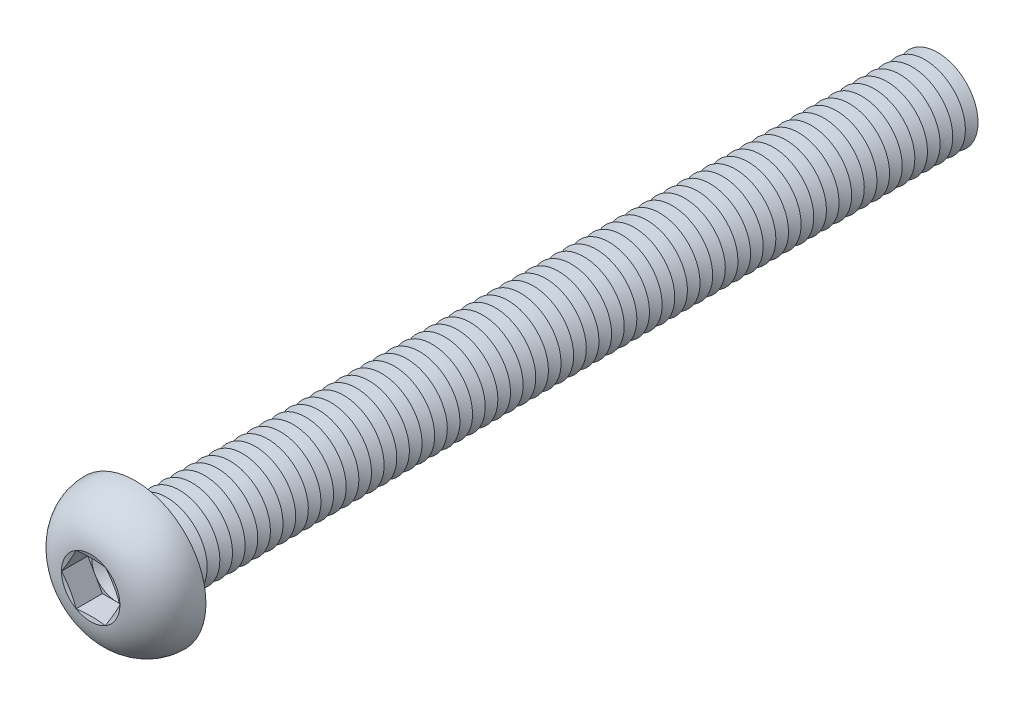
ISO-10303-21;
HEADER;
FILE_DESCRIPTION(('STEP AP214'),'2;1');
FILE_NAME('part.step','',(''),(''),'','','');
FILE_SCHEMA(('AUTOMOTIVE_DESIGN { 1 0 10303 214 1 1 1 1 }'));
ENDSEC;
DATA;
#1=APPLICATION_CONTEXT('core data for automotive mechanical design processes');
#2=APPLICATION_PROTOCOL_DEFINITION('international standard','automotive_design',2000,#1);
#3=PRODUCT_CONTEXT('',#1,'mechanical');
#4=PRODUCT('Part','Part','',(#3));
#5=PRODUCT_RELATED_PRODUCT_CATEGORY('part','',(#4));
#6=PRODUCT_DEFINITION_FORMATION('','',#4);
#7=PRODUCT_DEFINITION_CONTEXT('part definition',#1,'design');
#8=PRODUCT_DEFINITION('design','',#6,#7);
#9=PRODUCT_DEFINITION_SHAPE('','',#8);
#10=(LENGTH_UNIT() NAMED_UNIT(*) SI_UNIT(.MILLI.,.METRE.));
#11=(NAMED_UNIT(*) PLANE_ANGLE_UNIT() SI_UNIT($,.RADIAN.));
#12=(NAMED_UNIT(*) SI_UNIT($,.STERADIAN.) SOLID_ANGLE_UNIT());
#13=UNCERTAINTY_MEASURE_WITH_UNIT(LENGTH_MEASURE(1.E-05),#10,'distance_accuracy_value','');
#14=(GEOMETRIC_REPRESENTATION_CONTEXT(3) GLOBAL_UNCERTAINTY_ASSIGNED_CONTEXT((#13)) GLOBAL_UNIT_ASSIGNED_CONTEXT((#10,
#11,#12)) REPRESENTATION_CONTEXT('',''));
#15=CARTESIAN_POINT('',(0.,0.,0.));
#16=DIRECTION('',(0.,0.,1.));
#17=DIRECTION('',(1.,0.,0.));
#18=AXIS2_PLACEMENT_3D('',#15,#16,#17);
#19=CARTESIAN_POINT('',(0.,0.,1.8));
#20=DIRECTION('',(0.,0.,1.));
#21=DIRECTION('',(1.,0.,0.));
#22=AXIS2_PLACEMENT_3D('',#19,#20,#21);
#23=PLANE('',#22);
#24=CARTESIAN_POINT('',(0.,0.,1.8));
#25=DIRECTION('',(0.,0.,1.));
#26=DIRECTION('',(1.,0.,0.));
#27=AXIS2_PLACEMENT_3D('',#24,#25,#26);
#28=CIRCLE('',#27,2.49999883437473);
#29=CARTESIAN_POINT('',(2.1650625,1.24999941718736,1.8));
#30=VERTEX_POINT('',#29);
#31=CARTESIAN_POINT('',(0.,2.49999883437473,1.8));
#32=VERTEX_POINT('',#31);
#33=EDGE_CURVE('E118',#30,#32,#28,.T.);
#34=ORIENTED_EDGE('',*,*,#33,.F.);
#35=DIRECTION('',(-0.5,0.866025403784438,0.));
#36=VECTOR('',#35,1.);
#37=CARTESIAN_POINT('',(2.88675,0.,1.8));
#38=LINE('',#37,#36);
#39=CARTESIAN_POINT('',(1.443375,2.49999883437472,1.8));
#40=VERTEX_POINT('',#39);
#41=EDGE_CURVE('E125',#30,#40,#38,.T.);
#42=ORIENTED_EDGE('',*,*,#41,.T.);
#43=DIRECTION('',(-1.,0.,0.));
#44=VECTOR('',#43,1.);
#45=CARTESIAN_POINT('',(1.443375,2.49999883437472,1.8));
#46=LINE('',#45,#44);
#47=EDGE_CURVE('E136',#40,#32,#46,.T.);
#48=ORIENTED_EDGE('',*,*,#47,.T.);
#49=EDGE_LOOP('',(#34,#42,#48));
#50=FACE_BOUND('',#49,.T.);
#51=ADVANCED_FACE('F39',(#50),#23,.T.);
#52=CARTESIAN_POINT('',(0.,0.,1.8));
#53=DIRECTION('',(0.,0.,1.));
#54=DIRECTION('',(1.,0.,0.));
#55=AXIS2_PLACEMENT_3D('',#52,#53,#54);
#56=CIRCLE('',#55,2.49999883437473);
#57=CARTESIAN_POINT('',(-2.1650625,1.24999941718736,1.8));
#58=VERTEX_POINT('',#57);
#59=EDGE_CURVE('E11',#32,#58,#56,.T.);
#60=ORIENTED_EDGE('',*,*,#59,.F.);
#61=CARTESIAN_POINT('',(-1.443375,2.49999883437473,1.8));
#62=VERTEX_POINT('',#61);
#63=EDGE_CURVE('E131',#32,#62,#46,.T.);
#64=ORIENTED_EDGE('',*,*,#63,.T.);
#65=DIRECTION('',(-0.5,-0.866025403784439,0.));
#66=VECTOR('',#65,1.);
#67=CARTESIAN_POINT('',(-1.443375,2.49999883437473,1.8));
#68=LINE('',#67,#66);
#69=EDGE_CURVE('E134',#62,#58,#68,.T.);
#70=ORIENTED_EDGE('',*,*,#69,.T.);
#71=EDGE_LOOP('',(#60,#64,#70));
#72=FACE_BOUND('',#71,.T.);
#73=ADVANCED_FACE('F130',(#72),#23,.T.);
#74=CARTESIAN_POINT('',(-2.1650625,-1.24999941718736,1.8));
#75=VERTEX_POINT('',#74);
#76=EDGE_CURVE('E49',#58,#75,#56,.T.);
#77=ORIENTED_EDGE('',*,*,#76,.F.);
#78=CARTESIAN_POINT('',(-2.88675,0.,1.8));
#79=VERTEX_POINT('',#78);
#80=EDGE_CURVE('E143',#58,#79,#68,.T.);
#81=ORIENTED_EDGE('',*,*,#80,.T.);
#82=DIRECTION('',(0.5,-0.866025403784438,0.));
#83=VECTOR('',#82,1.);
#84=CARTESIAN_POINT('',(-2.88675,0.,1.8));
#85=LINE('',#84,#83);
#86=EDGE_CURVE('E152',#79,#75,#85,.T.);
#87=ORIENTED_EDGE('',*,*,#86,.T.);
#88=EDGE_LOOP('',(#77,#81,#87));
#89=FACE_BOUND('',#88,.T.);
#90=ADVANCED_FACE('F778',(#89),#23,.T.);
#91=CARTESIAN_POINT('',(0.,-2.49999883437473,1.8));
#92=VERTEX_POINT('',#91);
#93=EDGE_CURVE('E763',#75,#92,#56,.T.);
#94=ORIENTED_EDGE('',*,*,#93,.F.);
#95=CARTESIAN_POINT('',(-1.443375,-2.49999883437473,1.8));
#96=VERTEX_POINT('',#95);
#97=EDGE_CURVE('E151',#75,#96,#85,.T.);
#98=ORIENTED_EDGE('',*,*,#97,.T.);
#99=DIRECTION('',(1.,0.,0.));
#100=VECTOR('',#99,1.);
#101=CARTESIAN_POINT('',(-1.443375,-2.49999883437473,1.8));
#102=LINE('',#101,#100);
#103=EDGE_CURVE('E157',#96,#92,#102,.T.);
#104=ORIENTED_EDGE('',*,*,#103,.T.);
#105=EDGE_LOOP('',(#94,#98,#104));
#106=FACE_BOUND('',#105,.T.);
#107=ADVANCED_FACE('F771',(#106),#23,.T.);
#108=CARTESIAN_POINT('',(2.1650625,-1.24999941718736,1.8));
#109=VERTEX_POINT('',#108);
#110=EDGE_CURVE('E56',#92,#109,#56,.T.);
#111=ORIENTED_EDGE('',*,*,#110,.F.);
#112=CARTESIAN_POINT('',(1.443375,-2.49999883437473,1.8));
#113=VERTEX_POINT('',#112);
#114=EDGE_CURVE('E156',#92,#113,#102,.T.);
#115=ORIENTED_EDGE('',*,*,#114,.T.);
#116=DIRECTION('',(0.5,0.866025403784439,0.));
#117=VECTOR('',#116,1.);
#118=CARTESIAN_POINT('',(1.443375,-2.49999883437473,1.8));
#119=LINE('',#118,#117);
#120=EDGE_CURVE('E162',#113,#109,#119,.T.);
#121=ORIENTED_EDGE('',*,*,#120,.T.);
#122=EDGE_LOOP('',(#111,#115,#121));
#123=FACE_BOUND('',#122,.T.);
#124=ADVANCED_FACE('F847',(#123),#23,.T.);
#125=CARTESIAN_POINT('',(0.,0.,4.4));
#126=DIRECTION('',(0.,0.,1.));
#127=DIRECTION('',(0.,-1.,0.));
#128=AXIS2_PLACEMENT_3D('',#125,#126,#127);
#129=CONICAL_SURFACE('',#128,2.88675,1.30899693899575);
#130=CARTESIAN_POINT('',(2.88686547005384,-0.000200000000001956,4.40003094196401));
#131=CARTESIAN_POINT('',(2.82691617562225,0.103635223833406,4.3839595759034));
#132=CARTESIAN_POINT('',(2.76685817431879,0.20765873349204,4.36936933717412));
#133=CARTESIAN_POINT('',(2.64653003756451,0.416073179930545,4.3437355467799));
#134=CARTESIAN_POINT('',(2.58625982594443,0.520464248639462,4.33269343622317));
#135=CARTESIAN_POINT('',(2.46587274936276,0.72898078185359,4.31480063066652));
#136=CARTESIAN_POINT('',(2.40575669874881,0.833104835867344,4.3079285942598));
#137=CARTESIAN_POINT('',(2.28544792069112,1.04148575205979,4.29871388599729));
#138=CARTESIAN_POINT('',(2.22525521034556,1.14574258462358,4.29637033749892));
#139=CARTESIAN_POINT('',(2.10486978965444,1.35425624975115,4.29637033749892));
#140=CARTESIAN_POINT('',(2.04467707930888,1.45851308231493,4.29871388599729));
#141=CARTESIAN_POINT('',(1.92436830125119,1.66689399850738,4.3079285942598));
#142=CARTESIAN_POINT('',(1.86425225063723,1.77101805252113,4.31480063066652));
#143=CARTESIAN_POINT('',(1.74386517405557,1.97953458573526,4.33269343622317));
#144=CARTESIAN_POINT('',(1.68359496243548,2.08392565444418,4.3437355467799));
#145=CARTESIAN_POINT('',(1.56326682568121,2.29234010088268,4.36936933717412));
#146=CARTESIAN_POINT('',(1.50320882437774,2.39636361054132,4.3839595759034));
#147=CARTESIAN_POINT('',(1.44325952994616,2.50019883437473,4.40003094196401));
#148=B_SPLINE_CURVE_WITH_KNOTS('',3,(#130,#131,#132,#133,#134,#135,#136,#137,#138,#139,#140,
#141,#142,#143,#144,#145,#146,#147),.UNSPECIFIED.,.F.,.F.,(4,2,2,2,2,2,2,2,4),(0.,
0.362931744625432,0.726010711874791,1.08721550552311,1.44835036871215,1.80948523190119,
2.17069002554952,2.53376899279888,2.89670073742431),.UNSPECIFIED.);
#149=CARTESIAN_POINT('',(2.88675,0.,4.4));
#150=VERTEX_POINT('',#149);
#151=CARTESIAN_POINT('',(1.443375,2.49999883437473,4.4));
#152=VERTEX_POINT('',#151);
#153=EDGE_CURVE('E221',#150,#152,#148,.T.);
#154=ORIENTED_EDGE('',*,*,#153,.F.);
#155=CARTESIAN_POINT('',(0.,0.,4.4));
#156=DIRECTION('',(0.,0.,-1.));
#157=DIRECTION('',(0.,1.,0.));
#158=AXIS2_PLACEMENT_3D('',#155,#156,#157);
#159=CIRCLE('',#158,2.88675);
#160=EDGE_CURVE('E749',#152,#150,#159,.T.);
#161=ORIENTED_EDGE('',*,*,#160,.F.);
#162=EDGE_LOOP('',(#154,#161));
#163=FACE_BOUND('',#162,.T.);
#164=ADVANCED_FACE('F851',(#163),#129,.F.);
#165=CARTESIAN_POINT('',(1.44325952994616,-2.50019883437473,4.40003094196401));
#166=CARTESIAN_POINT('',(1.50320882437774,-2.39636361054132,4.3839595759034));
#167=CARTESIAN_POINT('',(1.56326682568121,-2.29234010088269,4.36936933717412));
#168=CARTESIAN_POINT('',(1.68359496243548,-2.08392565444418,4.3437355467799));
#169=CARTESIAN_POINT('',(1.74386517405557,-1.97953458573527,4.33269343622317));
#170=CARTESIAN_POINT('',(1.86425225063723,-1.77101805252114,4.31480063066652));
#171=CARTESIAN_POINT('',(1.92436830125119,-1.66689399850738,4.3079285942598));
#172=CARTESIAN_POINT('',(2.04467707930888,-1.45851308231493,4.29871388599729));
#173=CARTESIAN_POINT('',(2.10486978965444,-1.35425624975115,4.29637033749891));
#174=CARTESIAN_POINT('',(2.22525521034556,-1.14574258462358,4.29637033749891));
#175=CARTESIAN_POINT('',(2.28544792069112,-1.0414857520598,4.29871388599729));
#176=CARTESIAN_POINT('',(2.40575669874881,-0.833104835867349,4.3079285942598));
#177=CARTESIAN_POINT('',(2.46587274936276,-0.728980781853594,4.31480063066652));
#178=CARTESIAN_POINT('',(2.58625982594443,-0.520464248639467,4.33269343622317));
#179=CARTESIAN_POINT('',(2.64653003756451,-0.41607317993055,4.3437355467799));
#180=CARTESIAN_POINT('',(2.76685817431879,-0.207658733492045,4.36936933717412));
#181=CARTESIAN_POINT('',(2.82691617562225,-0.103635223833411,4.3839595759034));
#182=CARTESIAN_POINT('',(2.88686547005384,0.000199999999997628,4.40003094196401));
#183=B_SPLINE_CURVE_WITH_KNOTS('',3,(#165,#166,#167,#168,#169,#170,#171,#172,#173,#174,#175,
#176,#177,#178,#179,#180,#181,#182),.UNSPECIFIED.,.F.,.F.,(4,2,2,2,2,2,2,2,4),(0.,
0.362931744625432,0.726010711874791,1.08721550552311,1.44835036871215,1.80948523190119,
2.17069002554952,2.53376899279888,2.89670073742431),.UNSPECIFIED.);
#184=CARTESIAN_POINT('',(1.443375,-2.49999883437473,4.4));
#185=VERTEX_POINT('',#184);
#186=EDGE_CURVE('E230',#185,#150,#183,.T.);
#187=ORIENTED_EDGE('',*,*,#186,.F.);
#188=EDGE_CURVE('E754',#150,#185,#159,.T.);
#189=ORIENTED_EDGE('',*,*,#188,.F.);
#190=EDGE_LOOP('',(#187,#189));
#191=FACE_BOUND('',#190,.T.);
#192=ADVANCED_FACE('F813',(#191),#129,.F.);
#193=CARTESIAN_POINT('',(-4.35611719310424,-2.49999883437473,4.97227902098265));
#194=CARTESIAN_POINT('',(-4.25066509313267,-2.49999883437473,4.94777440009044));
#195=CARTESIAN_POINT('',(-4.14516541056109,-2.49999883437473,4.92347459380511));
#196=CARTESIAN_POINT('',(-3.93405094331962,-2.49999883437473,4.87537247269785));
#197=CARTESIAN_POINT('',(-3.82843615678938,-2.49999883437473,4.85157016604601));
#198=CARTESIAN_POINT('',(-3.5113534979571,-2.49999883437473,4.78103338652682));
#199=CARTESIAN_POINT('',(-3.29968815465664,-2.49999883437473,4.73517861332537));
#200=CARTESIAN_POINT('',(-2.87365524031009,-2.49999883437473,4.6464558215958));
#201=CARTESIAN_POINT('',(-2.65928093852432,-2.49999883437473,4.60361983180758));
#202=CARTESIAN_POINT('',(-2.22952626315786,-2.49999883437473,4.52311285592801));
#203=CARTESIAN_POINT('',(-2.01414580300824,-2.49999883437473,4.48544232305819));
#204=CARTESIAN_POINT('',(-1.58798319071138,-2.49999883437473,4.41876559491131));
#205=CARTESIAN_POINT('',(-1.37723418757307,-2.49999883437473,4.38955265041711));
#206=CARTESIAN_POINT('',(-0.95453034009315,-2.49999883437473,4.34171384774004));
#207=CARTESIAN_POINT('',(-0.742575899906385,-2.49999883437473,4.32308463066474));
#208=CARTESIAN_POINT('',(-0.424544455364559,-2.49999883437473,4.3053914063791));
#209=CARTESIAN_POINT('',(-0.318745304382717,-2.49999883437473,4.30120018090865));
#210=CARTESIAN_POINT('',(-0.107062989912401,-2.49999883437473,4.29638997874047));
#211=CARTESIAN_POINT('',(-0.00117982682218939,-2.49999883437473,4.29577098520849));
#212=CARTESIAN_POINT('',(0.210552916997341,-2.49999883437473,4.29814378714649));
#213=CARTESIAN_POINT('',(0.316402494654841,-2.49999883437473,4.30113585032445));
#214=CARTESIAN_POINT('',(0.527944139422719,-2.49999883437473,4.31057322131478));
#215=CARTESIAN_POINT('',(0.63363620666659,-2.49999883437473,4.31701852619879));
#216=CARTESIAN_POINT('',(0.890304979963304,-2.49999883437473,4.33652018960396));
#217=CARTESIAN_POINT('',(1.0411561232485,-2.49999883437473,4.35122885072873));
#218=CARTESIAN_POINT('',(1.34222474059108,-2.49999883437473,4.38593609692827));
#219=CARTESIAN_POINT('',(1.49244223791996,-2.49999883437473,4.40593448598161));
#220=CARTESIAN_POINT('',(1.79273634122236,-2.49999883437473,4.45011321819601));
#221=CARTESIAN_POINT('',(1.94281100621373,-2.49999883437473,4.47430656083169));
#222=CARTESIAN_POINT('',(2.24242097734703,-2.49999883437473,4.52583552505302));
#223=CARTESIAN_POINT('',(2.39195625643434,-2.49999883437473,4.55317130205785));
#224=CARTESIAN_POINT('',(2.69364402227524,-2.49999883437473,4.61079781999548));
#225=CARTESIAN_POINT('',(2.8457870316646,-2.49999883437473,4.64113779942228));
#226=CARTESIAN_POINT('',(3.14969016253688,-2.49999883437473,4.70367638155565));
#227=CARTESIAN_POINT('',(3.30145027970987,-2.49999883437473,4.73587500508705));
#228=CARTESIAN_POINT('',(3.60383766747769,-2.49999883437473,4.80150275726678));
#229=CARTESIAN_POINT('',(3.75446660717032,-2.49999883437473,4.83492423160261));
#230=CARTESIAN_POINT('',(4.05546753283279,-2.49999883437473,4.90285814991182));
#231=CARTESIAN_POINT('',(4.2058395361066,-2.49999883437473,4.93737051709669));
#232=CARTESIAN_POINT('',(4.35611719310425,-2.49999883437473,4.97227902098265));
#233=B_SPLINE_CURVE_WITH_KNOTS('',3,(#193,#194,#195,#196,#197,#198,#199,#200,#201,#202,#203,
#204,#205,#206,#207,#208,#209,#210,#211,#212,#213,#214,#215,#216,#217,#218,#219,#220,#221,#222,
#223,#224,#225,#226,#227,#228,#229,#230,#231,#232),.UNSPECIFIED.,.F.,.F.,(4,2,2,2,2,2,2,2,2,2,2,
2,2,2,2,2,2,2,2,4),(0.,0.324785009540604,0.649575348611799,1.29928181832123,1.95507889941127,
2.61093348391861,3.24905289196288,3.88696967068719,4.204563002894,4.5221548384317,
4.83977022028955,5.15738533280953,5.61196030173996,6.06651842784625,6.52251118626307,
6.97852650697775,7.44392737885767,7.90933346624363,8.37220553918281,8.83504510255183),.UNSPECIFIED.);
#234=CARTESIAN_POINT('',(-1.443375,-2.49999883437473,4.4));
#235=VERTEX_POINT('',#234);
#236=EDGE_CURVE('E791',#235,#185,#233,.T.);
#237=ORIENTED_EDGE('',*,*,#236,.F.);
#238=EDGE_CURVE('E804',#185,#235,#159,.T.);
#239=ORIENTED_EDGE('',*,*,#238,.F.);
#240=EDGE_LOOP('',(#237,#239));
#241=FACE_BOUND('',#240,.T.);
#242=ADVANCED_FACE('F818',(#241),#129,.F.);
#243=CARTESIAN_POINT('',(-2.88686547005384,0.000199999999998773,4.40003094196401));
#244=CARTESIAN_POINT('',(-2.82691617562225,-0.10363522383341,4.3839595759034));
#245=CARTESIAN_POINT('',(-2.76685817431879,-0.207658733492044,4.36936933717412));
#246=CARTESIAN_POINT('',(-2.64653003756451,-0.416073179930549,4.3437355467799));
#247=CARTESIAN_POINT('',(-2.58625982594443,-0.520464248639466,4.33269343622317));
#248=CARTESIAN_POINT('',(-2.46587274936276,-0.728980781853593,4.31480063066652));
#249=CARTESIAN_POINT('',(-2.40575669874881,-0.833104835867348,4.3079285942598));
#250=CARTESIAN_POINT('',(-2.28544792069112,-1.0414857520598,4.29871388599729));
#251=CARTESIAN_POINT('',(-2.22525521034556,-1.14574258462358,4.29637033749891));
#252=CARTESIAN_POINT('',(-2.10486978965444,-1.35425624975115,4.29637033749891));
#253=CARTESIAN_POINT('',(-2.04467707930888,-1.45851308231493,4.29871388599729));
#254=CARTESIAN_POINT('',(-1.92436830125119,-1.66689399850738,4.3079285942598));
#255=CARTESIAN_POINT('',(-1.86425225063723,-1.77101805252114,4.31480063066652));
#256=CARTESIAN_POINT('',(-1.74386517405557,-1.97953458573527,4.33269343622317));
#257=CARTESIAN_POINT('',(-1.68359496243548,-2.08392565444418,4.3437355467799));
#258=CARTESIAN_POINT('',(-1.56326682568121,-2.29234010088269,4.36936933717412));
#259=CARTESIAN_POINT('',(-1.50320882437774,-2.39636361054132,4.3839595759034));
#260=CARTESIAN_POINT('',(-1.44325952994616,-2.50019883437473,4.40003094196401));
#261=B_SPLINE_CURVE_WITH_KNOTS('',3,(#243,#244,#245,#246,#247,#248,#249,#250,#251,#252,#253,
#254,#255,#256,#257,#258,#259,#260),.UNSPECIFIED.,.F.,.F.,(4,2,2,2,2,2,2,2,4),(0.,
0.362931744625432,0.726010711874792,1.08721550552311,1.44835036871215,1.8094852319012,
2.17069002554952,2.53376899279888,2.89670073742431),.UNSPECIFIED.);
#262=CARTESIAN_POINT('',(-2.88675,0.,4.4));
#263=VERTEX_POINT('',#262);
#264=EDGE_CURVE('E783',#263,#235,#261,.T.);
#265=ORIENTED_EDGE('',*,*,#264,.F.);
#266=EDGE_CURVE('E789',#235,#263,#159,.T.);
#267=ORIENTED_EDGE('',*,*,#266,.F.);
#268=EDGE_LOOP('',(#265,#267));
#269=FACE_BOUND('',#268,.T.);
#270=ADVANCED_FACE('F787',(#269),#129,.F.);
#271=CARTESIAN_POINT('',(-1.44325952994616,2.50019883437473,4.40003094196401));
#272=CARTESIAN_POINT('',(-1.50320882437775,2.39636361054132,4.3839595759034));
#273=CARTESIAN_POINT('',(-1.56326682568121,2.29234010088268,4.36936933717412));
#274=CARTESIAN_POINT('',(-1.68359496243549,2.08392565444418,4.3437355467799));
#275=CARTESIAN_POINT('',(-1.74386517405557,1.97953458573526,4.33269343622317));
#276=CARTESIAN_POINT('',(-1.86425225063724,1.77101805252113,4.31480063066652));
#277=CARTESIAN_POINT('',(-1.92436830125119,1.66689399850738,4.3079285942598));
#278=CARTESIAN_POINT('',(-2.04467707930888,1.45851308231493,4.29871388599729));
#279=CARTESIAN_POINT('',(-2.10486978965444,1.35425624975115,4.29637033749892));
#280=CARTESIAN_POINT('',(-2.22525521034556,1.14574258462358,4.29637033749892));
#281=CARTESIAN_POINT('',(-2.28544792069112,1.04148575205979,4.29871388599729));
#282=CARTESIAN_POINT('',(-2.40575669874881,0.833104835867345,4.3079285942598));
#283=CARTESIAN_POINT('',(-2.46587274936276,0.72898078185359,4.31480063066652));
#284=CARTESIAN_POINT('',(-2.58625982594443,0.520464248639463,4.33269343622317));
#285=CARTESIAN_POINT('',(-2.64653003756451,0.416073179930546,4.3437355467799));
#286=CARTESIAN_POINT('',(-2.76685817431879,0.20765873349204,4.36936933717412));
#287=CARTESIAN_POINT('',(-2.82691617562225,0.103635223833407,4.3839595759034));
#288=CARTESIAN_POINT('',(-2.88686547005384,-0.000200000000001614,4.40003094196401));
#289=B_SPLINE_CURVE_WITH_KNOTS('',3,(#271,#272,#273,#274,#275,#276,#277,#278,#279,#280,#281,
#282,#283,#284,#285,#286,#287,#288),.UNSPECIFIED.,.F.,.F.,(4,2,2,2,2,2,2,2,4),(0.,
0.362931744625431,0.726010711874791,1.08721550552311,1.44835036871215,1.80948523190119,
2.17069002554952,2.53376899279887,2.89670073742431),.UNSPECIFIED.);
#290=CARTESIAN_POINT('',(-1.443375,2.49999883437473,4.4));
#291=VERTEX_POINT('',#290);
#292=EDGE_CURVE('E195',#291,#263,#289,.T.);
#293=ORIENTED_EDGE('',*,*,#292,.F.);
#294=EDGE_CURVE('E794',#263,#291,#159,.T.);
#295=ORIENTED_EDGE('',*,*,#294,.F.);
#296=EDGE_LOOP('',(#293,#295));
#297=FACE_BOUND('',#296,.T.);
#298=ADVANCED_FACE('F795',(#297),#129,.F.);
#299=CARTESIAN_POINT('',(0.,0.,-75.625));
#300=DIRECTION('',(0.,0.,1.));
#301=DIRECTION('',(0.,-1.,0.));
#302=AXIS2_PLACEMENT_3D('',#299,#300,#301);
#303=CONICAL_SURFACE('',#302,3.99999999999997,1.0471975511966);
#304=CARTESIAN_POINT('',(0.,0.,-76.25));
#305=DIRECTION('',(0.,0.,1.));
#306=DIRECTION('',(0.,-1.,0.));
#307=AXIS2_PLACEMENT_3D('',#304,#305,#306);
#308=CIRCLE('',#307,2.91746824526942);
#309=CARTESIAN_POINT('',(0.,-2.91746824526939,-76.25));
#310=VERTEX_POINT('',#309);
#311=EDGE_CURVE('E720',#310,#310,#308,.T.);
#312=ORIENTED_EDGE('',*,*,#311,.T.);
#313=EDGE_LOOP('',(#312));
#314=FACE_BOUND('',#313,.T.);
#315=CARTESIAN_POINT('',(0.,0.,-75.625));
#316=DIRECTION('',(0.,0.,1.));
#317=DIRECTION('',(0.,-1.,0.));
#318=AXIS2_PLACEMENT_3D('',#315,#316,#317);
#319=CIRCLE('',#318,3.99999999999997);
#320=CARTESIAN_POINT('',(0.,-3.99999999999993,-75.625));
#321=VERTEX_POINT('',#320);
#322=EDGE_CURVE('E716',#321,#321,#319,.T.);
#323=ORIENTED_EDGE('',*,*,#322,.F.);
#324=EDGE_LOOP('',(#323));
#325=FACE_BOUND('',#324,.T.);
#326=ADVANCED_FACE('F881',(#314,#325),#303,.T.);
#327=CARTESIAN_POINT('',(0.,0.,-76.25));
#328=DIRECTION('',(0.,0.,-1.));
#329=DIRECTION('',(0.,1.,0.));
#330=AXIS2_PLACEMENT_3D('',#327,#328,#329);
#331=CONICAL_SURFACE('',#330,2.91746824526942,1.0471975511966);
#332=CARTESIAN_POINT('',(0.,0.,-76.875));
#333=DIRECTION('',(0.,0.,1.));
#334=DIRECTION('',(0.,-1.,0.));
#335=AXIS2_PLACEMENT_3D('',#332,#333,#334);
#336=CIRCLE('',#335,3.99999999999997);
#337=CARTESIAN_POINT('',(0.,-3.99999999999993,-76.875));
#338=VERTEX_POINT('',#337);
#339=EDGE_CURVE('E724',#338,#338,#336,.T.);
#340=ORIENTED_EDGE('',*,*,#339,.T.);
#341=EDGE_LOOP('',(#340));
#342=FACE_BOUND('',#341,.T.);
#343=ORIENTED_EDGE('',*,*,#311,.F.);
#344=EDGE_LOOP('',(#343));
#345=FACE_BOUND('',#344,.T.);
#346=ADVANCED_FACE('F886',(#342,#345),#331,.T.);
#347=CARTESIAN_POINT('',(0.,3.99999999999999,-80.));
#348=DIRECTION('',(0.,0.,-1.));
#349=DIRECTION('',(0.,1.,0.));
#350=AXIS2_PLACEMENT_3D('',#347,#348,#349);
#351=PLANE('',#350);
#352=CARTESIAN_POINT('',(0.,0.,-80.));
#353=DIRECTION('',(0.,0.,1.));
#354=DIRECTION('',(0.,-1.,0.));
#355=AXIS2_PLACEMENT_3D('',#352,#353,#354);
#356=CIRCLE('',#355,2.91746824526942);
#357=CARTESIAN_POINT('',(0.,-2.91746824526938,-80.));
#358=VERTEX_POINT('',#357);
#359=EDGE_CURVE('E744',#358,#358,#356,.T.);
#360=ORIENTED_EDGE('',*,*,#359,.F.);
#361=EDGE_LOOP('',(#360));
#362=FACE_BOUND('',#361,.T.);
#363=ADVANCED_FACE('F1053',(#362),#351,.T.);
#364=CARTESIAN_POINT('',(0.,0.,-79.375));
#365=DIRECTION('',(0.,0.,1.));
#366=DIRECTION('',(0.,-1.,0.));
#367=AXIS2_PLACEMENT_3D('',#364,#365,#366);
#368=CONICAL_SURFACE('',#367,3.99999999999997,1.0471975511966);
#369=ORIENTED_EDGE('',*,*,#359,.T.);
#370=EDGE_LOOP('',(#369));
#371=FACE_BOUND('',#370,.T.);
#372=CARTESIAN_POINT('',(0.,0.,-79.375));
#373=DIRECTION('',(0.,0.,1.));
#374=DIRECTION('',(0.,-1.,0.));
#375=AXIS2_PLACEMENT_3D('',#372,#373,#374);
#376=CIRCLE('',#375,3.99999999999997);
#377=CARTESIAN_POINT('',(0.,-3.99999999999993,-79.375));
#378=VERTEX_POINT('',#377);
#379=EDGE_CURVE('E740',#378,#378,#376,.T.);
#380=ORIENTED_EDGE('',*,*,#379,.F.);
#381=EDGE_LOOP('',(#380));
#382=FACE_BOUND('',#381,.T.);
#383=ADVANCED_FACE('F1046',(#371,#382),#368,.T.);
#384=CARTESIAN_POINT('',(0.,0.,-78.75));
#385=DIRECTION('',(0.,0.,-1.));
#386=DIRECTION('',(0.,1.,0.));
#387=AXIS2_PLACEMENT_3D('',#384,#385,#386);
#388=CONICAL_SURFACE('',#387,2.91746824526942,1.0471975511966);
#389=ORIENTED_EDGE('',*,*,#379,.T.);
#390=EDGE_LOOP('',(#389));
#391=FACE_BOUND('',#390,.T.);
#392=CARTESIAN_POINT('',(0.,0.,-78.75));
#393=DIRECTION('',(0.,0.,1.));
#394=DIRECTION('',(0.,-1.,0.));
#395=AXIS2_PLACEMENT_3D('',#392,#393,#394);
#396=CIRCLE('',#395,2.91746824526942);
#397=CARTESIAN_POINT('',(0.,-2.91746824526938,-78.75));
#398=VERTEX_POINT('',#397);
#399=EDGE_CURVE('E736',#398,#398,#396,.T.);
#400=ORIENTED_EDGE('',*,*,#399,.F.);
#401=EDGE_LOOP('',(#400));
#402=FACE_BOUND('',#401,.T.);
#403=ADVANCED_FACE('F1052',(#391,#402),#388,.T.);
#404=CARTESIAN_POINT('',(0.,0.,-78.125));
#405=DIRECTION('',(0.,0.,1.));
#406=DIRECTION('',(0.,-1.,0.));
#407=AXIS2_PLACEMENT_3D('',#404,#405,#406);
#408=CONICAL_SURFACE('',#407,3.99999999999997,1.0471975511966);
#409=ORIENTED_EDGE('',*,*,#399,.T.);
#410=EDGE_LOOP('',(#409));
#411=FACE_BOUND('',#410,.T.);
#412=CARTESIAN_POINT('',(0.,0.,-78.125));
#413=DIRECTION('',(0.,0.,1.));
#414=DIRECTION('',(0.,-1.,0.));
#415=AXIS2_PLACEMENT_3D('',#412,#413,#414);
#416=CIRCLE('',#415,3.99999999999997);
#417=CARTESIAN_POINT('',(0.,-3.99999999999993,-78.125));
#418=VERTEX_POINT('',#417);
#419=EDGE_CURVE('E732',#418,#418,#416,.T.);
#420=ORIENTED_EDGE('',*,*,#419,.F.);
#421=EDGE_LOOP('',(#420));
#422=FACE_BOUND('',#421,.T.);
#423=ADVANCED_FACE('F1084',(#411,#422),#408,.T.);
#424=CARTESIAN_POINT('',(0.,0.,-77.5));
#425=DIRECTION('',(0.,0.,-1.));
#426=DIRECTION('',(0.,1.,0.));
#427=AXIS2_PLACEMENT_3D('',#424,#425,#426);
#428=CONICAL_SURFACE('',#427,2.91746824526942,1.0471975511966);
#429=ORIENTED_EDGE('',*,*,#419,.T.);
#430=EDGE_LOOP('',(#429));
#431=FACE_BOUND('',#430,.T.);
#432=CARTESIAN_POINT('',(0.,0.,-77.5));
#433=DIRECTION('',(0.,0.,1.));
#434=DIRECTION('',(0.,-1.,0.));
#435=AXIS2_PLACEMENT_3D('',#432,#433,#434);
#436=CIRCLE('',#435,2.91746824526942);
#437=CARTESIAN_POINT('',(0.,-2.91746824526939,-77.5));
#438=VERTEX_POINT('',#437);
#439=EDGE_CURVE('E728',#438,#438,#436,.T.);
#440=ORIENTED_EDGE('',*,*,#439,.F.);
#441=EDGE_LOOP('',(#440));
#442=FACE_BOUND('',#441,.T.);
#443=ADVANCED_FACE('F1094',(#431,#442),#428,.T.);
#444=CARTESIAN_POINT('',(0.,0.,-76.875));
#445=DIRECTION('',(0.,0.,1.));
#446=DIRECTION('',(0.,-1.,0.));
#447=AXIS2_PLACEMENT_3D('',#444,#445,#446);
#448=CONICAL_SURFACE('',#447,3.99999999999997,1.0471975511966);
#449=ORIENTED_EDGE('',*,*,#439,.T.);
#450=EDGE_LOOP('',(#449));
#451=FACE_BOUND('',#450,.T.);
#452=ORIENTED_EDGE('',*,*,#339,.F.);
#453=EDGE_LOOP('',(#452));
#454=FACE_BOUND('',#453,.T.);
#455=ADVANCED_FACE('F1104',(#451,#454),#448,.T.);
#456=CARTESIAN_POINT('',(0.,0.,-74.375));
#457=DIRECTION('',(0.,0.,1.));
#458=DIRECTION('',(0.,-1.,0.));
#459=AXIS2_PLACEMENT_3D('',#456,#457,#458);
#460=CONICAL_SURFACE('',#459,3.99999999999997,1.0471975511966);
#461=CARTESIAN_POINT('',(0.,0.,-75.));
#462=DIRECTION('',(0.,0.,1.));
#463=DIRECTION('',(0.,-1.,0.));
#464=AXIS2_PLACEMENT_3D('',#461,#462,#463);
#465=CIRCLE('',#464,2.91746824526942);
#466=CARTESIAN_POINT('',(0.,-2.91746824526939,-75.));
#467=VERTEX_POINT('',#466);
#468=EDGE_CURVE('E712',#467,#467,#465,.T.);
#469=ORIENTED_EDGE('',*,*,#468,.T.);
#470=EDGE_LOOP('',(#469));
#471=FACE_BOUND('',#470,.T.);
#472=CARTESIAN_POINT('',(0.,0.,-74.375));
#473=DIRECTION('',(0.,0.,1.));
#474=DIRECTION('',(0.,-1.,0.));
#475=AXIS2_PLACEMENT_3D('',#472,#473,#474);
#476=CIRCLE('',#475,3.99999999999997);
#477=CARTESIAN_POINT('',(0.,-3.99999999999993,-74.375));
#478=VERTEX_POINT('',#477);
#479=EDGE_CURVE('E708',#478,#478,#476,.T.);
#480=ORIENTED_EDGE('',*,*,#479,.F.);
#481=EDGE_LOOP('',(#480));
#482=FACE_BOUND('',#481,.T.);
#483=ADVANCED_FACE('F1114',(#471,#482),#460,.T.);
#484=CARTESIAN_POINT('',(0.,0.,-75.));
#485=DIRECTION('',(0.,0.,-1.));
#486=DIRECTION('',(0.,1.,0.));
#487=AXIS2_PLACEMENT_3D('',#484,#485,#486);
#488=CONICAL_SURFACE('',#487,2.91746824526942,1.0471975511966);
#489=ORIENTED_EDGE('',*,*,#322,.T.);
#490=EDGE_LOOP('',(#489));
#491=FACE_BOUND('',#490,.T.);
#492=ORIENTED_EDGE('',*,*,#468,.F.);
#493=EDGE_LOOP('',(#492));
#494=FACE_BOUND('',#493,.T.);
#495=ADVANCED_FACE('F1124',(#491,#494),#488,.T.);
#496=CARTESIAN_POINT('',(0.,0.,-73.125));
#497=DIRECTION('',(0.,0.,1.));
#498=DIRECTION('',(0.,-1.,0.));
#499=AXIS2_PLACEMENT_3D('',#496,#497,#498);
#500=CONICAL_SURFACE('',#499,3.99999999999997,1.0471975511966);
#501=CARTESIAN_POINT('',(0.,0.,-73.75));
#502=DIRECTION('',(0.,0.,1.));
#503=DIRECTION('',(0.,-1.,0.));
#504=AXIS2_PLACEMENT_3D('',#501,#502,#503);
#505=CIRCLE('',#504,2.91746824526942);
#506=CARTESIAN_POINT('',(0.,-2.91746824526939,-73.75));
#507=VERTEX_POINT('',#506);
#508=EDGE_CURVE('E704',#507,#507,#505,.T.);
#509=ORIENTED_EDGE('',*,*,#508,.T.);
#510=EDGE_LOOP('',(#509));
#511=FACE_BOUND('',#510,.T.);
#512=CARTESIAN_POINT('',(0.,0.,-73.125));
#513=DIRECTION('',(0.,0.,1.));
#514=DIRECTION('',(0.,-1.,0.));
#515=AXIS2_PLACEMENT_3D('',#512,#513,#514);
#516=CIRCLE('',#515,3.99999999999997);
#517=CARTESIAN_POINT('',(0.,-3.99999999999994,-73.125));
#518=VERTEX_POINT('',#517);
#519=EDGE_CURVE('E700',#518,#518,#516,.T.);
#520=ORIENTED_EDGE('',*,*,#519,.F.);
#521=EDGE_LOOP('',(#520));
#522=FACE_BOUND('',#521,.T.);
#523=ADVANCED_FACE('F1134',(#511,#522),#500,.T.);
#524=CARTESIAN_POINT('',(0.,0.,-73.75));
#525=DIRECTION('',(0.,0.,-1.));
#526=DIRECTION('',(0.,1.,0.));
#527=AXIS2_PLACEMENT_3D('',#524,#525,#526);
#528=CONICAL_SURFACE('',#527,2.91746824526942,1.0471975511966);
#529=ORIENTED_EDGE('',*,*,#479,.T.);
#530=EDGE_LOOP('',(#529));
#531=FACE_BOUND('',#530,.T.);
#532=ORIENTED_EDGE('',*,*,#508,.F.);
#533=EDGE_LOOP('',(#532));
#534=FACE_BOUND('',#533,.T.);
#535=ADVANCED_FACE('F1144',(#531,#534),#528,.T.);
#536=CARTESIAN_POINT('',(0.,0.,-71.875));
#537=DIRECTION('',(0.,0.,1.));
#538=DIRECTION('',(0.,-1.,0.));
#539=AXIS2_PLACEMENT_3D('',#536,#537,#538);
#540=CONICAL_SURFACE('',#539,3.99999999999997,1.0471975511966);
#541=CARTESIAN_POINT('',(0.,0.,-72.5));
#542=DIRECTION('',(0.,0.,1.));
#543=DIRECTION('',(0.,-1.,0.));
#544=AXIS2_PLACEMENT_3D('',#541,#542,#543);
#545=CIRCLE('',#544,2.91746824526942);
#546=CARTESIAN_POINT('',(0.,-2.91746824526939,-72.5));
#547=VERTEX_POINT('',#546);
#548=EDGE_CURVE('E696',#547,#547,#545,.T.);
#549=ORIENTED_EDGE('',*,*,#548,.T.);
#550=EDGE_LOOP('',(#549));
#551=FACE_BOUND('',#550,.T.);
#552=CARTESIAN_POINT('',(0.,0.,-71.875));
#553=DIRECTION('',(0.,0.,1.));
#554=DIRECTION('',(0.,-1.,0.));
#555=AXIS2_PLACEMENT_3D('',#552,#553,#554);
#556=CIRCLE('',#555,3.99999999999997);
#557=CARTESIAN_POINT('',(0.,-3.99999999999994,-71.875));
#558=VERTEX_POINT('',#557);
#559=EDGE_CURVE('E692',#558,#558,#556,.T.);
#560=ORIENTED_EDGE('',*,*,#559,.F.);
#561=EDGE_LOOP('',(#560));
#562=FACE_BOUND('',#561,.T.);
#563=ADVANCED_FACE('F1154',(#551,#562),#540,.T.);
#564=CARTESIAN_POINT('',(0.,0.,-72.5));
#565=DIRECTION('',(0.,0.,-1.));
#566=DIRECTION('',(0.,1.,0.));
#567=AXIS2_PLACEMENT_3D('',#564,#565,#566);
#568=CONICAL_SURFACE('',#567,2.91746824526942,1.0471975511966);
#569=ORIENTED_EDGE('',*,*,#519,.T.);
#570=EDGE_LOOP('',(#569));
#571=FACE_BOUND('',#570,.T.);
#572=ORIENTED_EDGE('',*,*,#548,.F.);
#573=EDGE_LOOP('',(#572));
#574=FACE_BOUND('',#573,.T.);
#575=ADVANCED_FACE('F1164',(#571,#574),#568,.T.);
#576=CARTESIAN_POINT('',(0.,0.,-70.625));
#577=DIRECTION('',(0.,0.,1.));
#578=DIRECTION('',(0.,-1.,0.));
#579=AXIS2_PLACEMENT_3D('',#576,#577,#578);
#580=CONICAL_SURFACE('',#579,3.99999999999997,1.0471975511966);
#581=CARTESIAN_POINT('',(0.,0.,-71.25));
#582=DIRECTION('',(0.,0.,1.));
#583=DIRECTION('',(0.,-1.,0.));
#584=AXIS2_PLACEMENT_3D('',#581,#582,#583);
#585=CIRCLE('',#584,2.91746824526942);
#586=CARTESIAN_POINT('',(0.,-2.91746824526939,-71.25));
#587=VERTEX_POINT('',#586);
#588=EDGE_CURVE('E688',#587,#587,#585,.T.);
#589=ORIENTED_EDGE('',*,*,#588,.T.);
#590=EDGE_LOOP('',(#589));
#591=FACE_BOUND('',#590,.T.);
#592=CARTESIAN_POINT('',(0.,0.,-70.625));
#593=DIRECTION('',(0.,0.,1.));
#594=DIRECTION('',(0.,-1.,0.));
#595=AXIS2_PLACEMENT_3D('',#592,#593,#594);
#596=CIRCLE('',#595,3.99999999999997);
#597=CARTESIAN_POINT('',(0.,-3.99999999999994,-70.625));
#598=VERTEX_POINT('',#597);
#599=EDGE_CURVE('E684',#598,#598,#596,.T.);
#600=ORIENTED_EDGE('',*,*,#599,.F.);
#601=EDGE_LOOP('',(#600));
#602=FACE_BOUND('',#601,.T.);
#603=ADVANCED_FACE('F1174',(#591,#602),#580,.T.);
#604=CARTESIAN_POINT('',(0.,0.,-71.25));
#605=DIRECTION('',(0.,0.,-1.));
#606=DIRECTION('',(0.,1.,0.));
#607=AXIS2_PLACEMENT_3D('',#604,#605,#606);
#608=CONICAL_SURFACE('',#607,2.91746824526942,1.0471975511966);
#609=ORIENTED_EDGE('',*,*,#559,.T.);
#610=EDGE_LOOP('',(#609));
#611=FACE_BOUND('',#610,.T.);
#612=ORIENTED_EDGE('',*,*,#588,.F.);
#613=EDGE_LOOP('',(#612));
#614=FACE_BOUND('',#613,.T.);
#615=ADVANCED_FACE('F1184',(#611,#614),#608,.T.);
#616=CARTESIAN_POINT('',(0.,0.,-69.375));
#617=DIRECTION('',(0.,0.,1.));
#618=DIRECTION('',(0.,-1.,0.));
#619=AXIS2_PLACEMENT_3D('',#616,#617,#618);
#620=CONICAL_SURFACE('',#619,3.99999999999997,1.0471975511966);
#621=CARTESIAN_POINT('',(0.,0.,-70.));
#622=DIRECTION('',(0.,0.,1.));
#623=DIRECTION('',(0.,-1.,0.));
#624=AXIS2_PLACEMENT_3D('',#621,#622,#623);
#625=CIRCLE('',#624,2.91746824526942);
#626=CARTESIAN_POINT('',(0.,-2.91746824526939,-70.));
#627=VERTEX_POINT('',#626);
#628=EDGE_CURVE('E680',#627,#627,#625,.T.);
#629=ORIENTED_EDGE('',*,*,#628,.T.);
#630=EDGE_LOOP('',(#629));
#631=FACE_BOUND('',#630,.T.);
#632=CARTESIAN_POINT('',(0.,0.,-69.375));
#633=DIRECTION('',(0.,0.,1.));
#634=DIRECTION('',(0.,-1.,0.));
#635=AXIS2_PLACEMENT_3D('',#632,#633,#634);
#636=CIRCLE('',#635,3.99999999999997);
#637=CARTESIAN_POINT('',(0.,-3.99999999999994,-69.375));
#638=VERTEX_POINT('',#637);
#639=EDGE_CURVE('E676',#638,#638,#636,.T.);
#640=ORIENTED_EDGE('',*,*,#639,.F.);
#641=EDGE_LOOP('',(#640));
#642=FACE_BOUND('',#641,.T.);
#643=ADVANCED_FACE('F1194',(#631,#642),#620,.T.);
#644=CARTESIAN_POINT('',(0.,0.,-70.));
#645=DIRECTION('',(0.,0.,-1.));
#646=DIRECTION('',(0.,1.,0.));
#647=AXIS2_PLACEMENT_3D('',#644,#645,#646);
#648=CONICAL_SURFACE('',#647,2.91746824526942,1.0471975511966);
#649=ORIENTED_EDGE('',*,*,#599,.T.);
#650=EDGE_LOOP('',(#649));
#651=FACE_BOUND('',#650,.T.);
#652=ORIENTED_EDGE('',*,*,#628,.F.);
#653=EDGE_LOOP('',(#652));
#654=FACE_BOUND('',#653,.T.);
#655=ADVANCED_FACE('F1204',(#651,#654),#648,.T.);
#656=CARTESIAN_POINT('',(0.,0.,-68.125));
#657=DIRECTION('',(0.,0.,1.));
#658=DIRECTION('',(0.,-1.,0.));
#659=AXIS2_PLACEMENT_3D('',#656,#657,#658);
#660=CONICAL_SURFACE('',#659,3.99999999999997,1.0471975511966);
#661=CARTESIAN_POINT('',(0.,0.,-68.75));
#662=DIRECTION('',(0.,0.,1.));
#663=DIRECTION('',(0.,-1.,0.));
#664=AXIS2_PLACEMENT_3D('',#661,#662,#663);
#665=CIRCLE('',#664,2.91746824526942);
#666=CARTESIAN_POINT('',(0.,-2.91746824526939,-68.75));
#667=VERTEX_POINT('',#666);
#668=EDGE_CURVE('E672',#667,#667,#665,.T.);
#669=ORIENTED_EDGE('',*,*,#668,.T.);
#670=EDGE_LOOP('',(#669));
#671=FACE_BOUND('',#670,.T.);
#672=CARTESIAN_POINT('',(0.,0.,-68.125));
#673=DIRECTION('',(0.,0.,1.));
#674=DIRECTION('',(0.,-1.,0.));
#675=AXIS2_PLACEMENT_3D('',#672,#673,#674);
#676=CIRCLE('',#675,3.99999999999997);
#677=CARTESIAN_POINT('',(0.,-3.99999999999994,-68.125));
#678=VERTEX_POINT('',#677);
#679=EDGE_CURVE('E668',#678,#678,#676,.T.);
#680=ORIENTED_EDGE('',*,*,#679,.F.);
#681=EDGE_LOOP('',(#680));
#682=FACE_BOUND('',#681,.T.);
#683=ADVANCED_FACE('F1214',(#671,#682),#660,.T.);
#684=CARTESIAN_POINT('',(0.,0.,-68.75));
#685=DIRECTION('',(0.,0.,-1.));
#686=DIRECTION('',(0.,1.,0.));
#687=AXIS2_PLACEMENT_3D('',#684,#685,#686);
#688=CONICAL_SURFACE('',#687,2.91746824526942,1.0471975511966);
#689=ORIENTED_EDGE('',*,*,#639,.T.);
#690=EDGE_LOOP('',(#689));
#691=FACE_BOUND('',#690,.T.);
#692=ORIENTED_EDGE('',*,*,#668,.F.);
#693=EDGE_LOOP('',(#692));
#694=FACE_BOUND('',#693,.T.);
#695=ADVANCED_FACE('F1224',(#691,#694),#688,.T.);
#696=CARTESIAN_POINT('',(0.,0.,-66.875));
#697=DIRECTION('',(0.,0.,1.));
#698=DIRECTION('',(0.,-1.,0.));
#699=AXIS2_PLACEMENT_3D('',#696,#697,#698);
#700=CONICAL_SURFACE('',#699,3.99999999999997,1.0471975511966);
#701=CARTESIAN_POINT('',(0.,0.,-67.5));
#702=DIRECTION('',(0.,0.,1.));
#703=DIRECTION('',(0.,-1.,0.));
#704=AXIS2_PLACEMENT_3D('',#701,#702,#703);
#705=CIRCLE('',#704,2.91746824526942);
#706=CARTESIAN_POINT('',(0.,-2.91746824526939,-67.5));
#707=VERTEX_POINT('',#706);
#708=EDGE_CURVE('E664',#707,#707,#705,.T.);
#709=ORIENTED_EDGE('',*,*,#708,.T.);
#710=EDGE_LOOP('',(#709));
#711=FACE_BOUND('',#710,.T.);
#712=CARTESIAN_POINT('',(0.,0.,-66.875));
#713=DIRECTION('',(0.,0.,1.));
#714=DIRECTION('',(0.,-1.,0.));
#715=AXIS2_PLACEMENT_3D('',#712,#713,#714);
#716=CIRCLE('',#715,3.99999999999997);
#717=CARTESIAN_POINT('',(0.,-3.99999999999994,-66.875));
#718=VERTEX_POINT('',#717);
#719=EDGE_CURVE('E660',#718,#718,#716,.T.);
#720=ORIENTED_EDGE('',*,*,#719,.F.);
#721=EDGE_LOOP('',(#720));
#722=FACE_BOUND('',#721,.T.);
#723=ADVANCED_FACE('F1234',(#711,#722),#700,.T.);
#724=CARTESIAN_POINT('',(0.,0.,-67.5));
#725=DIRECTION('',(0.,0.,-1.));
#726=DIRECTION('',(0.,1.,0.));
#727=AXIS2_PLACEMENT_3D('',#724,#725,#726);
#728=CONICAL_SURFACE('',#727,2.91746824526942,1.0471975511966);
#729=ORIENTED_EDGE('',*,*,#679,.T.);
#730=EDGE_LOOP('',(#729));
#731=FACE_BOUND('',#730,.T.);
#732=ORIENTED_EDGE('',*,*,#708,.F.);
#733=EDGE_LOOP('',(#732));
#734=FACE_BOUND('',#733,.T.);
#735=ADVANCED_FACE('F1244',(#731,#734),#728,.T.);
#736=CARTESIAN_POINT('',(0.,0.,-65.625));
#737=DIRECTION('',(0.,0.,1.));
#738=DIRECTION('',(0.,-1.,0.));
#739=AXIS2_PLACEMENT_3D('',#736,#737,#738);
#740=CONICAL_SURFACE('',#739,3.99999999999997,1.0471975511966);
#741=CARTESIAN_POINT('',(0.,0.,-66.25));
#742=DIRECTION('',(0.,0.,1.));
#743=DIRECTION('',(0.,-1.,0.));
#744=AXIS2_PLACEMENT_3D('',#741,#742,#743);
#745=CIRCLE('',#744,2.91746824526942);
#746=CARTESIAN_POINT('',(0.,-2.91746824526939,-66.25));
#747=VERTEX_POINT('',#746);
#748=EDGE_CURVE('E656',#747,#747,#745,.T.);
#749=ORIENTED_EDGE('',*,*,#748,.T.);
#750=EDGE_LOOP('',(#749));
#751=FACE_BOUND('',#750,.T.);
#752=CARTESIAN_POINT('',(0.,0.,-65.625));
#753=DIRECTION('',(0.,0.,1.));
#754=DIRECTION('',(0.,-1.,0.));
#755=AXIS2_PLACEMENT_3D('',#752,#753,#754);
#756=CIRCLE('',#755,3.99999999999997);
#757=CARTESIAN_POINT('',(0.,-3.99999999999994,-65.625));
#758=VERTEX_POINT('',#757);
#759=EDGE_CURVE('E652',#758,#758,#756,.T.);
#760=ORIENTED_EDGE('',*,*,#759,.F.);
#761=EDGE_LOOP('',(#760));
#762=FACE_BOUND('',#761,.T.);
#763=ADVANCED_FACE('F1254',(#751,#762),#740,.T.);
#764=CARTESIAN_POINT('',(0.,0.,-66.25));
#765=DIRECTION('',(0.,0.,-1.));
#766=DIRECTION('',(0.,1.,0.));
#767=AXIS2_PLACEMENT_3D('',#764,#765,#766);
#768=CONICAL_SURFACE('',#767,2.91746824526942,1.0471975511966);
#769=ORIENTED_EDGE('',*,*,#719,.T.);
#770=EDGE_LOOP('',(#769));
#771=FACE_BOUND('',#770,.T.);
#772=ORIENTED_EDGE('',*,*,#748,.F.);
#773=EDGE_LOOP('',(#772));
#774=FACE_BOUND('',#773,.T.);
#775=ADVANCED_FACE('F1264',(#771,#774),#768,.T.);
#776=CARTESIAN_POINT('',(0.,0.,-64.375));
#777=DIRECTION('',(0.,0.,1.));
#778=DIRECTION('',(0.,-1.,0.));
#779=AXIS2_PLACEMENT_3D('',#776,#777,#778);
#780=CONICAL_SURFACE('',#779,3.99999999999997,1.0471975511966);
#781=CARTESIAN_POINT('',(0.,0.,-65.));
#782=DIRECTION('',(0.,0.,1.));
#783=DIRECTION('',(0.,-1.,0.));
#784=AXIS2_PLACEMENT_3D('',#781,#782,#783);
#785=CIRCLE('',#784,2.91746824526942);
#786=CARTESIAN_POINT('',(0.,-2.91746824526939,-65.));
#787=VERTEX_POINT('',#786);
#788=EDGE_CURVE('E648',#787,#787,#785,.T.);
#789=ORIENTED_EDGE('',*,*,#788,.T.);
#790=EDGE_LOOP('',(#789));
#791=FACE_BOUND('',#790,.T.);
#792=CARTESIAN_POINT('',(0.,0.,-64.375));
#793=DIRECTION('',(0.,0.,1.));
#794=DIRECTION('',(0.,-1.,0.));
#795=AXIS2_PLACEMENT_3D('',#792,#793,#794);
#796=CIRCLE('',#795,3.99999999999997);
#797=CARTESIAN_POINT('',(0.,-3.99999999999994,-64.375));
#798=VERTEX_POINT('',#797);
#799=EDGE_CURVE('E644',#798,#798,#796,.T.);
#800=ORIENTED_EDGE('',*,*,#799,.F.);
#801=EDGE_LOOP('',(#800));
#802=FACE_BOUND('',#801,.T.);
#803=ADVANCED_FACE('F1274',(#791,#802),#780,.T.);
#804=CARTESIAN_POINT('',(0.,0.,-65.));
#805=DIRECTION('',(0.,0.,-1.));
#806=DIRECTION('',(0.,1.,0.));
#807=AXIS2_PLACEMENT_3D('',#804,#805,#806);
#808=CONICAL_SURFACE('',#807,2.91746824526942,1.0471975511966);
#809=ORIENTED_EDGE('',*,*,#759,.T.);
#810=EDGE_LOOP('',(#809));
#811=FACE_BOUND('',#810,.T.);
#812=ORIENTED_EDGE('',*,*,#788,.F.);
#813=EDGE_LOOP('',(#812));
#814=FACE_BOUND('',#813,.T.);
#815=ADVANCED_FACE('F1284',(#811,#814),#808,.T.);
#816=CARTESIAN_POINT('',(0.,0.,-63.125));
#817=DIRECTION('',(0.,0.,1.));
#818=DIRECTION('',(0.,-1.,0.));
#819=AXIS2_PLACEMENT_3D('',#816,#817,#818);
#820=CONICAL_SURFACE('',#819,3.99999999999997,1.0471975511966);
#821=CARTESIAN_POINT('',(0.,0.,-63.75));
#822=DIRECTION('',(0.,0.,1.));
#823=DIRECTION('',(0.,-1.,0.));
#824=AXIS2_PLACEMENT_3D('',#821,#822,#823);
#825=CIRCLE('',#824,2.91746824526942);
#826=CARTESIAN_POINT('',(0.,-2.91746824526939,-63.75));
#827=VERTEX_POINT('',#826);
#828=EDGE_CURVE('E640',#827,#827,#825,.T.);
#829=ORIENTED_EDGE('',*,*,#828,.T.);
#830=EDGE_LOOP('',(#829));
#831=FACE_BOUND('',#830,.T.);
#832=CARTESIAN_POINT('',(0.,0.,-63.125));
#833=DIRECTION('',(0.,0.,1.));
#834=DIRECTION('',(0.,-1.,0.));
#835=AXIS2_PLACEMENT_3D('',#832,#833,#834);
#836=CIRCLE('',#835,3.99999999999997);
#837=CARTESIAN_POINT('',(0.,-3.99999999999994,-63.125));
#838=VERTEX_POINT('',#837);
#839=EDGE_CURVE('E636',#838,#838,#836,.T.);
#840=ORIENTED_EDGE('',*,*,#839,.F.);
#841=EDGE_LOOP('',(#840));
#842=FACE_BOUND('',#841,.T.);
#843=ADVANCED_FACE('F1294',(#831,#842),#820,.T.);
#844=CARTESIAN_POINT('',(0.,0.,-63.75));
#845=DIRECTION('',(0.,0.,-1.));
#846=DIRECTION('',(0.,1.,0.));
#847=AXIS2_PLACEMENT_3D('',#844,#845,#846);
#848=CONICAL_SURFACE('',#847,2.91746824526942,1.0471975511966);
#849=ORIENTED_EDGE('',*,*,#799,.T.);
#850=EDGE_LOOP('',(#849));
#851=FACE_BOUND('',#850,.T.);
#852=ORIENTED_EDGE('',*,*,#828,.F.);
#853=EDGE_LOOP('',(#852));
#854=FACE_BOUND('',#853,.T.);
#855=ADVANCED_FACE('F1304',(#851,#854),#848,.T.);
#856=CARTESIAN_POINT('',(0.,0.,-61.875));
#857=DIRECTION('',(0.,0.,1.));
#858=DIRECTION('',(0.,-1.,0.));
#859=AXIS2_PLACEMENT_3D('',#856,#857,#858);
#860=CONICAL_SURFACE('',#859,3.99999999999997,1.0471975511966);
#861=CARTESIAN_POINT('',(0.,0.,-62.5));
#862=DIRECTION('',(0.,0.,1.));
#863=DIRECTION('',(0.,-1.,0.));
#864=AXIS2_PLACEMENT_3D('',#861,#862,#863);
#865=CIRCLE('',#864,2.91746824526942);
#866=CARTESIAN_POINT('',(0.,-2.91746824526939,-62.5));
#867=VERTEX_POINT('',#866);
#868=EDGE_CURVE('E632',#867,#867,#865,.T.);
#869=ORIENTED_EDGE('',*,*,#868,.T.);
#870=EDGE_LOOP('',(#869));
#871=FACE_BOUND('',#870,.T.);
#872=CARTESIAN_POINT('',(0.,0.,-61.875));
#873=DIRECTION('',(0.,0.,1.));
#874=DIRECTION('',(0.,-1.,0.));
#875=AXIS2_PLACEMENT_3D('',#872,#873,#874);
#876=CIRCLE('',#875,3.99999999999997);
#877=CARTESIAN_POINT('',(0.,-3.99999999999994,-61.875));
#878=VERTEX_POINT('',#877);
#879=EDGE_CURVE('E628',#878,#878,#876,.T.);
#880=ORIENTED_EDGE('',*,*,#879,.F.);
#881=EDGE_LOOP('',(#880));
#882=FACE_BOUND('',#881,.T.);
#883=ADVANCED_FACE('F1314',(#871,#882),#860,.T.);
#884=CARTESIAN_POINT('',(0.,0.,-62.5));
#885=DIRECTION('',(0.,0.,-1.));
#886=DIRECTION('',(0.,1.,0.));
#887=AXIS2_PLACEMENT_3D('',#884,#885,#886);
#888=CONICAL_SURFACE('',#887,2.91746824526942,1.0471975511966);
#889=ORIENTED_EDGE('',*,*,#839,.T.);
#890=EDGE_LOOP('',(#889));
#891=FACE_BOUND('',#890,.T.);
#892=ORIENTED_EDGE('',*,*,#868,.F.);
#893=EDGE_LOOP('',(#892));
#894=FACE_BOUND('',#893,.T.);
#895=ADVANCED_FACE('F1324',(#891,#894),#888,.T.);
#896=CARTESIAN_POINT('',(0.,0.,-60.625));
#897=DIRECTION('',(0.,0.,1.));
#898=DIRECTION('',(0.,-1.,0.));
#899=AXIS2_PLACEMENT_3D('',#896,#897,#898);
#900=CONICAL_SURFACE('',#899,3.99999999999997,1.0471975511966);
#901=CARTESIAN_POINT('',(0.,0.,-61.25));
#902=DIRECTION('',(0.,0.,1.));
#903=DIRECTION('',(0.,-1.,0.));
#904=AXIS2_PLACEMENT_3D('',#901,#902,#903);
#905=CIRCLE('',#904,2.91746824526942);
#906=CARTESIAN_POINT('',(0.,-2.91746824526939,-61.25));
#907=VERTEX_POINT('',#906);
#908=EDGE_CURVE('E624',#907,#907,#905,.T.);
#909=ORIENTED_EDGE('',*,*,#908,.T.);
#910=EDGE_LOOP('',(#909));
#911=FACE_BOUND('',#910,.T.);
#912=CARTESIAN_POINT('',(0.,0.,-60.625));
#913=DIRECTION('',(0.,0.,1.));
#914=DIRECTION('',(0.,-1.,0.));
#915=AXIS2_PLACEMENT_3D('',#912,#913,#914);
#916=CIRCLE('',#915,3.99999999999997);
#917=CARTESIAN_POINT('',(0.,-3.99999999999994,-60.625));
#918=VERTEX_POINT('',#917);
#919=EDGE_CURVE('E620',#918,#918,#916,.T.);
#920=ORIENTED_EDGE('',*,*,#919,.F.);
#921=EDGE_LOOP('',(#920));
#922=FACE_BOUND('',#921,.T.);
#923=ADVANCED_FACE('F1334',(#911,#922),#900,.T.);
#924=CARTESIAN_POINT('',(0.,0.,-61.25));
#925=DIRECTION('',(0.,0.,-1.));
#926=DIRECTION('',(0.,1.,0.));
#927=AXIS2_PLACEMENT_3D('',#924,#925,#926);
#928=CONICAL_SURFACE('',#927,2.91746824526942,1.0471975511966);
#929=ORIENTED_EDGE('',*,*,#879,.T.);
#930=EDGE_LOOP('',(#929));
#931=FACE_BOUND('',#930,.T.);
#932=ORIENTED_EDGE('',*,*,#908,.F.);
#933=EDGE_LOOP('',(#932));
#934=FACE_BOUND('',#933,.T.);
#935=ADVANCED_FACE('F1344',(#931,#934),#928,.T.);
#936=CARTESIAN_POINT('',(0.,0.,-59.375));
#937=DIRECTION('',(0.,0.,1.));
#938=DIRECTION('',(0.,-1.,0.));
#939=AXIS2_PLACEMENT_3D('',#936,#937,#938);
#940=CONICAL_SURFACE('',#939,3.99999999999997,1.0471975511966);
#941=CARTESIAN_POINT('',(0.,0.,-60.));
#942=DIRECTION('',(0.,0.,1.));
#943=DIRECTION('',(0.,-1.,0.));
#944=AXIS2_PLACEMENT_3D('',#941,#942,#943);
#945=CIRCLE('',#944,2.91746824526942);
#946=CARTESIAN_POINT('',(0.,-2.91746824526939,-60.));
#947=VERTEX_POINT('',#946);
#948=EDGE_CURVE('E616',#947,#947,#945,.T.);
#949=ORIENTED_EDGE('',*,*,#948,.T.);
#950=EDGE_LOOP('',(#949));
#951=FACE_BOUND('',#950,.T.);
#952=CARTESIAN_POINT('',(0.,0.,-59.375));
#953=DIRECTION('',(0.,0.,1.));
#954=DIRECTION('',(0.,-1.,0.));
#955=AXIS2_PLACEMENT_3D('',#952,#953,#954);
#956=CIRCLE('',#955,3.99999999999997);
#957=CARTESIAN_POINT('',(0.,-3.99999999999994,-59.375));
#958=VERTEX_POINT('',#957);
#959=EDGE_CURVE('E612',#958,#958,#956,.T.);
#960=ORIENTED_EDGE('',*,*,#959,.F.);
#961=EDGE_LOOP('',(#960));
#962=FACE_BOUND('',#961,.T.);
#963=ADVANCED_FACE('F1354',(#951,#962),#940,.T.);
#964=CARTESIAN_POINT('',(0.,0.,-60.));
#965=DIRECTION('',(0.,0.,-1.));
#966=DIRECTION('',(0.,1.,0.));
#967=AXIS2_PLACEMENT_3D('',#964,#965,#966);
#968=CONICAL_SURFACE('',#967,2.91746824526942,1.0471975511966);
#969=ORIENTED_EDGE('',*,*,#919,.T.);
#970=EDGE_LOOP('',(#969));
#971=FACE_BOUND('',#970,.T.);
#972=ORIENTED_EDGE('',*,*,#948,.F.);
#973=EDGE_LOOP('',(#972));
#974=FACE_BOUND('',#973,.T.);
#975=ADVANCED_FACE('F1364',(#971,#974),#968,.T.);
#976=CARTESIAN_POINT('',(0.,0.,-58.125));
#977=DIRECTION('',(0.,0.,1.));
#978=DIRECTION('',(0.,-1.,0.));
#979=AXIS2_PLACEMENT_3D('',#976,#977,#978);
#980=CONICAL_SURFACE('',#979,3.99999999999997,1.0471975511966);
#981=CARTESIAN_POINT('',(0.,0.,-58.75));
#982=DIRECTION('',(0.,0.,1.));
#983=DIRECTION('',(0.,-1.,0.));
#984=AXIS2_PLACEMENT_3D('',#981,#982,#983);
#985=CIRCLE('',#984,2.91746824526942);
#986=CARTESIAN_POINT('',(0.,-2.91746824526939,-58.75));
#987=VERTEX_POINT('',#986);
#988=EDGE_CURVE('E608',#987,#987,#985,.T.);
#989=ORIENTED_EDGE('',*,*,#988,.T.);
#990=EDGE_LOOP('',(#989));
#991=FACE_BOUND('',#990,.T.);
#992=CARTESIAN_POINT('',(0.,0.,-58.125));
#993=DIRECTION('',(0.,0.,1.));
#994=DIRECTION('',(0.,-1.,0.));
#995=AXIS2_PLACEMENT_3D('',#992,#993,#994);
#996=CIRCLE('',#995,3.99999999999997);
#997=CARTESIAN_POINT('',(0.,-3.99999999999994,-58.125));
#998=VERTEX_POINT('',#997);
#999=EDGE_CURVE('E604',#998,#998,#996,.T.);
#1000=ORIENTED_EDGE('',*,*,#999,.F.);
#1001=EDGE_LOOP('',(#1000));
#1002=FACE_BOUND('',#1001,.T.);
#1003=ADVANCED_FACE('F1374',(#991,#1002),#980,.T.);
#1004=CARTESIAN_POINT('',(0.,0.,-58.75));
#1005=DIRECTION('',(0.,0.,-1.));
#1006=DIRECTION('',(0.,1.,0.));
#1007=AXIS2_PLACEMENT_3D('',#1004,#1005,#1006);
#1008=CONICAL_SURFACE('',#1007,2.91746824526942,1.0471975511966);
#1009=ORIENTED_EDGE('',*,*,#959,.T.);
#1010=EDGE_LOOP('',(#1009));
#1011=FACE_BOUND('',#1010,.T.);
#1012=ORIENTED_EDGE('',*,*,#988,.F.);
#1013=EDGE_LOOP('',(#1012));
#1014=FACE_BOUND('',#1013,.T.);
#1015=ADVANCED_FACE('F1384',(#1011,#1014),#1008,.T.);
#1016=CARTESIAN_POINT('',(0.,0.,-56.875));
#1017=DIRECTION('',(0.,0.,1.));
#1018=DIRECTION('',(0.,-1.,0.));
#1019=AXIS2_PLACEMENT_3D('',#1016,#1017,#1018);
#1020=CONICAL_SURFACE('',#1019,3.99999999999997,1.0471975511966);
#1021=CARTESIAN_POINT('',(0.,0.,-57.5));
#1022=DIRECTION('',(0.,0.,1.));
#1023=DIRECTION('',(0.,-1.,0.));
#1024=AXIS2_PLACEMENT_3D('',#1021,#1022,#1023);
#1025=CIRCLE('',#1024,2.91746824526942);
#1026=CARTESIAN_POINT('',(0.,-2.91746824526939,-57.5));
#1027=VERTEX_POINT('',#1026);
#1028=EDGE_CURVE('E600',#1027,#1027,#1025,.T.);
#1029=ORIENTED_EDGE('',*,*,#1028,.T.);
#1030=EDGE_LOOP('',(#1029));
#1031=FACE_BOUND('',#1030,.T.);
#1032=CARTESIAN_POINT('',(0.,0.,-56.875));
#1033=DIRECTION('',(0.,0.,1.));
#1034=DIRECTION('',(0.,-1.,0.));
#1035=AXIS2_PLACEMENT_3D('',#1032,#1033,#1034);
#1036=CIRCLE('',#1035,3.99999999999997);
#1037=CARTESIAN_POINT('',(0.,-3.99999999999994,-56.875));
#1038=VERTEX_POINT('',#1037);
#1039=EDGE_CURVE('E596',#1038,#1038,#1036,.T.);
#1040=ORIENTED_EDGE('',*,*,#1039,.F.);
#1041=EDGE_LOOP('',(#1040));
#1042=FACE_BOUND('',#1041,.T.);
#1043=ADVANCED_FACE('F1394',(#1031,#1042),#1020,.T.);
#1044=CARTESIAN_POINT('',(0.,0.,-57.5));
#1045=DIRECTION('',(0.,0.,-1.));
#1046=DIRECTION('',(0.,1.,0.));
#1047=AXIS2_PLACEMENT_3D('',#1044,#1045,#1046);
#1048=CONICAL_SURFACE('',#1047,2.91746824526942,1.0471975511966);
#1049=ORIENTED_EDGE('',*,*,#999,.T.);
#1050=EDGE_LOOP('',(#1049));
#1051=FACE_BOUND('',#1050,.T.);
#1052=ORIENTED_EDGE('',*,*,#1028,.F.);
#1053=EDGE_LOOP('',(#1052));
#1054=FACE_BOUND('',#1053,.T.);
#1055=ADVANCED_FACE('F1404',(#1051,#1054),#1048,.T.);
#1056=CARTESIAN_POINT('',(0.,0.,-55.625));
#1057=DIRECTION('',(0.,0.,1.));
#1058=DIRECTION('',(0.,-1.,0.));
#1059=AXIS2_PLACEMENT_3D('',#1056,#1057,#1058);
#1060=CONICAL_SURFACE('',#1059,3.99999999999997,1.0471975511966);
#1061=CARTESIAN_POINT('',(0.,0.,-56.25));
#1062=DIRECTION('',(0.,0.,1.));
#1063=DIRECTION('',(0.,-1.,0.));
#1064=AXIS2_PLACEMENT_3D('',#1061,#1062,#1063);
#1065=CIRCLE('',#1064,2.91746824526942);
#1066=CARTESIAN_POINT('',(0.,-2.91746824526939,-56.25));
#1067=VERTEX_POINT('',#1066);
#1068=EDGE_CURVE('E592',#1067,#1067,#1065,.T.);
#1069=ORIENTED_EDGE('',*,*,#1068,.T.);
#1070=EDGE_LOOP('',(#1069));
#1071=FACE_BOUND('',#1070,.T.);
#1072=CARTESIAN_POINT('',(0.,0.,-55.625));
#1073=DIRECTION('',(0.,0.,1.));
#1074=DIRECTION('',(0.,-1.,0.));
#1075=AXIS2_PLACEMENT_3D('',#1072,#1073,#1074);
#1076=CIRCLE('',#1075,3.99999999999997);
#1077=CARTESIAN_POINT('',(0.,-3.99999999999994,-55.625));
#1078=VERTEX_POINT('',#1077);
#1079=EDGE_CURVE('E588',#1078,#1078,#1076,.T.);
#1080=ORIENTED_EDGE('',*,*,#1079,.F.);
#1081=EDGE_LOOP('',(#1080));
#1082=FACE_BOUND('',#1081,.T.);
#1083=ADVANCED_FACE('F1414',(#1071,#1082),#1060,.T.);
#1084=CARTESIAN_POINT('',(0.,0.,-56.25));
#1085=DIRECTION('',(0.,0.,-1.));
#1086=DIRECTION('',(0.,1.,0.));
#1087=AXIS2_PLACEMENT_3D('',#1084,#1085,#1086);
#1088=CONICAL_SURFACE('',#1087,2.91746824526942,1.0471975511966);
#1089=ORIENTED_EDGE('',*,*,#1039,.T.);
#1090=EDGE_LOOP('',(#1089));
#1091=FACE_BOUND('',#1090,.T.);
#1092=ORIENTED_EDGE('',*,*,#1068,.F.);
#1093=EDGE_LOOP('',(#1092));
#1094=FACE_BOUND('',#1093,.T.);
#1095=ADVANCED_FACE('F1424',(#1091,#1094),#1088,.T.);
#1096=CARTESIAN_POINT('',(0.,0.,-54.375));
#1097=DIRECTION('',(0.,0.,1.));
#1098=DIRECTION('',(0.,-1.,0.));
#1099=AXIS2_PLACEMENT_3D('',#1096,#1097,#1098);
#1100=CONICAL_SURFACE('',#1099,3.99999999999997,1.0471975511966);
#1101=CARTESIAN_POINT('',(0.,0.,-55.));
#1102=DIRECTION('',(0.,0.,1.));
#1103=DIRECTION('',(0.,-1.,0.));
#1104=AXIS2_PLACEMENT_3D('',#1101,#1102,#1103);
#1105=CIRCLE('',#1104,2.91746824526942);
#1106=CARTESIAN_POINT('',(0.,-2.9174682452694,-55.));
#1107=VERTEX_POINT('',#1106);
#1108=EDGE_CURVE('E584',#1107,#1107,#1105,.T.);
#1109=ORIENTED_EDGE('',*,*,#1108,.T.);
#1110=EDGE_LOOP('',(#1109));
#1111=FACE_BOUND('',#1110,.T.);
#1112=CARTESIAN_POINT('',(0.,0.,-54.375));
#1113=DIRECTION('',(0.,0.,1.));
#1114=DIRECTION('',(0.,-1.,0.));
#1115=AXIS2_PLACEMENT_3D('',#1112,#1113,#1114);
#1116=CIRCLE('',#1115,3.99999999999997);
#1117=CARTESIAN_POINT('',(0.,-3.99999999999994,-54.375));
#1118=VERTEX_POINT('',#1117);
#1119=EDGE_CURVE('E580',#1118,#1118,#1116,.T.);
#1120=ORIENTED_EDGE('',*,*,#1119,.F.);
#1121=EDGE_LOOP('',(#1120));
#1122=FACE_BOUND('',#1121,.T.);
#1123=ADVANCED_FACE('F1434',(#1111,#1122),#1100,.T.);
#1124=CARTESIAN_POINT('',(0.,0.,-55.));
#1125=DIRECTION('',(0.,0.,-1.));
#1126=DIRECTION('',(0.,1.,0.));
#1127=AXIS2_PLACEMENT_3D('',#1124,#1125,#1126);
#1128=CONICAL_SURFACE('',#1127,2.91746824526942,1.0471975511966);
#1129=ORIENTED_EDGE('',*,*,#1079,.T.);
#1130=EDGE_LOOP('',(#1129));
#1131=FACE_BOUND('',#1130,.T.);
#1132=ORIENTED_EDGE('',*,*,#1108,.F.);
#1133=EDGE_LOOP('',(#1132));
#1134=FACE_BOUND('',#1133,.T.);
#1135=ADVANCED_FACE('F1444',(#1131,#1134),#1128,.T.);
#1136=CARTESIAN_POINT('',(0.,0.,-53.125));
#1137=DIRECTION('',(0.,0.,1.));
#1138=DIRECTION('',(0.,-1.,0.));
#1139=AXIS2_PLACEMENT_3D('',#1136,#1137,#1138);
#1140=CONICAL_SURFACE('',#1139,3.99999999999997,1.0471975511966);
#1141=CARTESIAN_POINT('',(0.,0.,-53.75));
#1142=DIRECTION('',(0.,0.,1.));
#1143=DIRECTION('',(0.,-1.,0.));
#1144=AXIS2_PLACEMENT_3D('',#1141,#1142,#1143);
#1145=CIRCLE('',#1144,2.91746824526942);
#1146=CARTESIAN_POINT('',(0.,-2.9174682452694,-53.75));
#1147=VERTEX_POINT('',#1146);
#1148=EDGE_CURVE('E576',#1147,#1147,#1145,.T.);
#1149=ORIENTED_EDGE('',*,*,#1148,.T.);
#1150=EDGE_LOOP('',(#1149));
#1151=FACE_BOUND('',#1150,.T.);
#1152=CARTESIAN_POINT('',(0.,0.,-53.125));
#1153=DIRECTION('',(0.,0.,1.));
#1154=DIRECTION('',(0.,-1.,0.));
#1155=AXIS2_PLACEMENT_3D('',#1152,#1153,#1154);
#1156=CIRCLE('',#1155,3.99999999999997);
#1157=CARTESIAN_POINT('',(0.,-3.99999999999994,-53.125));
#1158=VERTEX_POINT('',#1157);
#1159=EDGE_CURVE('E572',#1158,#1158,#1156,.T.);
#1160=ORIENTED_EDGE('',*,*,#1159,.F.);
#1161=EDGE_LOOP('',(#1160));
#1162=FACE_BOUND('',#1161,.T.);
#1163=ADVANCED_FACE('F1454',(#1151,#1162),#1140,.T.);
#1164=CARTESIAN_POINT('',(0.,0.,-53.75));
#1165=DIRECTION('',(0.,0.,-1.));
#1166=DIRECTION('',(0.,1.,0.));
#1167=AXIS2_PLACEMENT_3D('',#1164,#1165,#1166);
#1168=CONICAL_SURFACE('',#1167,2.91746824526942,1.0471975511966);
#1169=ORIENTED_EDGE('',*,*,#1119,.T.);
#1170=EDGE_LOOP('',(#1169));
#1171=FACE_BOUND('',#1170,.T.);
#1172=ORIENTED_EDGE('',*,*,#1148,.F.);
#1173=EDGE_LOOP('',(#1172));
#1174=FACE_BOUND('',#1173,.T.);
#1175=ADVANCED_FACE('F1464',(#1171,#1174),#1168,.T.);
#1176=CARTESIAN_POINT('',(0.,0.,-51.875));
#1177=DIRECTION('',(0.,0.,1.));
#1178=DIRECTION('',(0.,-1.,0.));
#1179=AXIS2_PLACEMENT_3D('',#1176,#1177,#1178);
#1180=CONICAL_SURFACE('',#1179,3.99999999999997,1.0471975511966);
#1181=CARTESIAN_POINT('',(0.,0.,-52.5));
#1182=DIRECTION('',(0.,0.,1.));
#1183=DIRECTION('',(0.,-1.,0.));
#1184=AXIS2_PLACEMENT_3D('',#1181,#1182,#1183);
#1185=CIRCLE('',#1184,2.91746824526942);
#1186=CARTESIAN_POINT('',(0.,-2.9174682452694,-52.5));
#1187=VERTEX_POINT('',#1186);
#1188=EDGE_CURVE('E568',#1187,#1187,#1185,.T.);
#1189=ORIENTED_EDGE('',*,*,#1188,.T.);
#1190=EDGE_LOOP('',(#1189));
#1191=FACE_BOUND('',#1190,.T.);
#1192=CARTESIAN_POINT('',(0.,0.,-51.875));
#1193=DIRECTION('',(0.,0.,1.));
#1194=DIRECTION('',(0.,-1.,0.));
#1195=AXIS2_PLACEMENT_3D('',#1192,#1193,#1194);
#1196=CIRCLE('',#1195,3.99999999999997);
#1197=CARTESIAN_POINT('',(0.,-3.99999999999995,-51.875));
#1198=VERTEX_POINT('',#1197);
#1199=EDGE_CURVE('E564',#1198,#1198,#1196,.T.);
#1200=ORIENTED_EDGE('',*,*,#1199,.F.);
#1201=EDGE_LOOP('',(#1200));
#1202=FACE_BOUND('',#1201,.T.);
#1203=ADVANCED_FACE('F1474',(#1191,#1202),#1180,.T.);
#1204=CARTESIAN_POINT('',(0.,0.,-52.5));
#1205=DIRECTION('',(0.,0.,-1.));
#1206=DIRECTION('',(0.,1.,0.));
#1207=AXIS2_PLACEMENT_3D('',#1204,#1205,#1206);
#1208=CONICAL_SURFACE('',#1207,2.91746824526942,1.0471975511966);
#1209=ORIENTED_EDGE('',*,*,#1159,.T.);
#1210=EDGE_LOOP('',(#1209));
#1211=FACE_BOUND('',#1210,.T.);
#1212=ORIENTED_EDGE('',*,*,#1188,.F.);
#1213=EDGE_LOOP('',(#1212));
#1214=FACE_BOUND('',#1213,.T.);
#1215=ADVANCED_FACE('F1484',(#1211,#1214),#1208,.T.);
#1216=CARTESIAN_POINT('',(0.,0.,-50.625));
#1217=DIRECTION('',(0.,0.,1.));
#1218=DIRECTION('',(0.,-1.,0.));
#1219=AXIS2_PLACEMENT_3D('',#1216,#1217,#1218);
#1220=CONICAL_SURFACE('',#1219,3.99999999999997,1.0471975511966);
#1221=CARTESIAN_POINT('',(0.,0.,-51.25));
#1222=DIRECTION('',(0.,0.,1.));
#1223=DIRECTION('',(0.,-1.,0.));
#1224=AXIS2_PLACEMENT_3D('',#1221,#1222,#1223);
#1225=CIRCLE('',#1224,2.91746824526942);
#1226=CARTESIAN_POINT('',(0.,-2.9174682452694,-51.25));
#1227=VERTEX_POINT('',#1226);
#1228=EDGE_CURVE('E560',#1227,#1227,#1225,.T.);
#1229=ORIENTED_EDGE('',*,*,#1228,.T.);
#1230=EDGE_LOOP('',(#1229));
#1231=FACE_BOUND('',#1230,.T.);
#1232=CARTESIAN_POINT('',(0.,0.,-50.625));
#1233=DIRECTION('',(0.,0.,1.));
#1234=DIRECTION('',(0.,-1.,0.));
#1235=AXIS2_PLACEMENT_3D('',#1232,#1233,#1234);
#1236=CIRCLE('',#1235,3.99999999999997);
#1237=CARTESIAN_POINT('',(0.,-3.99999999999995,-50.625));
#1238=VERTEX_POINT('',#1237);
#1239=EDGE_CURVE('E556',#1238,#1238,#1236,.T.);
#1240=ORIENTED_EDGE('',*,*,#1239,.F.);
#1241=EDGE_LOOP('',(#1240));
#1242=FACE_BOUND('',#1241,.T.);
#1243=ADVANCED_FACE('F1494',(#1231,#1242),#1220,.T.);
#1244=CARTESIAN_POINT('',(0.,0.,-51.25));
#1245=DIRECTION('',(0.,0.,-1.));
#1246=DIRECTION('',(0.,1.,0.));
#1247=AXIS2_PLACEMENT_3D('',#1244,#1245,#1246);
#1248=CONICAL_SURFACE('',#1247,2.91746824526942,1.0471975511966);
#1249=ORIENTED_EDGE('',*,*,#1199,.T.);
#1250=EDGE_LOOP('',(#1249));
#1251=FACE_BOUND('',#1250,.T.);
#1252=ORIENTED_EDGE('',*,*,#1228,.F.);
#1253=EDGE_LOOP('',(#1252));
#1254=FACE_BOUND('',#1253,.T.);
#1255=ADVANCED_FACE('F1504',(#1251,#1254),#1248,.T.);
#1256=CARTESIAN_POINT('',(0.,0.,-49.375));
#1257=DIRECTION('',(0.,0.,1.));
#1258=DIRECTION('',(0.,-1.,0.));
#1259=AXIS2_PLACEMENT_3D('',#1256,#1257,#1258);
#1260=CONICAL_SURFACE('',#1259,3.99999999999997,1.0471975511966);
#1261=CARTESIAN_POINT('',(0.,0.,-50.));
#1262=DIRECTION('',(0.,0.,1.));
#1263=DIRECTION('',(0.,-1.,0.));
#1264=AXIS2_PLACEMENT_3D('',#1261,#1262,#1263);
#1265=CIRCLE('',#1264,2.91746824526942);
#1266=CARTESIAN_POINT('',(0.,-2.9174682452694,-50.));
#1267=VERTEX_POINT('',#1266);
#1268=EDGE_CURVE('E552',#1267,#1267,#1265,.T.);
#1269=ORIENTED_EDGE('',*,*,#1268,.T.);
#1270=EDGE_LOOP('',(#1269));
#1271=FACE_BOUND('',#1270,.T.);
#1272=CARTESIAN_POINT('',(0.,0.,-49.375));
#1273=DIRECTION('',(0.,0.,1.));
#1274=DIRECTION('',(0.,-1.,0.));
#1275=AXIS2_PLACEMENT_3D('',#1272,#1273,#1274);
#1276=CIRCLE('',#1275,3.99999999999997);
#1277=CARTESIAN_POINT('',(0.,-3.99999999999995,-49.375));
#1278=VERTEX_POINT('',#1277);
#1279=EDGE_CURVE('E548',#1278,#1278,#1276,.T.);
#1280=ORIENTED_EDGE('',*,*,#1279,.F.);
#1281=EDGE_LOOP('',(#1280));
#1282=FACE_BOUND('',#1281,.T.);
#1283=ADVANCED_FACE('F1514',(#1271,#1282),#1260,.T.);
#1284=CARTESIAN_POINT('',(0.,0.,-50.));
#1285=DIRECTION('',(0.,0.,-1.));
#1286=DIRECTION('',(0.,1.,0.));
#1287=AXIS2_PLACEMENT_3D('',#1284,#1285,#1286);
#1288=CONICAL_SURFACE('',#1287,2.91746824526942,1.0471975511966);
#1289=ORIENTED_EDGE('',*,*,#1239,.T.);
#1290=EDGE_LOOP('',(#1289));
#1291=FACE_BOUND('',#1290,.T.);
#1292=ORIENTED_EDGE('',*,*,#1268,.F.);
#1293=EDGE_LOOP('',(#1292));
#1294=FACE_BOUND('',#1293,.T.);
#1295=ADVANCED_FACE('F1524',(#1291,#1294),#1288,.T.);
#1296=CARTESIAN_POINT('',(0.,0.,-48.125));
#1297=DIRECTION('',(0.,0.,1.));
#1298=DIRECTION('',(0.,-1.,0.));
#1299=AXIS2_PLACEMENT_3D('',#1296,#1297,#1298);
#1300=CONICAL_SURFACE('',#1299,3.99999999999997,1.0471975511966);
#1301=CARTESIAN_POINT('',(0.,0.,-48.75));
#1302=DIRECTION('',(0.,0.,1.));
#1303=DIRECTION('',(0.,-1.,0.));
#1304=AXIS2_PLACEMENT_3D('',#1301,#1302,#1303);
#1305=CIRCLE('',#1304,2.91746824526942);
#1306=CARTESIAN_POINT('',(0.,-2.9174682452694,-48.75));
#1307=VERTEX_POINT('',#1306);
#1308=EDGE_CURVE('E544',#1307,#1307,#1305,.T.);
#1309=ORIENTED_EDGE('',*,*,#1308,.T.);
#1310=EDGE_LOOP('',(#1309));
#1311=FACE_BOUND('',#1310,.T.);
#1312=CARTESIAN_POINT('',(0.,0.,-48.125));
#1313=DIRECTION('',(0.,0.,1.));
#1314=DIRECTION('',(0.,-1.,0.));
#1315=AXIS2_PLACEMENT_3D('',#1312,#1313,#1314);
#1316=CIRCLE('',#1315,3.99999999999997);
#1317=CARTESIAN_POINT('',(0.,-3.99999999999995,-48.125));
#1318=VERTEX_POINT('',#1317);
#1319=EDGE_CURVE('E540',#1318,#1318,#1316,.T.);
#1320=ORIENTED_EDGE('',*,*,#1319,.F.);
#1321=EDGE_LOOP('',(#1320));
#1322=FACE_BOUND('',#1321,.T.);
#1323=ADVANCED_FACE('F1534',(#1311,#1322),#1300,.T.);
#1324=CARTESIAN_POINT('',(0.,0.,-48.75));
#1325=DIRECTION('',(0.,0.,-1.));
#1326=DIRECTION('',(0.,1.,0.));
#1327=AXIS2_PLACEMENT_3D('',#1324,#1325,#1326);
#1328=CONICAL_SURFACE('',#1327,2.91746824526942,1.0471975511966);
#1329=ORIENTED_EDGE('',*,*,#1279,.T.);
#1330=EDGE_LOOP('',(#1329));
#1331=FACE_BOUND('',#1330,.T.);
#1332=ORIENTED_EDGE('',*,*,#1308,.F.);
#1333=EDGE_LOOP('',(#1332));
#1334=FACE_BOUND('',#1333,.T.);
#1335=ADVANCED_FACE('F1544',(#1331,#1334),#1328,.T.);
#1336=CARTESIAN_POINT('',(0.,0.,-46.875));
#1337=DIRECTION('',(0.,0.,1.));
#1338=DIRECTION('',(0.,-1.,0.));
#1339=AXIS2_PLACEMENT_3D('',#1336,#1337,#1338);
#1340=CONICAL_SURFACE('',#1339,3.99999999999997,1.0471975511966);
#1341=CARTESIAN_POINT('',(0.,0.,-47.5));
#1342=DIRECTION('',(0.,0.,1.));
#1343=DIRECTION('',(0.,-1.,0.));
#1344=AXIS2_PLACEMENT_3D('',#1341,#1342,#1343);
#1345=CIRCLE('',#1344,2.91746824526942);
#1346=CARTESIAN_POINT('',(0.,-2.9174682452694,-47.5));
#1347=VERTEX_POINT('',#1346);
#1348=EDGE_CURVE('E536',#1347,#1347,#1345,.T.);
#1349=ORIENTED_EDGE('',*,*,#1348,.T.);
#1350=EDGE_LOOP('',(#1349));
#1351=FACE_BOUND('',#1350,.T.);
#1352=CARTESIAN_POINT('',(0.,0.,-46.875));
#1353=DIRECTION('',(0.,0.,1.));
#1354=DIRECTION('',(0.,-1.,0.));
#1355=AXIS2_PLACEMENT_3D('',#1352,#1353,#1354);
#1356=CIRCLE('',#1355,3.99999999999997);
#1357=CARTESIAN_POINT('',(0.,-3.99999999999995,-46.875));
#1358=VERTEX_POINT('',#1357);
#1359=EDGE_CURVE('E532',#1358,#1358,#1356,.T.);
#1360=ORIENTED_EDGE('',*,*,#1359,.F.);
#1361=EDGE_LOOP('',(#1360));
#1362=FACE_BOUND('',#1361,.T.);
#1363=ADVANCED_FACE('F1554',(#1351,#1362),#1340,.T.);
#1364=CARTESIAN_POINT('',(0.,0.,-47.5));
#1365=DIRECTION('',(0.,0.,-1.));
#1366=DIRECTION('',(0.,1.,0.));
#1367=AXIS2_PLACEMENT_3D('',#1364,#1365,#1366);
#1368=CONICAL_SURFACE('',#1367,2.91746824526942,1.0471975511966);
#1369=ORIENTED_EDGE('',*,*,#1319,.T.);
#1370=EDGE_LOOP('',(#1369));
#1371=FACE_BOUND('',#1370,.T.);
#1372=ORIENTED_EDGE('',*,*,#1348,.F.);
#1373=EDGE_LOOP('',(#1372));
#1374=FACE_BOUND('',#1373,.T.);
#1375=ADVANCED_FACE('F1564',(#1371,#1374),#1368,.T.);
#1376=CARTESIAN_POINT('',(0.,0.,-45.625));
#1377=DIRECTION('',(0.,0.,1.));
#1378=DIRECTION('',(0.,-1.,0.));
#1379=AXIS2_PLACEMENT_3D('',#1376,#1377,#1378);
#1380=CONICAL_SURFACE('',#1379,3.99999999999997,1.0471975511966);
#1381=CARTESIAN_POINT('',(0.,0.,-46.25));
#1382=DIRECTION('',(0.,0.,1.));
#1383=DIRECTION('',(0.,-1.,0.));
#1384=AXIS2_PLACEMENT_3D('',#1381,#1382,#1383);
#1385=CIRCLE('',#1384,2.91746824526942);
#1386=CARTESIAN_POINT('',(0.,-2.9174682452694,-46.25));
#1387=VERTEX_POINT('',#1386);
#1388=EDGE_CURVE('E528',#1387,#1387,#1385,.T.);
#1389=ORIENTED_EDGE('',*,*,#1388,.T.);
#1390=EDGE_LOOP('',(#1389));
#1391=FACE_BOUND('',#1390,.T.);
#1392=CARTESIAN_POINT('',(0.,0.,-45.625));
#1393=DIRECTION('',(0.,0.,1.));
#1394=DIRECTION('',(0.,-1.,0.));
#1395=AXIS2_PLACEMENT_3D('',#1392,#1393,#1394);
#1396=CIRCLE('',#1395,3.99999999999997);
#1397=CARTESIAN_POINT('',(0.,-3.99999999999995,-45.625));
#1398=VERTEX_POINT('',#1397);
#1399=EDGE_CURVE('E524',#1398,#1398,#1396,.T.);
#1400=ORIENTED_EDGE('',*,*,#1399,.F.);
#1401=EDGE_LOOP('',(#1400));
#1402=FACE_BOUND('',#1401,.T.);
#1403=ADVANCED_FACE('F1574',(#1391,#1402),#1380,.T.);
#1404=CARTESIAN_POINT('',(0.,0.,-46.25));
#1405=DIRECTION('',(0.,0.,-1.));
#1406=DIRECTION('',(0.,1.,0.));
#1407=AXIS2_PLACEMENT_3D('',#1404,#1405,#1406);
#1408=CONICAL_SURFACE('',#1407,2.91746824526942,1.0471975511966);
#1409=ORIENTED_EDGE('',*,*,#1359,.T.);
#1410=EDGE_LOOP('',(#1409));
#1411=FACE_BOUND('',#1410,.T.);
#1412=ORIENTED_EDGE('',*,*,#1388,.F.);
#1413=EDGE_LOOP('',(#1412));
#1414=FACE_BOUND('',#1413,.T.);
#1415=ADVANCED_FACE('F1584',(#1411,#1414),#1408,.T.);
#1416=CARTESIAN_POINT('',(0.,0.,-44.375));
#1417=DIRECTION('',(0.,0.,1.));
#1418=DIRECTION('',(0.,-1.,0.));
#1419=AXIS2_PLACEMENT_3D('',#1416,#1417,#1418);
#1420=CONICAL_SURFACE('',#1419,3.99999999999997,1.0471975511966);
#1421=CARTESIAN_POINT('',(0.,0.,-45.));
#1422=DIRECTION('',(0.,0.,1.));
#1423=DIRECTION('',(0.,-1.,0.));
#1424=AXIS2_PLACEMENT_3D('',#1421,#1422,#1423);
#1425=CIRCLE('',#1424,2.91746824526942);
#1426=CARTESIAN_POINT('',(0.,-2.9174682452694,-45.));
#1427=VERTEX_POINT('',#1426);
#1428=EDGE_CURVE('E520',#1427,#1427,#1425,.T.);
#1429=ORIENTED_EDGE('',*,*,#1428,.T.);
#1430=EDGE_LOOP('',(#1429));
#1431=FACE_BOUND('',#1430,.T.);
#1432=CARTESIAN_POINT('',(0.,0.,-44.375));
#1433=DIRECTION('',(0.,0.,1.));
#1434=DIRECTION('',(0.,-1.,0.));
#1435=AXIS2_PLACEMENT_3D('',#1432,#1433,#1434);
#1436=CIRCLE('',#1435,3.99999999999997);
#1437=CARTESIAN_POINT('',(0.,-3.99999999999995,-44.375));
#1438=VERTEX_POINT('',#1437);
#1439=EDGE_CURVE('E516',#1438,#1438,#1436,.T.);
#1440=ORIENTED_EDGE('',*,*,#1439,.F.);
#1441=EDGE_LOOP('',(#1440));
#1442=FACE_BOUND('',#1441,.T.);
#1443=ADVANCED_FACE('F1594',(#1431,#1442),#1420,.T.);
#1444=CARTESIAN_POINT('',(0.,0.,-45.));
#1445=DIRECTION('',(0.,0.,-1.));
#1446=DIRECTION('',(0.,1.,0.));
#1447=AXIS2_PLACEMENT_3D('',#1444,#1445,#1446);
#1448=CONICAL_SURFACE('',#1447,2.91746824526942,1.0471975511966);
#1449=ORIENTED_EDGE('',*,*,#1399,.T.);
#1450=EDGE_LOOP('',(#1449));
#1451=FACE_BOUND('',#1450,.T.);
#1452=ORIENTED_EDGE('',*,*,#1428,.F.);
#1453=EDGE_LOOP('',(#1452));
#1454=FACE_BOUND('',#1453,.T.);
#1455=ADVANCED_FACE('F1604',(#1451,#1454),#1448,.T.);
#1456=CARTESIAN_POINT('',(0.,0.,-43.125));
#1457=DIRECTION('',(0.,0.,1.));
#1458=DIRECTION('',(0.,-1.,0.));
#1459=AXIS2_PLACEMENT_3D('',#1456,#1457,#1458);
#1460=CONICAL_SURFACE('',#1459,3.99999999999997,1.0471975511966);
#1461=CARTESIAN_POINT('',(0.,0.,-43.75));
#1462=DIRECTION('',(0.,0.,1.));
#1463=DIRECTION('',(0.,-1.,0.));
#1464=AXIS2_PLACEMENT_3D('',#1461,#1462,#1463);
#1465=CIRCLE('',#1464,2.91746824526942);
#1466=CARTESIAN_POINT('',(0.,-2.9174682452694,-43.75));
#1467=VERTEX_POINT('',#1466);
#1468=EDGE_CURVE('E512',#1467,#1467,#1465,.T.);
#1469=ORIENTED_EDGE('',*,*,#1468,.T.);
#1470=EDGE_LOOP('',(#1469));
#1471=FACE_BOUND('',#1470,.T.);
#1472=CARTESIAN_POINT('',(0.,0.,-43.125));
#1473=DIRECTION('',(0.,0.,1.));
#1474=DIRECTION('',(0.,-1.,0.));
#1475=AXIS2_PLACEMENT_3D('',#1472,#1473,#1474);
#1476=CIRCLE('',#1475,3.99999999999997);
#1477=CARTESIAN_POINT('',(0.,-3.99999999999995,-43.125));
#1478=VERTEX_POINT('',#1477);
#1479=EDGE_CURVE('E508',#1478,#1478,#1476,.T.);
#1480=ORIENTED_EDGE('',*,*,#1479,.F.);
#1481=EDGE_LOOP('',(#1480));
#1482=FACE_BOUND('',#1481,.T.);
#1483=ADVANCED_FACE('F1614',(#1471,#1482),#1460,.T.);
#1484=CARTESIAN_POINT('',(0.,0.,-43.75));
#1485=DIRECTION('',(0.,0.,-1.));
#1486=DIRECTION('',(0.,1.,0.));
#1487=AXIS2_PLACEMENT_3D('',#1484,#1485,#1486);
#1488=CONICAL_SURFACE('',#1487,2.91746824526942,1.0471975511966);
#1489=ORIENTED_EDGE('',*,*,#1439,.T.);
#1490=EDGE_LOOP('',(#1489));
#1491=FACE_BOUND('',#1490,.T.);
#1492=ORIENTED_EDGE('',*,*,#1468,.F.);
#1493=EDGE_LOOP('',(#1492));
#1494=FACE_BOUND('',#1493,.T.);
#1495=ADVANCED_FACE('F1624',(#1491,#1494),#1488,.T.);
#1496=CARTESIAN_POINT('',(0.,0.,-41.875));
#1497=DIRECTION('',(0.,0.,1.));
#1498=DIRECTION('',(0.,-1.,0.));
#1499=AXIS2_PLACEMENT_3D('',#1496,#1497,#1498);
#1500=CONICAL_SURFACE('',#1499,3.99999999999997,1.0471975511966);
#1501=CARTESIAN_POINT('',(0.,0.,-42.5));
#1502=DIRECTION('',(0.,0.,1.));
#1503=DIRECTION('',(0.,-1.,0.));
#1504=AXIS2_PLACEMENT_3D('',#1501,#1502,#1503);
#1505=CIRCLE('',#1504,2.91746824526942);
#1506=CARTESIAN_POINT('',(0.,-2.9174682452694,-42.5));
#1507=VERTEX_POINT('',#1506);
#1508=EDGE_CURVE('E504',#1507,#1507,#1505,.T.);
#1509=ORIENTED_EDGE('',*,*,#1508,.T.);
#1510=EDGE_LOOP('',(#1509));
#1511=FACE_BOUND('',#1510,.T.);
#1512=CARTESIAN_POINT('',(0.,0.,-41.875));
#1513=DIRECTION('',(0.,0.,1.));
#1514=DIRECTION('',(0.,-1.,0.));
#1515=AXIS2_PLACEMENT_3D('',#1512,#1513,#1514);
#1516=CIRCLE('',#1515,3.99999999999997);
#1517=CARTESIAN_POINT('',(0.,-3.99999999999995,-41.875));
#1518=VERTEX_POINT('',#1517);
#1519=EDGE_CURVE('E500',#1518,#1518,#1516,.T.);
#1520=ORIENTED_EDGE('',*,*,#1519,.F.);
#1521=EDGE_LOOP('',(#1520));
#1522=FACE_BOUND('',#1521,.T.);
#1523=ADVANCED_FACE('F1634',(#1511,#1522),#1500,.T.);
#1524=CARTESIAN_POINT('',(0.,0.,-42.5));
#1525=DIRECTION('',(0.,0.,-1.));
#1526=DIRECTION('',(0.,1.,0.));
#1527=AXIS2_PLACEMENT_3D('',#1524,#1525,#1526);
#1528=CONICAL_SURFACE('',#1527,2.91746824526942,1.0471975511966);
#1529=ORIENTED_EDGE('',*,*,#1479,.T.);
#1530=EDGE_LOOP('',(#1529));
#1531=FACE_BOUND('',#1530,.T.);
#1532=ORIENTED_EDGE('',*,*,#1508,.F.);
#1533=EDGE_LOOP('',(#1532));
#1534=FACE_BOUND('',#1533,.T.);
#1535=ADVANCED_FACE('F1644',(#1531,#1534),#1528,.T.);
#1536=CARTESIAN_POINT('',(0.,0.,-40.625));
#1537=DIRECTION('',(0.,0.,1.));
#1538=DIRECTION('',(0.,-1.,0.));
#1539=AXIS2_PLACEMENT_3D('',#1536,#1537,#1538);
#1540=CONICAL_SURFACE('',#1539,3.99999999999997,1.0471975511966);
#1541=CARTESIAN_POINT('',(0.,0.,-41.25));
#1542=DIRECTION('',(0.,0.,1.));
#1543=DIRECTION('',(0.,-1.,0.));
#1544=AXIS2_PLACEMENT_3D('',#1541,#1542,#1543);
#1545=CIRCLE('',#1544,2.91746824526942);
#1546=CARTESIAN_POINT('',(0.,-2.9174682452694,-41.25));
#1547=VERTEX_POINT('',#1546);
#1548=EDGE_CURVE('E496',#1547,#1547,#1545,.T.);
#1549=ORIENTED_EDGE('',*,*,#1548,.T.);
#1550=EDGE_LOOP('',(#1549));
#1551=FACE_BOUND('',#1550,.T.);
#1552=CARTESIAN_POINT('',(0.,0.,-40.625));
#1553=DIRECTION('',(0.,0.,1.));
#1554=DIRECTION('',(0.,-1.,0.));
#1555=AXIS2_PLACEMENT_3D('',#1552,#1553,#1554);
#1556=CIRCLE('',#1555,3.99999999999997);
#1557=CARTESIAN_POINT('',(0.,-3.99999999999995,-40.625));
#1558=VERTEX_POINT('',#1557);
#1559=EDGE_CURVE('E492',#1558,#1558,#1556,.T.);
#1560=ORIENTED_EDGE('',*,*,#1559,.F.);
#1561=EDGE_LOOP('',(#1560));
#1562=FACE_BOUND('',#1561,.T.);
#1563=ADVANCED_FACE('F1654',(#1551,#1562),#1540,.T.);
#1564=CARTESIAN_POINT('',(0.,0.,-41.25));
#1565=DIRECTION('',(0.,0.,-1.));
#1566=DIRECTION('',(0.,1.,0.));
#1567=AXIS2_PLACEMENT_3D('',#1564,#1565,#1566);
#1568=CONICAL_SURFACE('',#1567,2.91746824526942,1.0471975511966);
#1569=ORIENTED_EDGE('',*,*,#1519,.T.);
#1570=EDGE_LOOP('',(#1569));
#1571=FACE_BOUND('',#1570,.T.);
#1572=ORIENTED_EDGE('',*,*,#1548,.F.);
#1573=EDGE_LOOP('',(#1572));
#1574=FACE_BOUND('',#1573,.T.);
#1575=ADVANCED_FACE('F1664',(#1571,#1574),#1568,.T.);
#1576=CARTESIAN_POINT('',(0.,0.,-39.375));
#1577=DIRECTION('',(0.,0.,1.));
#1578=DIRECTION('',(0.,-1.,0.));
#1579=AXIS2_PLACEMENT_3D('',#1576,#1577,#1578);
#1580=CONICAL_SURFACE('',#1579,3.99999999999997,1.0471975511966);
#1581=CARTESIAN_POINT('',(0.,0.,-40.));
#1582=DIRECTION('',(0.,0.,1.));
#1583=DIRECTION('',(0.,-1.,0.));
#1584=AXIS2_PLACEMENT_3D('',#1581,#1582,#1583);
#1585=CIRCLE('',#1584,2.91746824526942);
#1586=CARTESIAN_POINT('',(0.,-2.9174682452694,-40.));
#1587=VERTEX_POINT('',#1586);
#1588=EDGE_CURVE('E488',#1587,#1587,#1585,.T.);
#1589=ORIENTED_EDGE('',*,*,#1588,.T.);
#1590=EDGE_LOOP('',(#1589));
#1591=FACE_BOUND('',#1590,.T.);
#1592=CARTESIAN_POINT('',(0.,0.,-39.375));
#1593=DIRECTION('',(0.,0.,1.));
#1594=DIRECTION('',(0.,-1.,0.));
#1595=AXIS2_PLACEMENT_3D('',#1592,#1593,#1594);
#1596=CIRCLE('',#1595,3.99999999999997);
#1597=CARTESIAN_POINT('',(0.,-3.99999999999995,-39.375));
#1598=VERTEX_POINT('',#1597);
#1599=EDGE_CURVE('E484',#1598,#1598,#1596,.T.);
#1600=ORIENTED_EDGE('',*,*,#1599,.F.);
#1601=EDGE_LOOP('',(#1600));
#1602=FACE_BOUND('',#1601,.T.);
#1603=ADVANCED_FACE('F1674',(#1591,#1602),#1580,.T.);
#1604=CARTESIAN_POINT('',(0.,0.,-40.));
#1605=DIRECTION('',(0.,0.,-1.));
#1606=DIRECTION('',(0.,1.,0.));
#1607=AXIS2_PLACEMENT_3D('',#1604,#1605,#1606);
#1608=CONICAL_SURFACE('',#1607,2.91746824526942,1.0471975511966);
#1609=ORIENTED_EDGE('',*,*,#1559,.T.);
#1610=EDGE_LOOP('',(#1609));
#1611=FACE_BOUND('',#1610,.T.);
#1612=ORIENTED_EDGE('',*,*,#1588,.F.);
#1613=EDGE_LOOP('',(#1612));
#1614=FACE_BOUND('',#1613,.T.);
#1615=ADVANCED_FACE('F1684',(#1611,#1614),#1608,.T.);
#1616=CARTESIAN_POINT('',(0.,0.,-38.125));
#1617=DIRECTION('',(0.,0.,1.));
#1618=DIRECTION('',(0.,-1.,0.));
#1619=AXIS2_PLACEMENT_3D('',#1616,#1617,#1618);
#1620=CONICAL_SURFACE('',#1619,3.99999999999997,1.0471975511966);
#1621=CARTESIAN_POINT('',(0.,0.,-38.75));
#1622=DIRECTION('',(0.,0.,1.));
#1623=DIRECTION('',(0.,-1.,0.));
#1624=AXIS2_PLACEMENT_3D('',#1621,#1622,#1623);
#1625=CIRCLE('',#1624,2.91746824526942);
#1626=CARTESIAN_POINT('',(0.,-2.9174682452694,-38.75));
#1627=VERTEX_POINT('',#1626);
#1628=EDGE_CURVE('E480',#1627,#1627,#1625,.T.);
#1629=ORIENTED_EDGE('',*,*,#1628,.T.);
#1630=EDGE_LOOP('',(#1629));
#1631=FACE_BOUND('',#1630,.T.);
#1632=CARTESIAN_POINT('',(0.,0.,-38.125));
#1633=DIRECTION('',(0.,0.,1.));
#1634=DIRECTION('',(0.,-1.,0.));
#1635=AXIS2_PLACEMENT_3D('',#1632,#1633,#1634);
#1636=CIRCLE('',#1635,3.99999999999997);
#1637=CARTESIAN_POINT('',(0.,-3.99999999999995,-38.125));
#1638=VERTEX_POINT('',#1637);
#1639=EDGE_CURVE('E476',#1638,#1638,#1636,.T.);
#1640=ORIENTED_EDGE('',*,*,#1639,.F.);
#1641=EDGE_LOOP('',(#1640));
#1642=FACE_BOUND('',#1641,.T.);
#1643=ADVANCED_FACE('F1694',(#1631,#1642),#1620,.T.);
#1644=CARTESIAN_POINT('',(0.,0.,-38.75));
#1645=DIRECTION('',(0.,0.,-1.));
#1646=DIRECTION('',(0.,1.,0.));
#1647=AXIS2_PLACEMENT_3D('',#1644,#1645,#1646);
#1648=CONICAL_SURFACE('',#1647,2.91746824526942,1.0471975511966);
#1649=ORIENTED_EDGE('',*,*,#1599,.T.);
#1650=EDGE_LOOP('',(#1649));
#1651=FACE_BOUND('',#1650,.T.);
#1652=ORIENTED_EDGE('',*,*,#1628,.F.);
#1653=EDGE_LOOP('',(#1652));
#1654=FACE_BOUND('',#1653,.T.);
#1655=ADVANCED_FACE('F1704',(#1651,#1654),#1648,.T.);
#1656=CARTESIAN_POINT('',(0.,0.,-36.875));
#1657=DIRECTION('',(0.,0.,1.));
#1658=DIRECTION('',(0.,-1.,0.));
#1659=AXIS2_PLACEMENT_3D('',#1656,#1657,#1658);
#1660=CONICAL_SURFACE('',#1659,3.99999999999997,1.0471975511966);
#1661=CARTESIAN_POINT('',(0.,0.,-37.5));
#1662=DIRECTION('',(0.,0.,1.));
#1663=DIRECTION('',(0.,-1.,0.));
#1664=AXIS2_PLACEMENT_3D('',#1661,#1662,#1663);
#1665=CIRCLE('',#1664,2.91746824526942);
#1666=CARTESIAN_POINT('',(0.,-2.9174682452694,-37.5));
#1667=VERTEX_POINT('',#1666);
#1668=EDGE_CURVE('E472',#1667,#1667,#1665,.T.);
#1669=ORIENTED_EDGE('',*,*,#1668,.T.);
#1670=EDGE_LOOP('',(#1669));
#1671=FACE_BOUND('',#1670,.T.);
#1672=CARTESIAN_POINT('',(0.,0.,-36.875));
#1673=DIRECTION('',(0.,0.,1.));
#1674=DIRECTION('',(0.,-1.,0.));
#1675=AXIS2_PLACEMENT_3D('',#1672,#1673,#1674);
#1676=CIRCLE('',#1675,3.99999999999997);
#1677=CARTESIAN_POINT('',(0.,-3.99999999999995,-36.875));
#1678=VERTEX_POINT('',#1677);
#1679=EDGE_CURVE('E468',#1678,#1678,#1676,.T.);
#1680=ORIENTED_EDGE('',*,*,#1679,.F.);
#1681=EDGE_LOOP('',(#1680));
#1682=FACE_BOUND('',#1681,.T.);
#1683=ADVANCED_FACE('F1714',(#1671,#1682),#1660,.T.);
#1684=CARTESIAN_POINT('',(0.,0.,-37.5));
#1685=DIRECTION('',(0.,0.,-1.));
#1686=DIRECTION('',(0.,1.,0.));
#1687=AXIS2_PLACEMENT_3D('',#1684,#1685,#1686);
#1688=CONICAL_SURFACE('',#1687,2.91746824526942,1.0471975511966);
#1689=ORIENTED_EDGE('',*,*,#1639,.T.);
#1690=EDGE_LOOP('',(#1689));
#1691=FACE_BOUND('',#1690,.T.);
#1692=ORIENTED_EDGE('',*,*,#1668,.F.);
#1693=EDGE_LOOP('',(#1692));
#1694=FACE_BOUND('',#1693,.T.);
#1695=ADVANCED_FACE('F1724',(#1691,#1694),#1688,.T.);
#1696=CARTESIAN_POINT('',(0.,0.,-35.625));
#1697=DIRECTION('',(0.,0.,1.));
#1698=DIRECTION('',(0.,-1.,0.));
#1699=AXIS2_PLACEMENT_3D('',#1696,#1697,#1698);
#1700=CONICAL_SURFACE('',#1699,3.99999999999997,1.0471975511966);
#1701=CARTESIAN_POINT('',(0.,0.,-36.25));
#1702=DIRECTION('',(0.,0.,1.));
#1703=DIRECTION('',(0.,-1.,0.));
#1704=AXIS2_PLACEMENT_3D('',#1701,#1702,#1703);
#1705=CIRCLE('',#1704,2.91746824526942);
#1706=CARTESIAN_POINT('',(0.,-2.9174682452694,-36.25));
#1707=VERTEX_POINT('',#1706);
#1708=EDGE_CURVE('E464',#1707,#1707,#1705,.T.);
#1709=ORIENTED_EDGE('',*,*,#1708,.T.);
#1710=EDGE_LOOP('',(#1709));
#1711=FACE_BOUND('',#1710,.T.);
#1712=CARTESIAN_POINT('',(0.,0.,-35.625));
#1713=DIRECTION('',(0.,0.,1.));
#1714=DIRECTION('',(0.,-1.,0.));
#1715=AXIS2_PLACEMENT_3D('',#1712,#1713,#1714);
#1716=CIRCLE('',#1715,3.99999999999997);
#1717=CARTESIAN_POINT('',(0.,-3.99999999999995,-35.625));
#1718=VERTEX_POINT('',#1717);
#1719=EDGE_CURVE('E460',#1718,#1718,#1716,.T.);
#1720=ORIENTED_EDGE('',*,*,#1719,.F.);
#1721=EDGE_LOOP('',(#1720));
#1722=FACE_BOUND('',#1721,.T.);
#1723=ADVANCED_FACE('F1734',(#1711,#1722),#1700,.T.);
#1724=CARTESIAN_POINT('',(0.,0.,-36.25));
#1725=DIRECTION('',(0.,0.,-1.));
#1726=DIRECTION('',(0.,1.,0.));
#1727=AXIS2_PLACEMENT_3D('',#1724,#1725,#1726);
#1728=CONICAL_SURFACE('',#1727,2.91746824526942,1.0471975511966);
#1729=ORIENTED_EDGE('',*,*,#1679,.T.);
#1730=EDGE_LOOP('',(#1729));
#1731=FACE_BOUND('',#1730,.T.);
#1732=ORIENTED_EDGE('',*,*,#1708,.F.);
#1733=EDGE_LOOP('',(#1732));
#1734=FACE_BOUND('',#1733,.T.);
#1735=ADVANCED_FACE('F1744',(#1731,#1734),#1728,.T.);
#1736=CARTESIAN_POINT('',(0.,0.,-34.375));
#1737=DIRECTION('',(0.,0.,1.));
#1738=DIRECTION('',(0.,-1.,0.));
#1739=AXIS2_PLACEMENT_3D('',#1736,#1737,#1738);
#1740=CONICAL_SURFACE('',#1739,3.99999999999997,1.0471975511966);
#1741=CARTESIAN_POINT('',(0.,0.,-35.));
#1742=DIRECTION('',(0.,0.,1.));
#1743=DIRECTION('',(0.,-1.,0.));
#1744=AXIS2_PLACEMENT_3D('',#1741,#1742,#1743);
#1745=CIRCLE('',#1744,2.91746824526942);
#1746=CARTESIAN_POINT('',(0.,-2.91746824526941,-35.));
#1747=VERTEX_POINT('',#1746);
#1748=EDGE_CURVE('E456',#1747,#1747,#1745,.T.);
#1749=ORIENTED_EDGE('',*,*,#1748,.T.);
#1750=EDGE_LOOP('',(#1749));
#1751=FACE_BOUND('',#1750,.T.);
#1752=CARTESIAN_POINT('',(0.,0.,-34.375));
#1753=DIRECTION('',(0.,0.,1.));
#1754=DIRECTION('',(0.,-1.,0.));
#1755=AXIS2_PLACEMENT_3D('',#1752,#1753,#1754);
#1756=CIRCLE('',#1755,3.99999999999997);
#1757=CARTESIAN_POINT('',(0.,-3.99999999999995,-34.375));
#1758=VERTEX_POINT('',#1757);
#1759=EDGE_CURVE('E452',#1758,#1758,#1756,.T.);
#1760=ORIENTED_EDGE('',*,*,#1759,.F.);
#1761=EDGE_LOOP('',(#1760));
#1762=FACE_BOUND('',#1761,.T.);
#1763=ADVANCED_FACE('F1754',(#1751,#1762),#1740,.T.);
#1764=CARTESIAN_POINT('',(0.,0.,-35.));
#1765=DIRECTION('',(0.,0.,-1.));
#1766=DIRECTION('',(0.,1.,0.));
#1767=AXIS2_PLACEMENT_3D('',#1764,#1765,#1766);
#1768=CONICAL_SURFACE('',#1767,2.91746824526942,1.0471975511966);
#1769=ORIENTED_EDGE('',*,*,#1719,.T.);
#1770=EDGE_LOOP('',(#1769));
#1771=FACE_BOUND('',#1770,.T.);
#1772=ORIENTED_EDGE('',*,*,#1748,.F.);
#1773=EDGE_LOOP('',(#1772));
#1774=FACE_BOUND('',#1773,.T.);
#1775=ADVANCED_FACE('F1764',(#1771,#1774),#1768,.T.);
#1776=CARTESIAN_POINT('',(0.,0.,-33.125));
#1777=DIRECTION('',(0.,0.,1.));
#1778=DIRECTION('',(0.,-1.,0.));
#1779=AXIS2_PLACEMENT_3D('',#1776,#1777,#1778);
#1780=CONICAL_SURFACE('',#1779,3.99999999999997,1.0471975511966);
#1781=CARTESIAN_POINT('',(0.,0.,-33.75));
#1782=DIRECTION('',(0.,0.,1.));
#1783=DIRECTION('',(0.,-1.,0.));
#1784=AXIS2_PLACEMENT_3D('',#1781,#1782,#1783);
#1785=CIRCLE('',#1784,2.91746824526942);
#1786=CARTESIAN_POINT('',(0.,-2.91746824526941,-33.75));
#1787=VERTEX_POINT('',#1786);
#1788=EDGE_CURVE('E448',#1787,#1787,#1785,.T.);
#1789=ORIENTED_EDGE('',*,*,#1788,.T.);
#1790=EDGE_LOOP('',(#1789));
#1791=FACE_BOUND('',#1790,.T.);
#1792=CARTESIAN_POINT('',(0.,0.,-33.125));
#1793=DIRECTION('',(0.,0.,1.));
#1794=DIRECTION('',(0.,-1.,0.));
#1795=AXIS2_PLACEMENT_3D('',#1792,#1793,#1794);
#1796=CIRCLE('',#1795,3.99999999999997);
#1797=CARTESIAN_POINT('',(0.,-3.99999999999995,-33.125));
#1798=VERTEX_POINT('',#1797);
#1799=EDGE_CURVE('E444',#1798,#1798,#1796,.T.);
#1800=ORIENTED_EDGE('',*,*,#1799,.F.);
#1801=EDGE_LOOP('',(#1800));
#1802=FACE_BOUND('',#1801,.T.);
#1803=ADVANCED_FACE('F1774',(#1791,#1802),#1780,.T.);
#1804=CARTESIAN_POINT('',(0.,0.,-33.75));
#1805=DIRECTION('',(0.,0.,-1.));
#1806=DIRECTION('',(0.,1.,0.));
#1807=AXIS2_PLACEMENT_3D('',#1804,#1805,#1806);
#1808=CONICAL_SURFACE('',#1807,2.91746824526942,1.0471975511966);
#1809=ORIENTED_EDGE('',*,*,#1759,.T.);
#1810=EDGE_LOOP('',(#1809));
#1811=FACE_BOUND('',#1810,.T.);
#1812=ORIENTED_EDGE('',*,*,#1788,.F.);
#1813=EDGE_LOOP('',(#1812));
#1814=FACE_BOUND('',#1813,.T.);
#1815=ADVANCED_FACE('F1784',(#1811,#1814),#1808,.T.);
#1816=CARTESIAN_POINT('',(0.,0.,-31.875));
#1817=DIRECTION('',(0.,0.,1.));
#1818=DIRECTION('',(0.,-1.,0.));
#1819=AXIS2_PLACEMENT_3D('',#1816,#1817,#1818);
#1820=CONICAL_SURFACE('',#1819,3.99999999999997,1.0471975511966);
#1821=CARTESIAN_POINT('',(0.,0.,-32.5));
#1822=DIRECTION('',(0.,0.,1.));
#1823=DIRECTION('',(0.,-1.,0.));
#1824=AXIS2_PLACEMENT_3D('',#1821,#1822,#1823);
#1825=CIRCLE('',#1824,2.91746824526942);
#1826=CARTESIAN_POINT('',(0.,-2.91746824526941,-32.5));
#1827=VERTEX_POINT('',#1826);
#1828=EDGE_CURVE('E440',#1827,#1827,#1825,.T.);
#1829=ORIENTED_EDGE('',*,*,#1828,.T.);
#1830=EDGE_LOOP('',(#1829));
#1831=FACE_BOUND('',#1830,.T.);
#1832=CARTESIAN_POINT('',(0.,0.,-31.875));
#1833=DIRECTION('',(0.,0.,1.));
#1834=DIRECTION('',(0.,-1.,0.));
#1835=AXIS2_PLACEMENT_3D('',#1832,#1833,#1834);
#1836=CIRCLE('',#1835,3.99999999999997);
#1837=CARTESIAN_POINT('',(0.,-3.99999999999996,-31.875));
#1838=VERTEX_POINT('',#1837);
#1839=EDGE_CURVE('E436',#1838,#1838,#1836,.T.);
#1840=ORIENTED_EDGE('',*,*,#1839,.F.);
#1841=EDGE_LOOP('',(#1840));
#1842=FACE_BOUND('',#1841,.T.);
#1843=ADVANCED_FACE('F1794',(#1831,#1842),#1820,.T.);
#1844=CARTESIAN_POINT('',(0.,0.,-32.5));
#1845=DIRECTION('',(0.,0.,-1.));
#1846=DIRECTION('',(0.,1.,0.));
#1847=AXIS2_PLACEMENT_3D('',#1844,#1845,#1846);
#1848=CONICAL_SURFACE('',#1847,2.91746824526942,1.0471975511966);
#1849=ORIENTED_EDGE('',*,*,#1799,.T.);
#1850=EDGE_LOOP('',(#1849));
#1851=FACE_BOUND('',#1850,.T.);
#1852=ORIENTED_EDGE('',*,*,#1828,.F.);
#1853=EDGE_LOOP('',(#1852));
#1854=FACE_BOUND('',#1853,.T.);
#1855=ADVANCED_FACE('F1804',(#1851,#1854),#1848,.T.);
#1856=CARTESIAN_POINT('',(0.,0.,-30.625));
#1857=DIRECTION('',(0.,0.,1.));
#1858=DIRECTION('',(0.,-1.,0.));
#1859=AXIS2_PLACEMENT_3D('',#1856,#1857,#1858);
#1860=CONICAL_SURFACE('',#1859,3.99999999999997,1.0471975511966);
#1861=CARTESIAN_POINT('',(0.,0.,-31.25));
#1862=DIRECTION('',(0.,0.,1.));
#1863=DIRECTION('',(0.,-1.,0.));
#1864=AXIS2_PLACEMENT_3D('',#1861,#1862,#1863);
#1865=CIRCLE('',#1864,2.91746824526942);
#1866=CARTESIAN_POINT('',(0.,-2.91746824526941,-31.25));
#1867=VERTEX_POINT('',#1866);
#1868=EDGE_CURVE('E432',#1867,#1867,#1865,.T.);
#1869=ORIENTED_EDGE('',*,*,#1868,.T.);
#1870=EDGE_LOOP('',(#1869));
#1871=FACE_BOUND('',#1870,.T.);
#1872=CARTESIAN_POINT('',(0.,0.,-30.625));
#1873=DIRECTION('',(0.,0.,1.));
#1874=DIRECTION('',(0.,-1.,0.));
#1875=AXIS2_PLACEMENT_3D('',#1872,#1873,#1874);
#1876=CIRCLE('',#1875,3.99999999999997);
#1877=CARTESIAN_POINT('',(0.,-3.99999999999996,-30.625));
#1878=VERTEX_POINT('',#1877);
#1879=EDGE_CURVE('E428',#1878,#1878,#1876,.T.);
#1880=ORIENTED_EDGE('',*,*,#1879,.F.);
#1881=EDGE_LOOP('',(#1880));
#1882=FACE_BOUND('',#1881,.T.);
#1883=ADVANCED_FACE('F1814',(#1871,#1882),#1860,.T.);
#1884=CARTESIAN_POINT('',(0.,0.,-31.25));
#1885=DIRECTION('',(0.,0.,-1.));
#1886=DIRECTION('',(0.,1.,0.));
#1887=AXIS2_PLACEMENT_3D('',#1884,#1885,#1886);
#1888=CONICAL_SURFACE('',#1887,2.91746824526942,1.0471975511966);
#1889=ORIENTED_EDGE('',*,*,#1839,.T.);
#1890=EDGE_LOOP('',(#1889));
#1891=FACE_BOUND('',#1890,.T.);
#1892=ORIENTED_EDGE('',*,*,#1868,.F.);
#1893=EDGE_LOOP('',(#1892));
#1894=FACE_BOUND('',#1893,.T.);
#1895=ADVANCED_FACE('F1824',(#1891,#1894),#1888,.T.);
#1896=CARTESIAN_POINT('',(0.,0.,-29.375));
#1897=DIRECTION('',(0.,0.,1.));
#1898=DIRECTION('',(0.,-1.,0.));
#1899=AXIS2_PLACEMENT_3D('',#1896,#1897,#1898);
#1900=CONICAL_SURFACE('',#1899,3.99999999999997,1.0471975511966);
#1901=CARTESIAN_POINT('',(0.,0.,-30.));
#1902=DIRECTION('',(0.,0.,1.));
#1903=DIRECTION('',(0.,-1.,0.));
#1904=AXIS2_PLACEMENT_3D('',#1901,#1902,#1903);
#1905=CIRCLE('',#1904,2.91746824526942);
#1906=CARTESIAN_POINT('',(0.,-2.91746824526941,-30.));
#1907=VERTEX_POINT('',#1906);
#1908=EDGE_CURVE('E424',#1907,#1907,#1905,.T.);
#1909=ORIENTED_EDGE('',*,*,#1908,.T.);
#1910=EDGE_LOOP('',(#1909));
#1911=FACE_BOUND('',#1910,.T.);
#1912=CARTESIAN_POINT('',(0.,0.,-29.375));
#1913=DIRECTION('',(0.,0.,1.));
#1914=DIRECTION('',(0.,-1.,0.));
#1915=AXIS2_PLACEMENT_3D('',#1912,#1913,#1914);
#1916=CIRCLE('',#1915,3.99999999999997);
#1917=CARTESIAN_POINT('',(0.,-3.99999999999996,-29.375));
#1918=VERTEX_POINT('',#1917);
#1919=EDGE_CURVE('E420',#1918,#1918,#1916,.T.);
#1920=ORIENTED_EDGE('',*,*,#1919,.F.);
#1921=EDGE_LOOP('',(#1920));
#1922=FACE_BOUND('',#1921,.T.);
#1923=ADVANCED_FACE('F1834',(#1911,#1922),#1900,.T.);
#1924=CARTESIAN_POINT('',(0.,0.,-30.));
#1925=DIRECTION('',(0.,0.,-1.));
#1926=DIRECTION('',(0.,1.,0.));
#1927=AXIS2_PLACEMENT_3D('',#1924,#1925,#1926);
#1928=CONICAL_SURFACE('',#1927,2.91746824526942,1.0471975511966);
#1929=ORIENTED_EDGE('',*,*,#1879,.T.);
#1930=EDGE_LOOP('',(#1929));
#1931=FACE_BOUND('',#1930,.T.);
#1932=ORIENTED_EDGE('',*,*,#1908,.F.);
#1933=EDGE_LOOP('',(#1932));
#1934=FACE_BOUND('',#1933,.T.);
#1935=ADVANCED_FACE('F1844',(#1931,#1934),#1928,.T.);
#1936=CARTESIAN_POINT('',(0.,0.,-28.125));
#1937=DIRECTION('',(0.,0.,1.));
#1938=DIRECTION('',(0.,-1.,0.));
#1939=AXIS2_PLACEMENT_3D('',#1936,#1937,#1938);
#1940=CONICAL_SURFACE('',#1939,3.99999999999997,1.0471975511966);
#1941=CARTESIAN_POINT('',(0.,0.,-28.75));
#1942=DIRECTION('',(0.,0.,1.));
#1943=DIRECTION('',(0.,-1.,0.));
#1944=AXIS2_PLACEMENT_3D('',#1941,#1942,#1943);
#1945=CIRCLE('',#1944,2.91746824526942);
#1946=CARTESIAN_POINT('',(0.,-2.91746824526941,-28.75));
#1947=VERTEX_POINT('',#1946);
#1948=EDGE_CURVE('E416',#1947,#1947,#1945,.T.);
#1949=ORIENTED_EDGE('',*,*,#1948,.T.);
#1950=EDGE_LOOP('',(#1949));
#1951=FACE_BOUND('',#1950,.T.);
#1952=CARTESIAN_POINT('',(0.,0.,-28.125));
#1953=DIRECTION('',(0.,0.,1.));
#1954=DIRECTION('',(0.,-1.,0.));
#1955=AXIS2_PLACEMENT_3D('',#1952,#1953,#1954);
#1956=CIRCLE('',#1955,3.99999999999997);
#1957=CARTESIAN_POINT('',(0.,-3.99999999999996,-28.125));
#1958=VERTEX_POINT('',#1957);
#1959=EDGE_CURVE('E412',#1958,#1958,#1956,.T.);
#1960=ORIENTED_EDGE('',*,*,#1959,.F.);
#1961=EDGE_LOOP('',(#1960));
#1962=FACE_BOUND('',#1961,.T.);
#1963=ADVANCED_FACE('F1854',(#1951,#1962),#1940,.T.);
#1964=CARTESIAN_POINT('',(0.,0.,-28.75));
#1965=DIRECTION('',(0.,0.,-1.));
#1966=DIRECTION('',(0.,1.,0.));
#1967=AXIS2_PLACEMENT_3D('',#1964,#1965,#1966);
#1968=CONICAL_SURFACE('',#1967,2.91746824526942,1.0471975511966);
#1969=ORIENTED_EDGE('',*,*,#1919,.T.);
#1970=EDGE_LOOP('',(#1969));
#1971=FACE_BOUND('',#1970,.T.);
#1972=ORIENTED_EDGE('',*,*,#1948,.F.);
#1973=EDGE_LOOP('',(#1972));
#1974=FACE_BOUND('',#1973,.T.);
#1975=ADVANCED_FACE('F1864',(#1971,#1974),#1968,.T.);
#1976=CARTESIAN_POINT('',(0.,0.,-26.875));
#1977=DIRECTION('',(0.,0.,1.));
#1978=DIRECTION('',(0.,-1.,0.));
#1979=AXIS2_PLACEMENT_3D('',#1976,#1977,#1978);
#1980=CONICAL_SURFACE('',#1979,3.99999999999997,1.0471975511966);
#1981=CARTESIAN_POINT('',(0.,0.,-27.5));
#1982=DIRECTION('',(0.,0.,1.));
#1983=DIRECTION('',(0.,-1.,0.));
#1984=AXIS2_PLACEMENT_3D('',#1981,#1982,#1983);
#1985=CIRCLE('',#1984,2.91746824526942);
#1986=CARTESIAN_POINT('',(0.,-2.91746824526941,-27.5));
#1987=VERTEX_POINT('',#1986);
#1988=EDGE_CURVE('E408',#1987,#1987,#1985,.T.);
#1989=ORIENTED_EDGE('',*,*,#1988,.T.);
#1990=EDGE_LOOP('',(#1989));
#1991=FACE_BOUND('',#1990,.T.);
#1992=CARTESIAN_POINT('',(0.,0.,-26.875));
#1993=DIRECTION('',(0.,0.,1.));
#1994=DIRECTION('',(0.,-1.,0.));
#1995=AXIS2_PLACEMENT_3D('',#1992,#1993,#1994);
#1996=CIRCLE('',#1995,3.99999999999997);
#1997=CARTESIAN_POINT('',(0.,-3.99999999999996,-26.875));
#1998=VERTEX_POINT('',#1997);
#1999=EDGE_CURVE('E404',#1998,#1998,#1996,.T.);
#2000=ORIENTED_EDGE('',*,*,#1999,.F.);
#2001=EDGE_LOOP('',(#2000));
#2002=FACE_BOUND('',#2001,.T.);
#2003=ADVANCED_FACE('F1874',(#1991,#2002),#1980,.T.);
#2004=CARTESIAN_POINT('',(0.,0.,-27.5));
#2005=DIRECTION('',(0.,0.,-1.));
#2006=DIRECTION('',(0.,1.,0.));
#2007=AXIS2_PLACEMENT_3D('',#2004,#2005,#2006);
#2008=CONICAL_SURFACE('',#2007,2.91746824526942,1.0471975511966);
#2009=ORIENTED_EDGE('',*,*,#1959,.T.);
#2010=EDGE_LOOP('',(#2009));
#2011=FACE_BOUND('',#2010,.T.);
#2012=ORIENTED_EDGE('',*,*,#1988,.F.);
#2013=EDGE_LOOP('',(#2012));
#2014=FACE_BOUND('',#2013,.T.);
#2015=ADVANCED_FACE('F1884',(#2011,#2014),#2008,.T.);
#2016=CARTESIAN_POINT('',(0.,0.,-25.625));
#2017=DIRECTION('',(0.,0.,1.));
#2018=DIRECTION('',(0.,-1.,0.));
#2019=AXIS2_PLACEMENT_3D('',#2016,#2017,#2018);
#2020=CONICAL_SURFACE('',#2019,3.99999999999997,1.0471975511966);
#2021=CARTESIAN_POINT('',(0.,0.,-26.25));
#2022=DIRECTION('',(0.,0.,1.));
#2023=DIRECTION('',(0.,-1.,0.));
#2024=AXIS2_PLACEMENT_3D('',#2021,#2022,#2023);
#2025=CIRCLE('',#2024,2.91746824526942);
#2026=CARTESIAN_POINT('',(0.,-2.91746824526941,-26.25));
#2027=VERTEX_POINT('',#2026);
#2028=EDGE_CURVE('E400',#2027,#2027,#2025,.T.);
#2029=ORIENTED_EDGE('',*,*,#2028,.T.);
#2030=EDGE_LOOP('',(#2029));
#2031=FACE_BOUND('',#2030,.T.);
#2032=CARTESIAN_POINT('',(0.,0.,-25.625));
#2033=DIRECTION('',(0.,0.,1.));
#2034=DIRECTION('',(0.,-1.,0.));
#2035=AXIS2_PLACEMENT_3D('',#2032,#2033,#2034);
#2036=CIRCLE('',#2035,3.99999999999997);
#2037=CARTESIAN_POINT('',(0.,-3.99999999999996,-25.625));
#2038=VERTEX_POINT('',#2037);
#2039=EDGE_CURVE('E396',#2038,#2038,#2036,.T.);
#2040=ORIENTED_EDGE('',*,*,#2039,.F.);
#2041=EDGE_LOOP('',(#2040));
#2042=FACE_BOUND('',#2041,.T.);
#2043=ADVANCED_FACE('F1894',(#2031,#2042),#2020,.T.);
#2044=CARTESIAN_POINT('',(0.,0.,-26.25));
#2045=DIRECTION('',(0.,0.,-1.));
#2046=DIRECTION('',(0.,1.,0.));
#2047=AXIS2_PLACEMENT_3D('',#2044,#2045,#2046);
#2048=CONICAL_SURFACE('',#2047,2.91746824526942,1.0471975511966);
#2049=ORIENTED_EDGE('',*,*,#1999,.T.);
#2050=EDGE_LOOP('',(#2049));
#2051=FACE_BOUND('',#2050,.T.);
#2052=ORIENTED_EDGE('',*,*,#2028,.F.);
#2053=EDGE_LOOP('',(#2052));
#2054=FACE_BOUND('',#2053,.T.);
#2055=ADVANCED_FACE('F1904',(#2051,#2054),#2048,.T.);
#2056=CARTESIAN_POINT('',(0.,0.,-24.375));
#2057=DIRECTION('',(0.,0.,1.));
#2058=DIRECTION('',(0.,-1.,0.));
#2059=AXIS2_PLACEMENT_3D('',#2056,#2057,#2058);
#2060=CONICAL_SURFACE('',#2059,3.99999999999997,1.0471975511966);
#2061=CARTESIAN_POINT('',(0.,0.,-25.));
#2062=DIRECTION('',(0.,0.,1.));
#2063=DIRECTION('',(0.,-1.,0.));
#2064=AXIS2_PLACEMENT_3D('',#2061,#2062,#2063);
#2065=CIRCLE('',#2064,2.91746824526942);
#2066=CARTESIAN_POINT('',(0.,-2.91746824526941,-25.));
#2067=VERTEX_POINT('',#2066);
#2068=EDGE_CURVE('E392',#2067,#2067,#2065,.T.);
#2069=ORIENTED_EDGE('',*,*,#2068,.T.);
#2070=EDGE_LOOP('',(#2069));
#2071=FACE_BOUND('',#2070,.T.);
#2072=CARTESIAN_POINT('',(0.,0.,-24.375));
#2073=DIRECTION('',(0.,0.,1.));
#2074=DIRECTION('',(0.,-1.,0.));
#2075=AXIS2_PLACEMENT_3D('',#2072,#2073,#2074);
#2076=CIRCLE('',#2075,3.99999999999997);
#2077=CARTESIAN_POINT('',(0.,-3.99999999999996,-24.375));
#2078=VERTEX_POINT('',#2077);
#2079=EDGE_CURVE('E388',#2078,#2078,#2076,.T.);
#2080=ORIENTED_EDGE('',*,*,#2079,.F.);
#2081=EDGE_LOOP('',(#2080));
#2082=FACE_BOUND('',#2081,.T.);
#2083=ADVANCED_FACE('F1914',(#2071,#2082),#2060,.T.);
#2084=CARTESIAN_POINT('',(0.,0.,-25.));
#2085=DIRECTION('',(0.,0.,-1.));
#2086=DIRECTION('',(0.,1.,0.));
#2087=AXIS2_PLACEMENT_3D('',#2084,#2085,#2086);
#2088=CONICAL_SURFACE('',#2087,2.91746824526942,1.0471975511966);
#2089=ORIENTED_EDGE('',*,*,#2039,.T.);
#2090=EDGE_LOOP('',(#2089));
#2091=FACE_BOUND('',#2090,.T.);
#2092=ORIENTED_EDGE('',*,*,#2068,.F.);
#2093=EDGE_LOOP('',(#2092));
#2094=FACE_BOUND('',#2093,.T.);
#2095=ADVANCED_FACE('F1924',(#2091,#2094),#2088,.T.);
#2096=CARTESIAN_POINT('',(0.,0.,-23.125));
#2097=DIRECTION('',(0.,0.,1.));
#2098=DIRECTION('',(0.,-1.,0.));
#2099=AXIS2_PLACEMENT_3D('',#2096,#2097,#2098);
#2100=CONICAL_SURFACE('',#2099,3.99999999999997,1.0471975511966);
#2101=CARTESIAN_POINT('',(0.,0.,-23.75));
#2102=DIRECTION('',(0.,0.,1.));
#2103=DIRECTION('',(0.,-1.,0.));
#2104=AXIS2_PLACEMENT_3D('',#2101,#2102,#2103);
#2105=CIRCLE('',#2104,2.91746824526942);
#2106=CARTESIAN_POINT('',(0.,-2.91746824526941,-23.75));
#2107=VERTEX_POINT('',#2106);
#2108=EDGE_CURVE('E384',#2107,#2107,#2105,.T.);
#2109=ORIENTED_EDGE('',*,*,#2108,.T.);
#2110=EDGE_LOOP('',(#2109));
#2111=FACE_BOUND('',#2110,.T.);
#2112=CARTESIAN_POINT('',(0.,0.,-23.125));
#2113=DIRECTION('',(0.,0.,1.));
#2114=DIRECTION('',(0.,-1.,0.));
#2115=AXIS2_PLACEMENT_3D('',#2112,#2113,#2114);
#2116=CIRCLE('',#2115,3.99999999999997);
#2117=CARTESIAN_POINT('',(0.,-3.99999999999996,-23.125));
#2118=VERTEX_POINT('',#2117);
#2119=EDGE_CURVE('E380',#2118,#2118,#2116,.T.);
#2120=ORIENTED_EDGE('',*,*,#2119,.F.);
#2121=EDGE_LOOP('',(#2120));
#2122=FACE_BOUND('',#2121,.T.);
#2123=ADVANCED_FACE('F1934',(#2111,#2122),#2100,.T.);
#2124=CARTESIAN_POINT('',(0.,0.,-23.75));
#2125=DIRECTION('',(0.,0.,-1.));
#2126=DIRECTION('',(0.,1.,0.));
#2127=AXIS2_PLACEMENT_3D('',#2124,#2125,#2126);
#2128=CONICAL_SURFACE('',#2127,2.91746824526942,1.0471975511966);
#2129=ORIENTED_EDGE('',*,*,#2079,.T.);
#2130=EDGE_LOOP('',(#2129));
#2131=FACE_BOUND('',#2130,.T.);
#2132=ORIENTED_EDGE('',*,*,#2108,.F.);
#2133=EDGE_LOOP('',(#2132));
#2134=FACE_BOUND('',#2133,.T.);
#2135=ADVANCED_FACE('F1944',(#2131,#2134),#2128,.T.);
#2136=CARTESIAN_POINT('',(0.,0.,-21.875));
#2137=DIRECTION('',(0.,0.,1.));
#2138=DIRECTION('',(0.,-1.,0.));
#2139=AXIS2_PLACEMENT_3D('',#2136,#2137,#2138);
#2140=CONICAL_SURFACE('',#2139,3.99999999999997,1.0471975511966);
#2141=CARTESIAN_POINT('',(0.,0.,-22.5));
#2142=DIRECTION('',(0.,0.,1.));
#2143=DIRECTION('',(0.,-1.,0.));
#2144=AXIS2_PLACEMENT_3D('',#2141,#2142,#2143);
#2145=CIRCLE('',#2144,2.91746824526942);
#2146=CARTESIAN_POINT('',(0.,-2.91746824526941,-22.5));
#2147=VERTEX_POINT('',#2146);
#2148=EDGE_CURVE('E376',#2147,#2147,#2145,.T.);
#2149=ORIENTED_EDGE('',*,*,#2148,.T.);
#2150=EDGE_LOOP('',(#2149));
#2151=FACE_BOUND('',#2150,.T.);
#2152=CARTESIAN_POINT('',(0.,0.,-21.875));
#2153=DIRECTION('',(0.,0.,1.));
#2154=DIRECTION('',(0.,-1.,0.));
#2155=AXIS2_PLACEMENT_3D('',#2152,#2153,#2154);
#2156=CIRCLE('',#2155,3.99999999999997);
#2157=CARTESIAN_POINT('',(0.,-3.99999999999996,-21.875));
#2158=VERTEX_POINT('',#2157);
#2159=EDGE_CURVE('E372',#2158,#2158,#2156,.T.);
#2160=ORIENTED_EDGE('',*,*,#2159,.F.);
#2161=EDGE_LOOP('',(#2160));
#2162=FACE_BOUND('',#2161,.T.);
#2163=ADVANCED_FACE('F1954',(#2151,#2162),#2140,.T.);
#2164=CARTESIAN_POINT('',(0.,0.,-22.5));
#2165=DIRECTION('',(0.,0.,-1.));
#2166=DIRECTION('',(0.,1.,0.));
#2167=AXIS2_PLACEMENT_3D('',#2164,#2165,#2166);
#2168=CONICAL_SURFACE('',#2167,2.91746824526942,1.0471975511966);
#2169=ORIENTED_EDGE('',*,*,#2119,.T.);
#2170=EDGE_LOOP('',(#2169));
#2171=FACE_BOUND('',#2170,.T.);
#2172=ORIENTED_EDGE('',*,*,#2148,.F.);
#2173=EDGE_LOOP('',(#2172));
#2174=FACE_BOUND('',#2173,.T.);
#2175=ADVANCED_FACE('F1964',(#2171,#2174),#2168,.T.);
#2176=CARTESIAN_POINT('',(0.,0.,-20.625));
#2177=DIRECTION('',(0.,0.,1.));
#2178=DIRECTION('',(0.,-1.,0.));
#2179=AXIS2_PLACEMENT_3D('',#2176,#2177,#2178);
#2180=CONICAL_SURFACE('',#2179,3.99999999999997,1.0471975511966);
#2181=CARTESIAN_POINT('',(0.,0.,-21.25));
#2182=DIRECTION('',(0.,0.,1.));
#2183=DIRECTION('',(0.,-1.,0.));
#2184=AXIS2_PLACEMENT_3D('',#2181,#2182,#2183);
#2185=CIRCLE('',#2184,2.91746824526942);
#2186=CARTESIAN_POINT('',(0.,-2.91746824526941,-21.25));
#2187=VERTEX_POINT('',#2186);
#2188=EDGE_CURVE('E368',#2187,#2187,#2185,.T.);
#2189=ORIENTED_EDGE('',*,*,#2188,.T.);
#2190=EDGE_LOOP('',(#2189));
#2191=FACE_BOUND('',#2190,.T.);
#2192=CARTESIAN_POINT('',(0.,0.,-20.625));
#2193=DIRECTION('',(0.,0.,1.));
#2194=DIRECTION('',(0.,-1.,0.));
#2195=AXIS2_PLACEMENT_3D('',#2192,#2193,#2194);
#2196=CIRCLE('',#2195,3.99999999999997);
#2197=CARTESIAN_POINT('',(0.,-3.99999999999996,-20.625));
#2198=VERTEX_POINT('',#2197);
#2199=EDGE_CURVE('E364',#2198,#2198,#2196,.T.);
#2200=ORIENTED_EDGE('',*,*,#2199,.F.);
#2201=EDGE_LOOP('',(#2200));
#2202=FACE_BOUND('',#2201,.T.);
#2203=ADVANCED_FACE('F1974',(#2191,#2202),#2180,.T.);
#2204=CARTESIAN_POINT('',(0.,0.,-21.25));
#2205=DIRECTION('',(0.,0.,-1.));
#2206=DIRECTION('',(0.,1.,0.));
#2207=AXIS2_PLACEMENT_3D('',#2204,#2205,#2206);
#2208=CONICAL_SURFACE('',#2207,2.91746824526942,1.0471975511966);
#2209=ORIENTED_EDGE('',*,*,#2159,.T.);
#2210=EDGE_LOOP('',(#2209));
#2211=FACE_BOUND('',#2210,.T.);
#2212=ORIENTED_EDGE('',*,*,#2188,.F.);
#2213=EDGE_LOOP('',(#2212));
#2214=FACE_BOUND('',#2213,.T.);
#2215=ADVANCED_FACE('F1984',(#2211,#2214),#2208,.T.);
#2216=CARTESIAN_POINT('',(0.,0.,-19.375));
#2217=DIRECTION('',(0.,0.,1.));
#2218=DIRECTION('',(0.,-1.,0.));
#2219=AXIS2_PLACEMENT_3D('',#2216,#2217,#2218);
#2220=CONICAL_SURFACE('',#2219,3.99999999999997,1.0471975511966);
#2221=CARTESIAN_POINT('',(0.,0.,-20.));
#2222=DIRECTION('',(0.,0.,1.));
#2223=DIRECTION('',(0.,-1.,0.));
#2224=AXIS2_PLACEMENT_3D('',#2221,#2222,#2223);
#2225=CIRCLE('',#2224,2.91746824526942);
#2226=CARTESIAN_POINT('',(0.,-2.91746824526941,-20.));
#2227=VERTEX_POINT('',#2226);
#2228=EDGE_CURVE('E360',#2227,#2227,#2225,.T.);
#2229=ORIENTED_EDGE('',*,*,#2228,.T.);
#2230=EDGE_LOOP('',(#2229));
#2231=FACE_BOUND('',#2230,.T.);
#2232=CARTESIAN_POINT('',(0.,0.,-19.375));
#2233=DIRECTION('',(0.,0.,1.));
#2234=DIRECTION('',(0.,-1.,0.));
#2235=AXIS2_PLACEMENT_3D('',#2232,#2233,#2234);
#2236=CIRCLE('',#2235,3.99999999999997);
#2237=CARTESIAN_POINT('',(0.,-3.99999999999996,-19.375));
#2238=VERTEX_POINT('',#2237);
#2239=EDGE_CURVE('E356',#2238,#2238,#2236,.T.);
#2240=ORIENTED_EDGE('',*,*,#2239,.F.);
#2241=EDGE_LOOP('',(#2240));
#2242=FACE_BOUND('',#2241,.T.);
#2243=ADVANCED_FACE('F1994',(#2231,#2242),#2220,.T.);
#2244=CARTESIAN_POINT('',(0.,0.,-20.));
#2245=DIRECTION('',(0.,0.,-1.));
#2246=DIRECTION('',(0.,1.,0.));
#2247=AXIS2_PLACEMENT_3D('',#2244,#2245,#2246);
#2248=CONICAL_SURFACE('',#2247,2.91746824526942,1.0471975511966);
#2249=ORIENTED_EDGE('',*,*,#2199,.T.);
#2250=EDGE_LOOP('',(#2249));
#2251=FACE_BOUND('',#2250,.T.);
#2252=ORIENTED_EDGE('',*,*,#2228,.F.);
#2253=EDGE_LOOP('',(#2252));
#2254=FACE_BOUND('',#2253,.T.);
#2255=ADVANCED_FACE('F2004',(#2251,#2254),#2248,.T.);
#2256=CARTESIAN_POINT('',(0.,0.,-18.125));
#2257=DIRECTION('',(0.,0.,1.));
#2258=DIRECTION('',(0.,-1.,0.));
#2259=AXIS2_PLACEMENT_3D('',#2256,#2257,#2258);
#2260=CONICAL_SURFACE('',#2259,3.99999999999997,1.0471975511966);
#2261=CARTESIAN_POINT('',(0.,0.,-18.75));
#2262=DIRECTION('',(0.,0.,1.));
#2263=DIRECTION('',(0.,-1.,0.));
#2264=AXIS2_PLACEMENT_3D('',#2261,#2262,#2263);
#2265=CIRCLE('',#2264,2.91746824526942);
#2266=CARTESIAN_POINT('',(0.,-2.91746824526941,-18.75));
#2267=VERTEX_POINT('',#2266);
#2268=EDGE_CURVE('E352',#2267,#2267,#2265,.T.);
#2269=ORIENTED_EDGE('',*,*,#2268,.T.);
#2270=EDGE_LOOP('',(#2269));
#2271=FACE_BOUND('',#2270,.T.);
#2272=CARTESIAN_POINT('',(0.,0.,-18.125));
#2273=DIRECTION('',(0.,0.,1.));
#2274=DIRECTION('',(0.,-1.,0.));
#2275=AXIS2_PLACEMENT_3D('',#2272,#2273,#2274);
#2276=CIRCLE('',#2275,3.99999999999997);
#2277=CARTESIAN_POINT('',(0.,-3.99999999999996,-18.125));
#2278=VERTEX_POINT('',#2277);
#2279=EDGE_CURVE('E348',#2278,#2278,#2276,.T.);
#2280=ORIENTED_EDGE('',*,*,#2279,.F.);
#2281=EDGE_LOOP('',(#2280));
#2282=FACE_BOUND('',#2281,.T.);
#2283=ADVANCED_FACE('F2014',(#2271,#2282),#2260,.T.);
#2284=CARTESIAN_POINT('',(0.,0.,-18.75));
#2285=DIRECTION('',(0.,0.,-1.));
#2286=DIRECTION('',(0.,1.,0.));
#2287=AXIS2_PLACEMENT_3D('',#2284,#2285,#2286);
#2288=CONICAL_SURFACE('',#2287,2.91746824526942,1.0471975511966);
#2289=ORIENTED_EDGE('',*,*,#2239,.T.);
#2290=EDGE_LOOP('',(#2289));
#2291=FACE_BOUND('',#2290,.T.);
#2292=ORIENTED_EDGE('',*,*,#2268,.F.);
#2293=EDGE_LOOP('',(#2292));
#2294=FACE_BOUND('',#2293,.T.);
#2295=ADVANCED_FACE('F2024',(#2291,#2294),#2288,.T.);
#2296=CARTESIAN_POINT('',(0.,0.,-16.875));
#2297=DIRECTION('',(0.,0.,1.));
#2298=DIRECTION('',(0.,-1.,0.));
#2299=AXIS2_PLACEMENT_3D('',#2296,#2297,#2298);
#2300=CONICAL_SURFACE('',#2299,3.99999999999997,1.0471975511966);
#2301=CARTESIAN_POINT('',(0.,0.,-17.5));
#2302=DIRECTION('',(0.,0.,1.));
#2303=DIRECTION('',(0.,-1.,0.));
#2304=AXIS2_PLACEMENT_3D('',#2301,#2302,#2303);
#2305=CIRCLE('',#2304,2.91746824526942);
#2306=CARTESIAN_POINT('',(0.,-2.91746824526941,-17.5));
#2307=VERTEX_POINT('',#2306);
#2308=EDGE_CURVE('E344',#2307,#2307,#2305,.T.);
#2309=ORIENTED_EDGE('',*,*,#2308,.T.);
#2310=EDGE_LOOP('',(#2309));
#2311=FACE_BOUND('',#2310,.T.);
#2312=CARTESIAN_POINT('',(0.,0.,-16.875));
#2313=DIRECTION('',(0.,0.,1.));
#2314=DIRECTION('',(0.,-1.,0.));
#2315=AXIS2_PLACEMENT_3D('',#2312,#2313,#2314);
#2316=CIRCLE('',#2315,3.99999999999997);
#2317=CARTESIAN_POINT('',(0.,-3.99999999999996,-16.875));
#2318=VERTEX_POINT('',#2317);
#2319=EDGE_CURVE('E340',#2318,#2318,#2316,.T.);
#2320=ORIENTED_EDGE('',*,*,#2319,.F.);
#2321=EDGE_LOOP('',(#2320));
#2322=FACE_BOUND('',#2321,.T.);
#2323=ADVANCED_FACE('F2034',(#2311,#2322),#2300,.T.);
#2324=CARTESIAN_POINT('',(0.,0.,-17.5));
#2325=DIRECTION('',(0.,0.,-1.));
#2326=DIRECTION('',(0.,1.,0.));
#2327=AXIS2_PLACEMENT_3D('',#2324,#2325,#2326);
#2328=CONICAL_SURFACE('',#2327,2.91746824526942,1.0471975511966);
#2329=ORIENTED_EDGE('',*,*,#2279,.T.);
#2330=EDGE_LOOP('',(#2329));
#2331=FACE_BOUND('',#2330,.T.);
#2332=ORIENTED_EDGE('',*,*,#2308,.F.);
#2333=EDGE_LOOP('',(#2332));
#2334=FACE_BOUND('',#2333,.T.);
#2335=ADVANCED_FACE('F2044',(#2331,#2334),#2328,.T.);
#2336=CARTESIAN_POINT('',(0.,0.,-15.625));
#2337=DIRECTION('',(0.,0.,1.));
#2338=DIRECTION('',(0.,-1.,0.));
#2339=AXIS2_PLACEMENT_3D('',#2336,#2337,#2338);
#2340=CONICAL_SURFACE('',#2339,3.99999999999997,1.0471975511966);
#2341=CARTESIAN_POINT('',(0.,0.,-16.25));
#2342=DIRECTION('',(0.,0.,1.));
#2343=DIRECTION('',(0.,-1.,0.));
#2344=AXIS2_PLACEMENT_3D('',#2341,#2342,#2343);
#2345=CIRCLE('',#2344,2.91746824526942);
#2346=CARTESIAN_POINT('',(0.,-2.91746824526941,-16.25));
#2347=VERTEX_POINT('',#2346);
#2348=EDGE_CURVE('E336',#2347,#2347,#2345,.T.);
#2349=ORIENTED_EDGE('',*,*,#2348,.T.);
#2350=EDGE_LOOP('',(#2349));
#2351=FACE_BOUND('',#2350,.T.);
#2352=CARTESIAN_POINT('',(0.,0.,-15.625));
#2353=DIRECTION('',(0.,0.,1.));
#2354=DIRECTION('',(0.,-1.,0.));
#2355=AXIS2_PLACEMENT_3D('',#2352,#2353,#2354);
#2356=CIRCLE('',#2355,3.99999999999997);
#2357=CARTESIAN_POINT('',(0.,-3.99999999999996,-15.625));
#2358=VERTEX_POINT('',#2357);
#2359=EDGE_CURVE('E332',#2358,#2358,#2356,.T.);
#2360=ORIENTED_EDGE('',*,*,#2359,.F.);
#2361=EDGE_LOOP('',(#2360));
#2362=FACE_BOUND('',#2361,.T.);
#2363=ADVANCED_FACE('F2054',(#2351,#2362),#2340,.T.);
#2364=CARTESIAN_POINT('',(0.,0.,-16.25));
#2365=DIRECTION('',(0.,0.,-1.));
#2366=DIRECTION('',(0.,1.,0.));
#2367=AXIS2_PLACEMENT_3D('',#2364,#2365,#2366);
#2368=CONICAL_SURFACE('',#2367,2.91746824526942,1.0471975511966);
#2369=ORIENTED_EDGE('',*,*,#2319,.T.);
#2370=EDGE_LOOP('',(#2369));
#2371=FACE_BOUND('',#2370,.T.);
#2372=ORIENTED_EDGE('',*,*,#2348,.F.);
#2373=EDGE_LOOP('',(#2372));
#2374=FACE_BOUND('',#2373,.T.);
#2375=ADVANCED_FACE('F2064',(#2371,#2374),#2368,.T.);
#2376=CARTESIAN_POINT('',(0.,0.,-14.375));
#2377=DIRECTION('',(0.,0.,1.));
#2378=DIRECTION('',(0.,-1.,0.));
#2379=AXIS2_PLACEMENT_3D('',#2376,#2377,#2378);
#2380=CONICAL_SURFACE('',#2379,3.99999999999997,1.0471975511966);
#2381=CARTESIAN_POINT('',(0.,0.,-15.));
#2382=DIRECTION('',(0.,0.,1.));
#2383=DIRECTION('',(0.,-1.,0.));
#2384=AXIS2_PLACEMENT_3D('',#2381,#2382,#2383);
#2385=CIRCLE('',#2384,2.91746824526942);
#2386=CARTESIAN_POINT('',(0.,-2.91746824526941,-15.));
#2387=VERTEX_POINT('',#2386);
#2388=EDGE_CURVE('E328',#2387,#2387,#2385,.T.);
#2389=ORIENTED_EDGE('',*,*,#2388,.T.);
#2390=EDGE_LOOP('',(#2389));
#2391=FACE_BOUND('',#2390,.T.);
#2392=CARTESIAN_POINT('',(0.,0.,-14.375));
#2393=DIRECTION('',(0.,0.,1.));
#2394=DIRECTION('',(0.,-1.,0.));
#2395=AXIS2_PLACEMENT_3D('',#2392,#2393,#2394);
#2396=CIRCLE('',#2395,3.99999999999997);
#2397=CARTESIAN_POINT('',(0.,-3.99999999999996,-14.375));
#2398=VERTEX_POINT('',#2397);
#2399=EDGE_CURVE('E324',#2398,#2398,#2396,.T.);
#2400=ORIENTED_EDGE('',*,*,#2399,.F.);
#2401=EDGE_LOOP('',(#2400));
#2402=FACE_BOUND('',#2401,.T.);
#2403=ADVANCED_FACE('F2074',(#2391,#2402),#2380,.T.);
#2404=CARTESIAN_POINT('',(0.,0.,-15.));
#2405=DIRECTION('',(0.,0.,-1.));
#2406=DIRECTION('',(0.,1.,0.));
#2407=AXIS2_PLACEMENT_3D('',#2404,#2405,#2406);
#2408=CONICAL_SURFACE('',#2407,2.91746824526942,1.0471975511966);
#2409=ORIENTED_EDGE('',*,*,#2359,.T.);
#2410=EDGE_LOOP('',(#2409));
#2411=FACE_BOUND('',#2410,.T.);
#2412=ORIENTED_EDGE('',*,*,#2388,.F.);
#2413=EDGE_LOOP('',(#2412));
#2414=FACE_BOUND('',#2413,.T.);
#2415=ADVANCED_FACE('F2084',(#2411,#2414),#2408,.T.);
#2416=CARTESIAN_POINT('',(0.,0.,-13.125));
#2417=DIRECTION('',(0.,0.,1.));
#2418=DIRECTION('',(0.,-1.,0.));
#2419=AXIS2_PLACEMENT_3D('',#2416,#2417,#2418);
#2420=CONICAL_SURFACE('',#2419,3.99999999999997,1.0471975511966);
#2421=CARTESIAN_POINT('',(0.,0.,-13.75));
#2422=DIRECTION('',(0.,0.,1.));
#2423=DIRECTION('',(0.,-1.,0.));
#2424=AXIS2_PLACEMENT_3D('',#2421,#2422,#2423);
#2425=CIRCLE('',#2424,2.91746824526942);
#2426=CARTESIAN_POINT('',(0.,-2.91746824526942,-13.75));
#2427=VERTEX_POINT('',#2426);
#2428=EDGE_CURVE('E320',#2427,#2427,#2425,.T.);
#2429=ORIENTED_EDGE('',*,*,#2428,.T.);
#2430=EDGE_LOOP('',(#2429));
#2431=FACE_BOUND('',#2430,.T.);
#2432=CARTESIAN_POINT('',(0.,0.,-13.125));
#2433=DIRECTION('',(0.,0.,1.));
#2434=DIRECTION('',(0.,-1.,0.));
#2435=AXIS2_PLACEMENT_3D('',#2432,#2433,#2434);
#2436=CIRCLE('',#2435,3.99999999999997);
#2437=CARTESIAN_POINT('',(0.,-3.99999999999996,-13.125));
#2438=VERTEX_POINT('',#2437);
#2439=EDGE_CURVE('E316',#2438,#2438,#2436,.T.);
#2440=ORIENTED_EDGE('',*,*,#2439,.F.);
#2441=EDGE_LOOP('',(#2440));
#2442=FACE_BOUND('',#2441,.T.);
#2443=ADVANCED_FACE('F2094',(#2431,#2442),#2420,.T.);
#2444=CARTESIAN_POINT('',(0.,0.,-13.75));
#2445=DIRECTION('',(0.,0.,-1.));
#2446=DIRECTION('',(0.,1.,0.));
#2447=AXIS2_PLACEMENT_3D('',#2444,#2445,#2446);
#2448=CONICAL_SURFACE('',#2447,2.91746824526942,1.0471975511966);
#2449=ORIENTED_EDGE('',*,*,#2399,.T.);
#2450=EDGE_LOOP('',(#2449));
#2451=FACE_BOUND('',#2450,.T.);
#2452=ORIENTED_EDGE('',*,*,#2428,.F.);
#2453=EDGE_LOOP('',(#2452));
#2454=FACE_BOUND('',#2453,.T.);
#2455=ADVANCED_FACE('F2104',(#2451,#2454),#2448,.T.);
#2456=CARTESIAN_POINT('',(0.,0.,-11.875));
#2457=DIRECTION('',(0.,0.,1.));
#2458=DIRECTION('',(0.,-1.,0.));
#2459=AXIS2_PLACEMENT_3D('',#2456,#2457,#2458);
#2460=CONICAL_SURFACE('',#2459,3.99999999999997,1.0471975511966);
#2461=CARTESIAN_POINT('',(0.,0.,-12.5));
#2462=DIRECTION('',(0.,0.,1.));
#2463=DIRECTION('',(0.,-1.,0.));
#2464=AXIS2_PLACEMENT_3D('',#2461,#2462,#2463);
#2465=CIRCLE('',#2464,2.91746824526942);
#2466=CARTESIAN_POINT('',(0.,-2.91746824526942,-12.5));
#2467=VERTEX_POINT('',#2466);
#2468=EDGE_CURVE('E312',#2467,#2467,#2465,.T.);
#2469=ORIENTED_EDGE('',*,*,#2468,.T.);
#2470=EDGE_LOOP('',(#2469));
#2471=FACE_BOUND('',#2470,.T.);
#2472=CARTESIAN_POINT('',(0.,0.,-11.875));
#2473=DIRECTION('',(0.,0.,1.));
#2474=DIRECTION('',(0.,-1.,0.));
#2475=AXIS2_PLACEMENT_3D('',#2472,#2473,#2474);
#2476=CIRCLE('',#2475,3.99999999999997);
#2477=CARTESIAN_POINT('',(0.,-3.99999999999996,-11.875));
#2478=VERTEX_POINT('',#2477);
#2479=EDGE_CURVE('E308',#2478,#2478,#2476,.T.);
#2480=ORIENTED_EDGE('',*,*,#2479,.F.);
#2481=EDGE_LOOP('',(#2480));
#2482=FACE_BOUND('',#2481,.T.);
#2483=ADVANCED_FACE('F2114',(#2471,#2482),#2460,.T.);
#2484=CARTESIAN_POINT('',(0.,0.,-12.5));
#2485=DIRECTION('',(0.,0.,-1.));
#2486=DIRECTION('',(0.,1.,0.));
#2487=AXIS2_PLACEMENT_3D('',#2484,#2485,#2486);
#2488=CONICAL_SURFACE('',#2487,2.91746824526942,1.0471975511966);
#2489=ORIENTED_EDGE('',*,*,#2439,.T.);
#2490=EDGE_LOOP('',(#2489));
#2491=FACE_BOUND('',#2490,.T.);
#2492=ORIENTED_EDGE('',*,*,#2468,.F.);
#2493=EDGE_LOOP('',(#2492));
#2494=FACE_BOUND('',#2493,.T.);
#2495=ADVANCED_FACE('F2124',(#2491,#2494),#2488,.T.);
#2496=CARTESIAN_POINT('',(0.,0.,-10.625));
#2497=DIRECTION('',(0.,0.,1.));
#2498=DIRECTION('',(0.,-1.,0.));
#2499=AXIS2_PLACEMENT_3D('',#2496,#2497,#2498);
#2500=CONICAL_SURFACE('',#2499,3.99999999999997,1.0471975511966);
#2501=CARTESIAN_POINT('',(0.,0.,-11.25));
#2502=DIRECTION('',(0.,0.,1.));
#2503=DIRECTION('',(0.,-1.,0.));
#2504=AXIS2_PLACEMENT_3D('',#2501,#2502,#2503);
#2505=CIRCLE('',#2504,2.91746824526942);
#2506=CARTESIAN_POINT('',(0.,-2.91746824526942,-11.25));
#2507=VERTEX_POINT('',#2506);
#2508=EDGE_CURVE('E304',#2507,#2507,#2505,.T.);
#2509=ORIENTED_EDGE('',*,*,#2508,.T.);
#2510=EDGE_LOOP('',(#2509));
#2511=FACE_BOUND('',#2510,.T.);
#2512=CARTESIAN_POINT('',(0.,0.,-10.625));
#2513=DIRECTION('',(0.,0.,1.));
#2514=DIRECTION('',(0.,-1.,0.));
#2515=AXIS2_PLACEMENT_3D('',#2512,#2513,#2514);
#2516=CIRCLE('',#2515,3.99999999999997);
#2517=CARTESIAN_POINT('',(0.,-3.99999999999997,-10.625));
#2518=VERTEX_POINT('',#2517);
#2519=EDGE_CURVE('E300',#2518,#2518,#2516,.T.);
#2520=ORIENTED_EDGE('',*,*,#2519,.F.);
#2521=EDGE_LOOP('',(#2520));
#2522=FACE_BOUND('',#2521,.T.);
#2523=ADVANCED_FACE('F2134',(#2511,#2522),#2500,.T.);
#2524=CARTESIAN_POINT('',(0.,0.,-11.25));
#2525=DIRECTION('',(0.,0.,-1.));
#2526=DIRECTION('',(0.,1.,0.));
#2527=AXIS2_PLACEMENT_3D('',#2524,#2525,#2526);
#2528=CONICAL_SURFACE('',#2527,2.91746824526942,1.0471975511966);
#2529=ORIENTED_EDGE('',*,*,#2479,.T.);
#2530=EDGE_LOOP('',(#2529));
#2531=FACE_BOUND('',#2530,.T.);
#2532=ORIENTED_EDGE('',*,*,#2508,.F.);
#2533=EDGE_LOOP('',(#2532));
#2534=FACE_BOUND('',#2533,.T.);
#2535=ADVANCED_FACE('F2144',(#2531,#2534),#2528,.T.);
#2536=CARTESIAN_POINT('',(0.,0.,-9.37499999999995));
#2537=DIRECTION('',(0.,0.,1.));
#2538=DIRECTION('',(0.,-1.,0.));
#2539=AXIS2_PLACEMENT_3D('',#2536,#2537,#2538);
#2540=CONICAL_SURFACE('',#2539,3.99999999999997,1.0471975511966);
#2541=CARTESIAN_POINT('',(0.,0.,-9.99999999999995));
#2542=DIRECTION('',(0.,0.,1.));
#2543=DIRECTION('',(0.,-1.,0.));
#2544=AXIS2_PLACEMENT_3D('',#2541,#2542,#2543);
#2545=CIRCLE('',#2544,2.91746824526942);
#2546=CARTESIAN_POINT('',(0.,-2.91746824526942,-9.99999999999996));
#2547=VERTEX_POINT('',#2546);
#2548=EDGE_CURVE('E296',#2547,#2547,#2545,.T.);
#2549=ORIENTED_EDGE('',*,*,#2548,.T.);
#2550=EDGE_LOOP('',(#2549));
#2551=FACE_BOUND('',#2550,.T.);
#2552=CARTESIAN_POINT('',(0.,0.,-9.37499999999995));
#2553=DIRECTION('',(0.,0.,1.));
#2554=DIRECTION('',(0.,-1.,0.));
#2555=AXIS2_PLACEMENT_3D('',#2552,#2553,#2554);
#2556=CIRCLE('',#2555,3.99999999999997);
#2557=CARTESIAN_POINT('',(0.,-3.99999999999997,-9.37499999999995));
#2558=VERTEX_POINT('',#2557);
#2559=EDGE_CURVE('E292',#2558,#2558,#2556,.T.);
#2560=ORIENTED_EDGE('',*,*,#2559,.F.);
#2561=EDGE_LOOP('',(#2560));
#2562=FACE_BOUND('',#2561,.T.);
#2563=ADVANCED_FACE('F2154',(#2551,#2562),#2540,.T.);
#2564=CARTESIAN_POINT('',(0.,0.,-9.99999999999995));
#2565=DIRECTION('',(0.,0.,-1.));
#2566=DIRECTION('',(0.,1.,0.));
#2567=AXIS2_PLACEMENT_3D('',#2564,#2565,#2566);
#2568=CONICAL_SURFACE('',#2567,2.91746824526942,1.0471975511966);
#2569=ORIENTED_EDGE('',*,*,#2519,.T.);
#2570=EDGE_LOOP('',(#2569));
#2571=FACE_BOUND('',#2570,.T.);
#2572=ORIENTED_EDGE('',*,*,#2548,.F.);
#2573=EDGE_LOOP('',(#2572));
#2574=FACE_BOUND('',#2573,.T.);
#2575=ADVANCED_FACE('F2164',(#2571,#2574),#2568,.T.);
#2576=CARTESIAN_POINT('',(0.,0.,-8.12499999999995));
#2577=DIRECTION('',(0.,0.,1.));
#2578=DIRECTION('',(0.,-1.,0.));
#2579=AXIS2_PLACEMENT_3D('',#2576,#2577,#2578);
#2580=CONICAL_SURFACE('',#2579,3.99999999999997,1.0471975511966);
#2581=CARTESIAN_POINT('',(0.,0.,-8.74999999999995));
#2582=DIRECTION('',(0.,0.,1.));
#2583=DIRECTION('',(0.,-1.,0.));
#2584=AXIS2_PLACEMENT_3D('',#2581,#2582,#2583);
#2585=CIRCLE('',#2584,2.91746824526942);
#2586=CARTESIAN_POINT('',(0.,-2.91746824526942,-8.74999999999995));
#2587=VERTEX_POINT('',#2586);
#2588=EDGE_CURVE('E288',#2587,#2587,#2585,.T.);
#2589=ORIENTED_EDGE('',*,*,#2588,.T.);
#2590=EDGE_LOOP('',(#2589));
#2591=FACE_BOUND('',#2590,.T.);
#2592=CARTESIAN_POINT('',(0.,0.,-8.12499999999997));
#2593=DIRECTION('',(0.,0.,1.));
#2594=DIRECTION('',(0.,-1.,0.));
#2595=AXIS2_PLACEMENT_3D('',#2592,#2593,#2594);
#2596=CIRCLE('',#2595,3.99999999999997);
#2597=CARTESIAN_POINT('',(0.,-3.99999999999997,-8.12499999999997));
#2598=VERTEX_POINT('',#2597);
#2599=EDGE_CURVE('E284',#2598,#2598,#2596,.T.);
#2600=ORIENTED_EDGE('',*,*,#2599,.F.);
#2601=EDGE_LOOP('',(#2600));
#2602=FACE_BOUND('',#2601,.T.);
#2603=ADVANCED_FACE('F2174',(#2591,#2602),#2580,.T.);
#2604=CARTESIAN_POINT('',(0.,0.,-8.74999999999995));
#2605=DIRECTION('',(0.,0.,-1.));
#2606=DIRECTION('',(0.,1.,0.));
#2607=AXIS2_PLACEMENT_3D('',#2604,#2605,#2606);
#2608=CONICAL_SURFACE('',#2607,2.91746824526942,1.0471975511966);
#2609=ORIENTED_EDGE('',*,*,#2559,.T.);
#2610=EDGE_LOOP('',(#2609));
#2611=FACE_BOUND('',#2610,.T.);
#2612=ORIENTED_EDGE('',*,*,#2588,.F.);
#2613=EDGE_LOOP('',(#2612));
#2614=FACE_BOUND('',#2613,.T.);
#2615=ADVANCED_FACE('F2184',(#2611,#2614),#2608,.T.);
#2616=CARTESIAN_POINT('',(0.,0.,-6.87499999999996));
#2617=DIRECTION('',(0.,0.,1.));
#2618=DIRECTION('',(0.,-1.,0.));
#2619=AXIS2_PLACEMENT_3D('',#2616,#2617,#2618);
#2620=CONICAL_SURFACE('',#2619,3.99999999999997,1.0471975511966);
#2621=CARTESIAN_POINT('',(0.,0.,-7.49999999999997));
#2622=DIRECTION('',(0.,0.,1.));
#2623=DIRECTION('',(0.,-1.,0.));
#2624=AXIS2_PLACEMENT_3D('',#2621,#2622,#2623);
#2625=CIRCLE('',#2624,2.91746824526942);
#2626=CARTESIAN_POINT('',(0.,-2.91746824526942,-7.49999999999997));
#2627=VERTEX_POINT('',#2626);
#2628=EDGE_CURVE('E280',#2627,#2627,#2625,.T.);
#2629=ORIENTED_EDGE('',*,*,#2628,.T.);
#2630=EDGE_LOOP('',(#2629));
#2631=FACE_BOUND('',#2630,.T.);
#2632=CARTESIAN_POINT('',(0.,0.,-6.87499999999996));
#2633=DIRECTION('',(0.,0.,1.));
#2634=DIRECTION('',(0.,-1.,0.));
#2635=AXIS2_PLACEMENT_3D('',#2632,#2633,#2634);
#2636=CIRCLE('',#2635,3.99999999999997);
#2637=CARTESIAN_POINT('',(0.,-3.99999999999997,-6.87499999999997));
#2638=VERTEX_POINT('',#2637);
#2639=EDGE_CURVE('E276',#2638,#2638,#2636,.T.);
#2640=ORIENTED_EDGE('',*,*,#2639,.F.);
#2641=EDGE_LOOP('',(#2640));
#2642=FACE_BOUND('',#2641,.T.);
#2643=ADVANCED_FACE('F2194',(#2631,#2642),#2620,.T.);
#2644=CARTESIAN_POINT('',(0.,0.,-7.49999999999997));
#2645=DIRECTION('',(0.,0.,-1.));
#2646=DIRECTION('',(0.,1.,0.));
#2647=AXIS2_PLACEMENT_3D('',#2644,#2645,#2646);
#2648=CONICAL_SURFACE('',#2647,2.91746824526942,1.0471975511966);
#2649=ORIENTED_EDGE('',*,*,#2599,.T.);
#2650=EDGE_LOOP('',(#2649));
#2651=FACE_BOUND('',#2650,.T.);
#2652=ORIENTED_EDGE('',*,*,#2628,.F.);
#2653=EDGE_LOOP('',(#2652));
#2654=FACE_BOUND('',#2653,.T.);
#2655=ADVANCED_FACE('F2204',(#2651,#2654),#2648,.T.);
#2656=CARTESIAN_POINT('',(0.,0.,-5.62499999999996));
#2657=DIRECTION('',(0.,0.,1.));
#2658=DIRECTION('',(0.,-1.,0.));
#2659=AXIS2_PLACEMENT_3D('',#2656,#2657,#2658);
#2660=CONICAL_SURFACE('',#2659,3.99999999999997,1.0471975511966);
#2661=CARTESIAN_POINT('',(0.,0.,-6.24999999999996));
#2662=DIRECTION('',(0.,0.,1.));
#2663=DIRECTION('',(0.,-1.,0.));
#2664=AXIS2_PLACEMENT_3D('',#2661,#2662,#2663);
#2665=CIRCLE('',#2664,2.91746824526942);
#2666=CARTESIAN_POINT('',(0.,-2.91746824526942,-6.24999999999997));
#2667=VERTEX_POINT('',#2666);
#2668=EDGE_CURVE('E272',#2667,#2667,#2665,.T.);
#2669=ORIENTED_EDGE('',*,*,#2668,.T.);
#2670=EDGE_LOOP('',(#2669));
#2671=FACE_BOUND('',#2670,.T.);
#2672=CARTESIAN_POINT('',(0.,0.,-5.62499999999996));
#2673=DIRECTION('',(0.,0.,1.));
#2674=DIRECTION('',(0.,-1.,0.));
#2675=AXIS2_PLACEMENT_3D('',#2672,#2673,#2674);
#2676=CIRCLE('',#2675,3.99999999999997);
#2677=CARTESIAN_POINT('',(0.,-3.99999999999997,-5.62499999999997));
#2678=VERTEX_POINT('',#2677);
#2679=EDGE_CURVE('E268',#2678,#2678,#2676,.T.);
#2680=ORIENTED_EDGE('',*,*,#2679,.F.);
#2681=EDGE_LOOP('',(#2680));
#2682=FACE_BOUND('',#2681,.T.);
#2683=ADVANCED_FACE('F2214',(#2671,#2682),#2660,.T.);
#2684=CARTESIAN_POINT('',(0.,0.,-6.24999999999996));
#2685=DIRECTION('',(0.,0.,-1.));
#2686=DIRECTION('',(0.,1.,0.));
#2687=AXIS2_PLACEMENT_3D('',#2684,#2685,#2686);
#2688=CONICAL_SURFACE('',#2687,2.91746824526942,1.0471975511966);
#2689=ORIENTED_EDGE('',*,*,#2639,.T.);
#2690=EDGE_LOOP('',(#2689));
#2691=FACE_BOUND('',#2690,.T.);
#2692=ORIENTED_EDGE('',*,*,#2668,.F.);
#2693=EDGE_LOOP('',(#2692));
#2694=FACE_BOUND('',#2693,.T.);
#2695=ADVANCED_FACE('F2224',(#2691,#2694),#2688,.T.);
#2696=CARTESIAN_POINT('',(0.,0.,-4.37499999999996));
#2697=DIRECTION('',(0.,0.,1.));
#2698=DIRECTION('',(0.,-1.,0.));
#2699=AXIS2_PLACEMENT_3D('',#2696,#2697,#2698);
#2700=CONICAL_SURFACE('',#2699,3.99999999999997,1.0471975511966);
#2701=CARTESIAN_POINT('',(0.,0.,-4.99999999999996));
#2702=DIRECTION('',(0.,0.,1.));
#2703=DIRECTION('',(0.,-1.,0.));
#2704=AXIS2_PLACEMENT_3D('',#2701,#2702,#2703);
#2705=CIRCLE('',#2704,2.91746824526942);
#2706=CARTESIAN_POINT('',(0.,-2.91746824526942,-4.99999999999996));
#2707=VERTEX_POINT('',#2706);
#2708=EDGE_CURVE('E264',#2707,#2707,#2705,.T.);
#2709=ORIENTED_EDGE('',*,*,#2708,.T.);
#2710=EDGE_LOOP('',(#2709));
#2711=FACE_BOUND('',#2710,.T.);
#2712=CARTESIAN_POINT('',(0.,0.,-4.37499999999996));
#2713=DIRECTION('',(0.,0.,1.));
#2714=DIRECTION('',(0.,-1.,0.));
#2715=AXIS2_PLACEMENT_3D('',#2712,#2713,#2714);
#2716=CIRCLE('',#2715,3.99999999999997);
#2717=CARTESIAN_POINT('',(0.,-3.99999999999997,-4.37499999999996));
#2718=VERTEX_POINT('',#2717);
#2719=EDGE_CURVE('E260',#2718,#2718,#2716,.T.);
#2720=ORIENTED_EDGE('',*,*,#2719,.F.);
#2721=EDGE_LOOP('',(#2720));
#2722=FACE_BOUND('',#2721,.T.);
#2723=ADVANCED_FACE('F2234',(#2711,#2722),#2700,.T.);
#2724=CARTESIAN_POINT('',(0.,0.,-4.99999999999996));
#2725=DIRECTION('',(0.,0.,-1.));
#2726=DIRECTION('',(0.,1.,0.));
#2727=AXIS2_PLACEMENT_3D('',#2724,#2725,#2726);
#2728=CONICAL_SURFACE('',#2727,2.91746824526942,1.0471975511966);
#2729=ORIENTED_EDGE('',*,*,#2679,.T.);
#2730=EDGE_LOOP('',(#2729));
#2731=FACE_BOUND('',#2730,.T.);
#2732=ORIENTED_EDGE('',*,*,#2708,.F.);
#2733=EDGE_LOOP('',(#2732));
#2734=FACE_BOUND('',#2733,.T.);
#2735=ADVANCED_FACE('F2244',(#2731,#2734),#2728,.T.);
#2736=CARTESIAN_POINT('',(0.,0.,-3.12499999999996));
#2737=DIRECTION('',(0.,0.,1.));
#2738=DIRECTION('',(0.,-1.,0.));
#2739=AXIS2_PLACEMENT_3D('',#2736,#2737,#2738);
#2740=CONICAL_SURFACE('',#2739,3.99999999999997,1.0471975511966);
#2741=CARTESIAN_POINT('',(0.,0.,-3.74999999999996));
#2742=DIRECTION('',(0.,0.,1.));
#2743=DIRECTION('',(0.,-1.,0.));
#2744=AXIS2_PLACEMENT_3D('',#2741,#2742,#2743);
#2745=CIRCLE('',#2744,2.91746824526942);
#2746=CARTESIAN_POINT('',(0.,-2.91746824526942,-3.74999999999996));
#2747=VERTEX_POINT('',#2746);
#2748=EDGE_CURVE('E256',#2747,#2747,#2745,.T.);
#2749=ORIENTED_EDGE('',*,*,#2748,.T.);
#2750=EDGE_LOOP('',(#2749));
#2751=FACE_BOUND('',#2750,.T.);
#2752=CARTESIAN_POINT('',(0.,0.,-3.12499999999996));
#2753=DIRECTION('',(0.,0.,1.));
#2754=DIRECTION('',(0.,-1.,0.));
#2755=AXIS2_PLACEMENT_3D('',#2752,#2753,#2754);
#2756=CIRCLE('',#2755,3.99999999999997);
#2757=CARTESIAN_POINT('',(0.,-3.99999999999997,-3.12499999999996));
#2758=VERTEX_POINT('',#2757);
#2759=EDGE_CURVE('E252',#2758,#2758,#2756,.T.);
#2760=ORIENTED_EDGE('',*,*,#2759,.F.);
#2761=EDGE_LOOP('',(#2760));
#2762=FACE_BOUND('',#2761,.T.);
#2763=ADVANCED_FACE('F2254',(#2751,#2762),#2740,.T.);
#2764=CARTESIAN_POINT('',(0.,0.,-3.74999999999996));
#2765=DIRECTION('',(0.,0.,-1.));
#2766=DIRECTION('',(0.,1.,0.));
#2767=AXIS2_PLACEMENT_3D('',#2764,#2765,#2766);
#2768=CONICAL_SURFACE('',#2767,2.91746824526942,1.0471975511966);
#2769=ORIENTED_EDGE('',*,*,#2719,.T.);
#2770=EDGE_LOOP('',(#2769));
#2771=FACE_BOUND('',#2770,.T.);
#2772=ORIENTED_EDGE('',*,*,#2748,.F.);
#2773=EDGE_LOOP('',(#2772));
#2774=FACE_BOUND('',#2773,.T.);
#2775=ADVANCED_FACE('F2264',(#2771,#2774),#2768,.T.);
#2776=CARTESIAN_POINT('',(0.,0.,-1.87499999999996));
#2777=DIRECTION('',(0.,0.,1.));
#2778=DIRECTION('',(0.,-1.,0.));
#2779=AXIS2_PLACEMENT_3D('',#2776,#2777,#2778);
#2780=CONICAL_SURFACE('',#2779,3.99999999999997,1.0471975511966);
#2781=CARTESIAN_POINT('',(0.,0.,-2.49999999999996));
#2782=DIRECTION('',(0.,0.,1.));
#2783=DIRECTION('',(0.,-1.,0.));
#2784=AXIS2_PLACEMENT_3D('',#2781,#2782,#2783);
#2785=CIRCLE('',#2784,2.91746824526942);
#2786=CARTESIAN_POINT('',(0.,-2.91746824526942,-2.49999999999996));
#2787=VERTEX_POINT('',#2786);
#2788=EDGE_CURVE('E248',#2787,#2787,#2785,.T.);
#2789=ORIENTED_EDGE('',*,*,#2788,.T.);
#2790=EDGE_LOOP('',(#2789));
#2791=FACE_BOUND('',#2790,.T.);
#2792=CARTESIAN_POINT('',(0.,0.,-1.87499999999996));
#2793=DIRECTION('',(0.,0.,1.));
#2794=DIRECTION('',(0.,-1.,0.));
#2795=AXIS2_PLACEMENT_3D('',#2792,#2793,#2794);
#2796=CIRCLE('',#2795,3.99999999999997);
#2797=CARTESIAN_POINT('',(0.,-3.99999999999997,-1.87499999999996));
#2798=VERTEX_POINT('',#2797);
#2799=EDGE_CURVE('E240',#2798,#2798,#2796,.T.);
#2800=ORIENTED_EDGE('',*,*,#2799,.F.);
#2801=EDGE_LOOP('',(#2800));
#2802=FACE_BOUND('',#2801,.T.);
#2803=ADVANCED_FACE('F2274',(#2791,#2802),#2780,.T.);
#2804=CARTESIAN_POINT('',(0.,0.,-2.49999999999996));
#2805=DIRECTION('',(0.,0.,-1.));
#2806=DIRECTION('',(0.,1.,0.));
#2807=AXIS2_PLACEMENT_3D('',#2804,#2805,#2806);
#2808=CONICAL_SURFACE('',#2807,2.91746824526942,1.0471975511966);
#2809=ORIENTED_EDGE('',*,*,#2759,.T.);
#2810=EDGE_LOOP('',(#2809));
#2811=FACE_BOUND('',#2810,.T.);
#2812=ORIENTED_EDGE('',*,*,#2788,.F.);
#2813=EDGE_LOOP('',(#2812));
#2814=FACE_BOUND('',#2813,.T.);
#2815=ADVANCED_FACE('F2284',(#2811,#2814),#2808,.T.);
#2816=CARTESIAN_POINT('',(0.,0.,-0.624999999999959));
#2817=DIRECTION('',(0.,0.,1.));
#2818=DIRECTION('',(0.,-1.,0.));
#2819=AXIS2_PLACEMENT_3D('',#2816,#2817,#2818);
#2820=CONICAL_SURFACE('',#2819,3.99999999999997,1.0471975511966);
#2821=CARTESIAN_POINT('',(0.,0.,-1.24999999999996));
#2822=DIRECTION('',(0.,0.,1.));
#2823=DIRECTION('',(0.,-1.,0.));
#2824=AXIS2_PLACEMENT_3D('',#2821,#2822,#2823);
#2825=CIRCLE('',#2824,2.91746824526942);
#2826=CARTESIAN_POINT('',(0.,-2.91746824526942,-1.24999999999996));
#2827=VERTEX_POINT('',#2826);
#2828=EDGE_CURVE('E229',#2827,#2827,#2825,.T.);
#2829=ORIENTED_EDGE('',*,*,#2828,.T.);
#2830=EDGE_LOOP('',(#2829));
#2831=FACE_BOUND('',#2830,.T.);
#2832=CARTESIAN_POINT('',(0.,0.,-0.624999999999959));
#2833=DIRECTION('',(0.,0.,1.));
#2834=DIRECTION('',(0.,-1.,0.));
#2835=AXIS2_PLACEMENT_3D('',#2832,#2833,#2834);
#2836=CIRCLE('',#2835,3.99999999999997);
#2837=CARTESIAN_POINT('',(0.,-3.99999999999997,-0.624999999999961));
#2838=VERTEX_POINT('',#2837);
#2839=EDGE_CURVE('E244',#2838,#2838,#2836,.T.);
#2840=ORIENTED_EDGE('',*,*,#2839,.F.);
#2841=EDGE_LOOP('',(#2840));
#2842=FACE_BOUND('',#2841,.T.);
#2843=ADVANCED_FACE('F878',(#2831,#2842),#2820,.T.);
#2844=CARTESIAN_POINT('',(0.,0.,-1.24999999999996));
#2845=DIRECTION('',(0.,0.,-1.));
#2846=DIRECTION('',(0.,1.,0.));
#2847=AXIS2_PLACEMENT_3D('',#2844,#2845,#2846);
#2848=CONICAL_SURFACE('',#2847,2.91746824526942,1.0471975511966);
#2849=ORIENTED_EDGE('',*,*,#2799,.T.);
#2850=EDGE_LOOP('',(#2849));
#2851=FACE_BOUND('',#2850,.T.);
#2852=ORIENTED_EDGE('',*,*,#2828,.F.);
#2853=EDGE_LOOP('',(#2852));
#2854=FACE_BOUND('',#2853,.T.);
#2855=ADVANCED_FACE('F218',(#2851,#2854),#2848,.T.);
#2856=CARTESIAN_POINT('',(4.35611719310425,2.49999883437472,4.97227902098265));
#2857=CARTESIAN_POINT('',(4.25066509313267,2.49999883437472,4.94777440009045));
#2858=CARTESIAN_POINT('',(4.14516541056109,2.49999883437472,4.92347459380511));
#2859=CARTESIAN_POINT('',(3.93405094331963,2.49999883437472,4.87537247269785));
#2860=CARTESIAN_POINT('',(3.82843615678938,2.49999883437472,4.85157016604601));
#2861=CARTESIAN_POINT('',(3.5113534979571,2.49999883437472,4.78103338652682));
#2862=CARTESIAN_POINT('',(3.29968815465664,2.49999883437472,4.73517861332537));
#2863=CARTESIAN_POINT('',(2.87365524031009,2.49999883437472,4.6464558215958));
#2864=CARTESIAN_POINT('',(2.65928093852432,2.49999883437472,4.60361983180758));
#2865=CARTESIAN_POINT('',(2.22952626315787,2.49999883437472,4.52311285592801));
#2866=CARTESIAN_POINT('',(2.01414580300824,2.49999883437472,4.48544232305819));
#2867=CARTESIAN_POINT('',(1.58798319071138,2.49999883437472,4.41876559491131));
#2868=CARTESIAN_POINT('',(1.37723418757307,2.49999883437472,4.38955265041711));
#2869=CARTESIAN_POINT('',(0.954530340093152,2.49999883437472,4.34171384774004));
#2870=CARTESIAN_POINT('',(0.742575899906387,2.49999883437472,4.32308463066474));
#2871=CARTESIAN_POINT('',(0.424544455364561,2.49999883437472,4.3053914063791));
#2872=CARTESIAN_POINT('',(0.318745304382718,2.49999883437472,4.30120018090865));
#2873=CARTESIAN_POINT('',(0.107062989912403,2.49999883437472,4.29638997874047));
#2874=CARTESIAN_POINT('',(0.00117982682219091,2.49999883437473,4.29577098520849));
#2875=CARTESIAN_POINT('',(-0.210552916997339,2.49999883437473,4.29814378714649));
#2876=CARTESIAN_POINT('',(-0.31640249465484,2.49999883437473,4.30113585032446));
#2877=CARTESIAN_POINT('',(-0.527944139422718,2.49999883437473,4.31057322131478));
#2878=CARTESIAN_POINT('',(-0.633636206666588,2.49999883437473,4.31701852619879));
#2879=CARTESIAN_POINT('',(-0.890304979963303,2.49999883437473,4.33652018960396));
#2880=CARTESIAN_POINT('',(-1.0411561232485,2.49999883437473,4.35122885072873));
#2881=CARTESIAN_POINT('',(-1.34222474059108,2.49999883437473,4.38593609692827));
#2882=CARTESIAN_POINT('',(-1.49244223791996,2.49999883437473,4.40593448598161));
#2883=CARTESIAN_POINT('',(-1.79273634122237,2.49999883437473,4.45011321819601));
#2884=CARTESIAN_POINT('',(-1.94281100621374,2.49999883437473,4.47430656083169));
#2885=CARTESIAN_POINT('',(-2.24242097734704,2.49999883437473,4.52583552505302));
#2886=CARTESIAN_POINT('',(-2.39195625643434,2.49999883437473,4.55317130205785));
#2887=CARTESIAN_POINT('',(-2.69364402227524,2.49999883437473,4.61079781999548));
#2888=CARTESIAN_POINT('',(-2.8457870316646,2.49999883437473,4.64113779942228));
#2889=CARTESIAN_POINT('',(-3.14969016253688,2.49999883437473,4.70367638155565));
#2890=CARTESIAN_POINT('',(-3.30145027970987,2.49999883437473,4.73587500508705));
#2891=CARTESIAN_POINT('',(-3.60383766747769,2.49999883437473,4.80150275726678));
#2892=CARTESIAN_POINT('',(-3.75446660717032,2.49999883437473,4.83492423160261));
#2893=CARTESIAN_POINT('',(-4.05546753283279,2.49999883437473,4.90285814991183));
#2894=CARTESIAN_POINT('',(-4.2058395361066,2.49999883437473,4.93737051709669));
#2895=CARTESIAN_POINT('',(-4.35611719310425,2.49999883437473,4.97227902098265));
#2896=B_SPLINE_CURVE_WITH_KNOTS('',3,(#2856,#2857,#2858,#2859,#2860,#2861,#2862,#2863,#2864,
#2865,#2866,#2867,#2868,#2869,#2870,#2871,#2872,#2873,#2874,#2875,#2876,#2877,#2878,#2879,#2880,
#2881,#2882,#2883,#2884,#2885,#2886,#2887,#2888,#2889,#2890,#2891,#2892,#2893,#2894,#2895),
.UNSPECIFIED.,.F.,.F.,(4,2,2,2,2,2,2,2,2,2,2,2,2,2,2,2,2,2,2,4),(0.,0.324785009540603,
0.649575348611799,1.29928181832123,1.95507889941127,2.61093348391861,3.24905289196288,
3.88696967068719,4.204563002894,4.5221548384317,4.83977022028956,5.15738533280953,
5.61196030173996,6.06651842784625,6.52251118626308,6.97852650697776,7.44392737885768,
7.90933346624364,8.37220553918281,8.83504510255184),.UNSPECIFIED.);
#2897=EDGE_CURVE('E170',#152,#291,#2896,.T.);
#2898=ORIENTED_EDGE('',*,*,#2897,.F.);
#2899=EDGE_CURVE('E748',#291,#152,#159,.T.);
#2900=ORIENTED_EDGE('',*,*,#2899,.F.);
#2901=EDGE_LOOP('',(#2898,#2900));
#2902=FACE_BOUND('',#2901,.T.);
#2903=ADVANCED_FACE('F202',(#2902),#129,.F.);
#2904=CARTESIAN_POINT('',(0.,0.,0.));
#2905=DIRECTION('',(0.,0.,-1.));
#2906=DIRECTION('',(0.,1.,0.));
#2907=AXIS2_PLACEMENT_3D('',#2904,#2905,#2906);
#2908=DEGENERATE_TOROIDAL_SURFACE('',#2907,2.59000479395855,4.40999520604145,.T.);
#2909=ORIENTED_EDGE('',*,*,#160,.T.);
#2910=ORIENTED_EDGE('',*,*,#188,.T.);
#2911=ORIENTED_EDGE('',*,*,#238,.T.);
#2912=ORIENTED_EDGE('',*,*,#266,.T.);
#2913=ORIENTED_EDGE('',*,*,#294,.T.);
#2914=ORIENTED_EDGE('',*,*,#2899,.T.);
#2915=EDGE_LOOP('',(#2909,#2910,#2911,#2912,#2913,#2914));
#2916=FACE_BOUND('',#2915,.T.);
#2917=CARTESIAN_POINT('',(0.,0.,0.));
#2918=DIRECTION('',(0.,0.,-1.));
#2919=DIRECTION('',(0.,1.,0.));
#2920=AXIS2_PLACEMENT_3D('',#2917,#2918,#2919);
#2921=CIRCLE('',#2920,7.);
#2922=CARTESIAN_POINT('',(0.,7.,0.));
#2923=VERTEX_POINT('',#2922);
#2924=EDGE_CURVE('E753',#2923,#2923,#2921,.T.);
#2925=ORIENTED_EDGE('',*,*,#2924,.F.);
#2926=EDGE_LOOP('',(#2925));
#2927=FACE_BOUND('',#2926,.T.);
#2928=ADVANCED_FACE('F800',(#2916,#2927),#2908,.T.);
#2929=CARTESIAN_POINT('',(0.,4.,0.));
#2930=DIRECTION('',(0.,0.,-1.));
#2931=DIRECTION('',(0.,1.,0.));
#2932=AXIS2_PLACEMENT_3D('',#2929,#2930,#2931);
#2933=PLANE('',#2932);
#2934=CARTESIAN_POINT('',(0.,0.,0.));
#2935=DIRECTION('',(0.,0.,-1.));
#2936=DIRECTION('',(0.,1.,0.));
#2937=AXIS2_PLACEMENT_3D('',#2934,#2935,#2936);
#2938=CIRCLE('',#2937,4.62499999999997);
#2939=CARTESIAN_POINT('',(0.,4.62499999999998,0.));
#2940=VERTEX_POINT('',#2939);
#2941=EDGE_CURVE('E757',#2940,#2940,#2938,.F.);
#2942=ORIENTED_EDGE('',*,*,#2941,.T.);
#2943=EDGE_LOOP('',(#2942));
#2944=FACE_BOUND('',#2943,.T.);
#2945=ORIENTED_EDGE('',*,*,#2924,.T.);
#2946=EDGE_LOOP('',(#2945));
#2947=FACE_BOUND('',#2946,.T.);
#2948=ADVANCED_FACE('F877',(#2944,#2947),#2933,.T.);
#2949=CARTESIAN_POINT('',(0.,0.,-0.625000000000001));
#2950=DIRECTION('',(0.,0.,-1.));
#2951=DIRECTION('',(0.,1.,0.));
#2952=AXIS2_PLACEMENT_3D('',#2949,#2950,#2951);
#2953=TOROIDAL_SURFACE('',#2952,4.62499999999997,0.625);
#2954=ORIENTED_EDGE('',*,*,#2941,.F.);
#2955=EDGE_LOOP('',(#2954));
#2956=FACE_BOUND('',#2955,.T.);
#2957=ORIENTED_EDGE('',*,*,#2839,.T.);
#2958=EDGE_LOOP('',(#2957));
#2959=FACE_BOUND('',#2958,.T.);
#2960=ADVANCED_FACE('F41',(#2956,#2959),#2953,.F.);
#2961=CARTESIAN_POINT('',(2.88675,0.,1.8));
#2962=DIRECTION('',(0.866025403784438,0.5,0.));
#2963=DIRECTION('',(-0.5,0.866025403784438,0.));
#2964=AXIS2_PLACEMENT_3D('',#2961,#2962,#2963);
#2965=PLANE('',#2964);
#2966=ORIENTED_EDGE('',*,*,#153,.T.);
#2967=DIRECTION('',(0.,0.,1.));
#2968=VECTOR('',#2967,1.);
#2969=CARTESIAN_POINT('',(1.443375,2.49999883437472,1.8));
#2970=LINE('',#2969,#2968);
#2971=EDGE_CURVE('E64',#40,#152,#2970,.T.);
#2972=ORIENTED_EDGE('',*,*,#2971,.F.);
#2973=ORIENTED_EDGE('',*,*,#41,.F.);
#2974=CARTESIAN_POINT('',(2.88675,0.,1.8));
#2975=VERTEX_POINT('',#2974);
#2976=EDGE_CURVE('E140',#2975,#30,#38,.T.);
#2977=ORIENTED_EDGE('',*,*,#2976,.F.);
#2978=DIRECTION('',(0.,0.,1.));
#2979=VECTOR('',#2978,1.);
#2980=CARTESIAN_POINT('',(2.88675,0.,1.8));
#2981=LINE('',#2980,#2979);
#2982=EDGE_CURVE('E166',#2975,#150,#2981,.T.);
#2983=ORIENTED_EDGE('',*,*,#2982,.T.);
#2984=EDGE_LOOP('',(#2966,#2972,#2973,#2977,#2983));
#2985=FACE_BOUND('',#2984,.T.);
#2986=ADVANCED_FACE('F212',(#2985),#2965,.F.);
#2987=CARTESIAN_POINT('',(1.443375,-2.49999883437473,1.8));
#2988=DIRECTION('',(0.866025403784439,-0.5,0.));
#2989=DIRECTION('',(0.5,0.866025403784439,0.));
#2990=AXIS2_PLACEMENT_3D('',#2987,#2988,#2989);
#2991=PLANE('',#2990);
#2992=ORIENTED_EDGE('',*,*,#186,.T.);
#2993=ORIENTED_EDGE('',*,*,#2982,.F.);
#2994=EDGE_CURVE('E161',#109,#2975,#119,.T.);
#2995=ORIENTED_EDGE('',*,*,#2994,.F.);
#2996=ORIENTED_EDGE('',*,*,#120,.F.);
#2997=DIRECTION('',(0.,0.,1.));
#2998=VECTOR('',#2997,1.);
#2999=CARTESIAN_POINT('',(1.443375,-2.49999883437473,1.8));
#3000=LINE('',#2999,#2998);
#3001=EDGE_CURVE('E171',#113,#185,#3000,.T.);
#3002=ORIENTED_EDGE('',*,*,#3001,.T.);
#3003=EDGE_LOOP('',(#2992,#2993,#2995,#2996,#3002));
#3004=FACE_BOUND('',#3003,.T.);
#3005=ADVANCED_FACE('F216',(#3004),#2991,.F.);
#3006=CARTESIAN_POINT('',(-1.443375,-2.49999883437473,1.8));
#3007=DIRECTION('',(0.,-1.,0.));
#3008=DIRECTION('',(1.,0.,0.));
#3009=AXIS2_PLACEMENT_3D('',#3006,#3007,#3008);
#3010=PLANE('',#3009);
#3011=ORIENTED_EDGE('',*,*,#236,.T.);
#3012=ORIENTED_EDGE('',*,*,#3001,.F.);
#3013=ORIENTED_EDGE('',*,*,#114,.F.);
#3014=ORIENTED_EDGE('',*,*,#103,.F.);
#3015=DIRECTION('',(0.,0.,1.));
#3016=VECTOR('',#3015,1.);
#3017=CARTESIAN_POINT('',(-1.443375,-2.49999883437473,1.8));
#3018=LINE('',#3017,#3016);
#3019=EDGE_CURVE('E175',#96,#235,#3018,.T.);
#3020=ORIENTED_EDGE('',*,*,#3019,.T.);
#3021=EDGE_LOOP('',(#3011,#3012,#3013,#3014,#3020));
#3022=FACE_BOUND('',#3021,.T.);
#3023=ADVANCED_FACE('F831',(#3022),#3010,.F.);
#3024=CARTESIAN_POINT('',(-2.88675,0.,1.8));
#3025=DIRECTION('',(-0.866025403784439,-0.5,0.));
#3026=DIRECTION('',(0.5,-0.866025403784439,0.));
#3027=AXIS2_PLACEMENT_3D('',#3024,#3025,#3026);
#3028=PLANE('',#3027);
#3029=ORIENTED_EDGE('',*,*,#264,.T.);
#3030=ORIENTED_EDGE('',*,*,#3019,.F.);
#3031=ORIENTED_EDGE('',*,*,#97,.F.);
#3032=ORIENTED_EDGE('',*,*,#86,.F.);
#3033=DIRECTION('',(0.,0.,1.));
#3034=VECTOR('',#3033,1.);
#3035=CARTESIAN_POINT('',(-2.88675,0.,1.8));
#3036=LINE('',#3035,#3034);
#3037=EDGE_CURVE('E179',#79,#263,#3036,.T.);
#3038=ORIENTED_EDGE('',*,*,#3037,.T.);
#3039=EDGE_LOOP('',(#3029,#3030,#3031,#3032,#3038));
#3040=FACE_BOUND('',#3039,.T.);
#3041=ADVANCED_FACE('F776',(#3040),#3028,.F.);
#3042=CARTESIAN_POINT('',(-1.443375,2.49999883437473,1.8));
#3043=DIRECTION('',(-0.866025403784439,0.5,0.));
#3044=DIRECTION('',(-0.5,-0.866025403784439,0.));
#3045=AXIS2_PLACEMENT_3D('',#3042,#3043,#3044);
#3046=PLANE('',#3045);
#3047=ORIENTED_EDGE('',*,*,#292,.T.);
#3048=ORIENTED_EDGE('',*,*,#3037,.F.);
#3049=ORIENTED_EDGE('',*,*,#80,.F.);
#3050=ORIENTED_EDGE('',*,*,#69,.F.);
#3051=DIRECTION('',(0.,0.,1.));
#3052=VECTOR('',#3051,1.);
#3053=CARTESIAN_POINT('',(-1.443375,2.49999883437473,1.8));
#3054=LINE('',#3053,#3052);
#3055=EDGE_CURVE('E138',#62,#291,#3054,.T.);
#3056=ORIENTED_EDGE('',*,*,#3055,.T.);
#3057=EDGE_LOOP('',(#3047,#3048,#3049,#3050,#3056));
#3058=FACE_BOUND('',#3057,.T.);
#3059=ADVANCED_FACE('F209',(#3058),#3046,.F.);
#3060=CARTESIAN_POINT('',(1.443375,2.49999883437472,1.8));
#3061=DIRECTION('',(0.,1.,0.));
#3062=DIRECTION('',(-1.,0.,0.));
#3063=AXIS2_PLACEMENT_3D('',#3060,#3061,#3062);
#3064=PLANE('',#3063);
#3065=ORIENTED_EDGE('',*,*,#2897,.T.);
#3066=ORIENTED_EDGE('',*,*,#3055,.F.);
#3067=ORIENTED_EDGE('',*,*,#63,.F.);
#3068=ORIENTED_EDGE('',*,*,#47,.F.);
#3069=ORIENTED_EDGE('',*,*,#2971,.T.);
#3070=EDGE_LOOP('',(#3065,#3066,#3067,#3068,#3069));
#3071=FACE_BOUND('',#3070,.T.);
#3072=ADVANCED_FACE('F135',(#3071),#3064,.F.);
#3073=EDGE_CURVE('E43',#109,#30,#56,.T.);
#3074=ORIENTED_EDGE('',*,*,#3073,.F.);
#3075=ORIENTED_EDGE('',*,*,#2994,.T.);
#3076=ORIENTED_EDGE('',*,*,#2976,.T.);
#3077=EDGE_LOOP('',(#3074,#3075,#3076));
#3078=FACE_BOUND('',#3077,.T.);
#3079=ADVANCED_FACE('F115',(#3078),#23,.T.);
#3080=CARTESIAN_POINT('',(0.,0.,1.8));
#3081=DIRECTION('',(0.,0.,1.));
#3082=DIRECTION('',(1.,0.,0.));
#3083=AXIS2_PLACEMENT_3D('',#3080,#3081,#3082);
#3084=CONICAL_SURFACE('',#3083,2.49999883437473,1.0471975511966);
#3085=CARTESIAN_POINT('',(0.,0.,0.356625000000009));
#3086=VERTEX_POINT('',#3085);
#3087=VERTEX_LOOP('',#3086);
#3088=FACE_BOUND('',#3087,.T.);
#3089=ORIENTED_EDGE('',*,*,#33,.T.);
#3090=ORIENTED_EDGE('',*,*,#59,.T.);
#3091=ORIENTED_EDGE('',*,*,#76,.T.);
#3092=ORIENTED_EDGE('',*,*,#93,.T.);
#3093=ORIENTED_EDGE('',*,*,#110,.T.);
#3094=ORIENTED_EDGE('',*,*,#3073,.T.);
#3095=EDGE_LOOP('',(#3089,#3090,#3091,#3092,#3093,#3094));
#3096=FACE_BOUND('',#3095,.T.);
#3097=ADVANCED_FACE('F113',(#3088,#3096),#3084,.F.);
#3098=CLOSED_SHELL('',(#51,#73,#90,#107,#124,#164,#192,#242,#270,#298,#326,#346,#363,#383,#403,
#423,#443,#455,#483,#495,#523,#535,#563,#575,#603,#615,#643,#655,#683,#695,#723,#735,#763,#775,
#803,#815,#843,#855,#883,#895,#923,#935,#963,#975,#1003,#1015,#1043,#1055,#1083,#1095,#1123,
#1135,#1163,#1175,#1203,#1215,#1243,#1255,#1283,#1295,#1323,#1335,#1363,#1375,#1403,#1415,#1443,
#1455,#1483,#1495,#1523,#1535,#1563,#1575,#1603,#1615,#1643,#1655,#1683,#1695,#1723,#1735,#1763,
#1775,#1803,#1815,#1843,#1855,#1883,#1895,#1923,#1935,#1963,#1975,#2003,#2015,#2043,#2055,#2083,
#2095,#2123,#2135,#2163,#2175,#2203,#2215,#2243,#2255,#2283,#2295,#2323,#2335,#2363,#2375,#2403,
#2415,#2443,#2455,#2483,#2495,#2523,#2535,#2563,#2575,#2603,#2615,#2643,#2655,#2683,#2695,#2723,
#2735,#2763,#2775,#2803,#2815,#2843,#2855,#2903,#2928,#2948,#2960,#2986,#3005,#3023,#3041,#3059,
#3072,#3079,#3097));
#3099=MANIFOLD_SOLID_BREP('B2',#3098);
#3100=ADVANCED_BREP_SHAPE_REPRESENTATION('',(#18,#3099),#14);
#3101=SHAPE_DEFINITION_REPRESENTATION(#9,#3100);
ENDSEC;
END-ISO-10303-21;
